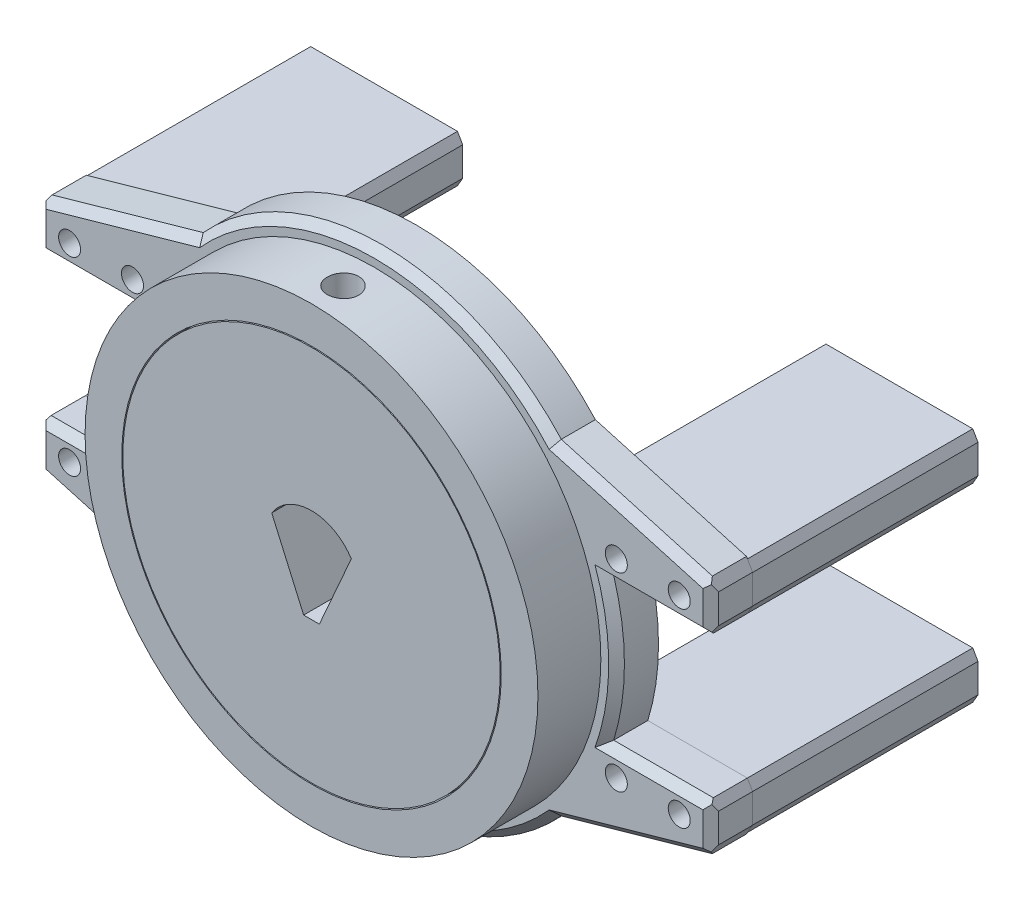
ISO-10303-21;
HEADER;
FILE_DESCRIPTION(('STEP AP214'),'2;1');
FILE_NAME('part.step','',(''),(''),'','','');
FILE_SCHEMA(('AUTOMOTIVE_DESIGN { 1 0 10303 214 1 1 1 1 }'));
ENDSEC;
DATA;
#1=APPLICATION_CONTEXT('core data for automotive mechanical design processes');
#2=APPLICATION_PROTOCOL_DEFINITION('international standard','automotive_design',2000,#1);
#3=PRODUCT_CONTEXT('',#1,'mechanical');
#4=PRODUCT('Part','Part','',(#3));
#5=PRODUCT_RELATED_PRODUCT_CATEGORY('part','',(#4));
#6=PRODUCT_DEFINITION_FORMATION('','',#4);
#7=PRODUCT_DEFINITION_CONTEXT('part definition',#1,'design');
#8=PRODUCT_DEFINITION('design','',#6,#7);
#9=PRODUCT_DEFINITION_SHAPE('','',#8);
#10=(LENGTH_UNIT() NAMED_UNIT(*) SI_UNIT(.MILLI.,.METRE.));
#11=(NAMED_UNIT(*) PLANE_ANGLE_UNIT() SI_UNIT($,.RADIAN.));
#12=(NAMED_UNIT(*) SI_UNIT($,.STERADIAN.) SOLID_ANGLE_UNIT());
#13=UNCERTAINTY_MEASURE_WITH_UNIT(LENGTH_MEASURE(1.E-05),#10,'distance_accuracy_value','');
#14=(GEOMETRIC_REPRESENTATION_CONTEXT(3) GLOBAL_UNCERTAINTY_ASSIGNED_CONTEXT((#13)) GLOBAL_UNIT_ASSIGNED_CONTEXT((#10,
#11,#12)) REPRESENTATION_CONTEXT('',''));
#15=CARTESIAN_POINT('',(0.,0.,0.));
#16=DIRECTION('',(0.,0.,1.));
#17=DIRECTION('',(1.,0.,0.));
#18=AXIS2_PLACEMENT_3D('',#15,#16,#17);
#19=CARTESIAN_POINT('',(-64.1529160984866,-20.8679491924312,-51.));
#20=DIRECTION('',(0.866025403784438,0.500000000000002,0.));
#21=DIRECTION('',(-0.500000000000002,0.866025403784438,0.));
#22=AXIS2_PLACEMENT_3D('',#19,#20,#21);
#23=PLANE('',#22);
#24=DIRECTION('',(-0.500000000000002,0.866025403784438,0.));
#25=VECTOR('',#24,1.);
#26=CARTESIAN_POINT('',(-64.1529160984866,-20.8679491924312,-8.));
#27=LINE('',#26,#25);
#28=CARTESIAN_POINT('',(-63.1529160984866,-22.6,-8.));
#29=VERTEX_POINT('',#28);
#30=CARTESIAN_POINT('',(-64.1529160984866,-20.8679491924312,-8.));
#31=VERTEX_POINT('',#30);
#32=EDGE_CURVE('E150',#29,#31,#27,.T.);
#33=ORIENTED_EDGE('',*,*,#32,.T.);
#34=DIRECTION('',(0.,0.,1.));
#35=VECTOR('',#34,1.);
#36=CARTESIAN_POINT('',(-64.1529160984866,-20.8679491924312,-51.));
#37=LINE('',#36,#35);
#38=CARTESIAN_POINT('',(-64.1529160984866,-20.8679491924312,-51.));
#39=VERTEX_POINT('',#38);
#40=EDGE_CURVE('E12',#39,#31,#37,.T.);
#41=ORIENTED_EDGE('',*,*,#40,.F.);
#42=DIRECTION('',(-0.500000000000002,0.866025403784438,0.));
#43=VECTOR('',#42,1.);
#44=CARTESIAN_POINT('',(-64.1529160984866,-20.8679491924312,-51.));
#45=LINE('',#44,#43);
#46=CARTESIAN_POINT('',(-63.1529160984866,-22.6,-51.));
#47=VERTEX_POINT('',#46);
#48=EDGE_CURVE('E165',#47,#39,#45,.T.);
#49=ORIENTED_EDGE('',*,*,#48,.F.);
#50=DIRECTION('',(0.,0.,1.));
#51=VECTOR('',#50,1.);
#52=CARTESIAN_POINT('',(-63.1529160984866,-22.6,-51.));
#53=LINE('',#52,#51);
#54=EDGE_CURVE('E146',#47,#29,#53,.T.);
#55=ORIENTED_EDGE('',*,*,#54,.T.);
#56=EDGE_LOOP('',(#33,#41,#49,#55));
#57=FACE_BOUND('',#56,.T.);
#58=ADVANCED_FACE('F54',(#57),#23,.F.);
#59=CARTESIAN_POINT('',(-64.1529160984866,-20.8679491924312,-51.));
#60=DIRECTION('',(1.,0.,0.));
#61=DIRECTION('',(0.,1.,0.));
#62=AXIS2_PLACEMENT_3D('',#59,#60,#61);
#63=PLANE('',#62);
#64=DIRECTION('',(0.,1.,0.));
#65=VECTOR('',#64,1.);
#66=CARTESIAN_POINT('',(-64.1529160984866,-20.8679491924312,-8.));
#67=LINE('',#66,#65);
#68=CARTESIAN_POINT('',(-64.1529160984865,-15.3320508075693,-8.));
#69=VERTEX_POINT('',#68);
#70=EDGE_CURVE('E153',#31,#69,#67,.T.);
#71=ORIENTED_EDGE('',*,*,#70,.T.);
#72=DIRECTION('',(0.,0.,1.));
#73=VECTOR('',#72,1.);
#74=CARTESIAN_POINT('',(-64.1529160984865,-15.3320508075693,-51.));
#75=LINE('',#74,#73);
#76=CARTESIAN_POINT('',(-64.1529160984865,-15.3320508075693,-51.));
#77=VERTEX_POINT('',#76);
#78=EDGE_CURVE('E62',#77,#69,#75,.T.);
#79=ORIENTED_EDGE('',*,*,#78,.F.);
#80=DIRECTION('',(0.,1.,0.));
#81=VECTOR('',#80,1.);
#82=CARTESIAN_POINT('',(-64.1529160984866,-20.8679491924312,-51.));
#83=LINE('',#82,#81);
#84=EDGE_CURVE('E113',#39,#77,#83,.T.);
#85=ORIENTED_EDGE('',*,*,#84,.F.);
#86=ORIENTED_EDGE('',*,*,#40,.T.);
#87=EDGE_LOOP('',(#71,#79,#85,#86));
#88=FACE_BOUND('',#87,.T.);
#89=ADVANCED_FACE('F230',(#88),#63,.F.);
#90=CARTESIAN_POINT('',(-64.1529160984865,-15.3320508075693,-51.));
#91=DIRECTION('',(0.866025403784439,-0.5,0.));
#92=DIRECTION('',(0.5,0.866025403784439,0.));
#93=AXIS2_PLACEMENT_3D('',#90,#91,#92);
#94=PLANE('',#93);
#95=DIRECTION('',(0.5,0.866025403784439,0.));
#96=VECTOR('',#95,1.);
#97=CARTESIAN_POINT('',(-64.1529160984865,-15.3320508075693,-8.));
#98=LINE('',#97,#96);
#99=CARTESIAN_POINT('',(-63.1529160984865,-13.6000000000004,-8.));
#100=VERTEX_POINT('',#99);
#101=EDGE_CURVE('E156',#69,#100,#98,.T.);
#102=ORIENTED_EDGE('',*,*,#101,.T.);
#103=DIRECTION('',(0.,0.,1.));
#104=VECTOR('',#103,1.);
#105=CARTESIAN_POINT('',(-63.1529160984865,-13.6000000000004,-51.));
#106=LINE('',#105,#104);
#107=CARTESIAN_POINT('',(-63.1529160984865,-13.6000000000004,-51.));
#108=VERTEX_POINT('',#107);
#109=EDGE_CURVE('E172',#108,#100,#106,.T.);
#110=ORIENTED_EDGE('',*,*,#109,.F.);
#111=DIRECTION('',(0.5,0.866025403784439,0.));
#112=VECTOR('',#111,1.);
#113=CARTESIAN_POINT('',(-64.1529160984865,-15.3320508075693,-51.));
#114=LINE('',#113,#112);
#115=EDGE_CURVE('E180',#77,#108,#114,.T.);
#116=ORIENTED_EDGE('',*,*,#115,.F.);
#117=ORIENTED_EDGE('',*,*,#78,.T.);
#118=EDGE_LOOP('',(#102,#110,#116,#117));
#119=FACE_BOUND('',#118,.T.);
#120=ADVANCED_FACE('F178',(#119),#94,.F.);
#121=CARTESIAN_POINT('',(-63.1529160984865,-13.6000000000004,-51.));
#122=DIRECTION('',(0.,-1.,0.));
#123=DIRECTION('',(1.,0.,0.));
#124=AXIS2_PLACEMENT_3D('',#121,#122,#123);
#125=PLANE('',#124);
#126=DIRECTION('',(1.,0.,0.));
#127=VECTOR('',#126,1.);
#128=CARTESIAN_POINT('',(-63.1529160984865,-13.6000000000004,-8.));
#129=LINE('',#128,#127);
#130=CARTESIAN_POINT('',(-35.1529160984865,-13.6000000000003,-8.));
#131=VERTEX_POINT('',#130);
#132=EDGE_CURVE('E158',#100,#131,#129,.T.);
#133=ORIENTED_EDGE('',*,*,#132,.T.);
#134=DIRECTION('',(0.,0.,1.));
#135=VECTOR('',#134,1.);
#136=CARTESIAN_POINT('',(-35.1529160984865,-13.6000000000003,-51.));
#137=LINE('',#136,#135);
#138=CARTESIAN_POINT('',(-35.1529160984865,-13.6000000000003,-51.));
#139=VERTEX_POINT('',#138);
#140=EDGE_CURVE('E169',#139,#131,#137,.T.);
#141=ORIENTED_EDGE('',*,*,#140,.F.);
#142=DIRECTION('',(1.,0.,0.));
#143=VECTOR('',#142,1.);
#144=CARTESIAN_POINT('',(-63.1529160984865,-13.6000000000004,-51.));
#145=LINE('',#144,#143);
#146=EDGE_CURVE('E192',#108,#139,#145,.T.);
#147=ORIENTED_EDGE('',*,*,#146,.F.);
#148=ORIENTED_EDGE('',*,*,#109,.T.);
#149=EDGE_LOOP('',(#133,#141,#147,#148));
#150=FACE_BOUND('',#149,.T.);
#151=ADVANCED_FACE('F188',(#150),#125,.F.);
#152=CARTESIAN_POINT('',(-35.1529160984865,-13.6000000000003,-51.));
#153=DIRECTION('',(-0.866025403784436,-0.500000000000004,0.));
#154=DIRECTION('',(0.500000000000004,-0.866025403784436,0.));
#155=AXIS2_PLACEMENT_3D('',#152,#153,#154);
#156=PLANE('',#155);
#157=DIRECTION('',(0.500000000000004,-0.866025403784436,0.));
#158=VECTOR('',#157,1.);
#159=CARTESIAN_POINT('',(-35.1529160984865,-13.6000000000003,-8.));
#160=LINE('',#159,#158);
#161=CARTESIAN_POINT('',(-34.1529160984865,-15.3320508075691,-8.));
#162=VERTEX_POINT('',#161);
#163=EDGE_CURVE('E160',#131,#162,#160,.T.);
#164=ORIENTED_EDGE('',*,*,#163,.T.);
#165=DIRECTION('',(0.,0.,1.));
#166=VECTOR('',#165,1.);
#167=CARTESIAN_POINT('',(-34.1529160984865,-15.3320508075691,-51.));
#168=LINE('',#167,#166);
#169=CARTESIAN_POINT('',(-34.1529160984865,-15.3320508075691,-51.));
#170=VERTEX_POINT('',#169);
#171=EDGE_CURVE('E141',#170,#162,#168,.T.);
#172=ORIENTED_EDGE('',*,*,#171,.F.);
#173=DIRECTION('',(0.500000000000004,-0.866025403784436,0.));
#174=VECTOR('',#173,1.);
#175=CARTESIAN_POINT('',(-35.1529160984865,-13.6000000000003,-51.));
#176=LINE('',#175,#174);
#177=EDGE_CURVE('E132',#139,#170,#176,.T.);
#178=ORIENTED_EDGE('',*,*,#177,.F.);
#179=ORIENTED_EDGE('',*,*,#140,.T.);
#180=EDGE_LOOP('',(#164,#172,#178,#179));
#181=FACE_BOUND('',#180,.T.);
#182=ADVANCED_FACE('F191',(#181),#156,.F.);
#183=CARTESIAN_POINT('',(-34.1529160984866,-20.8679491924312,-51.));
#184=DIRECTION('',(-1.,0.,0.));
#185=DIRECTION('',(0.,-1.,0.));
#186=AXIS2_PLACEMENT_3D('',#183,#184,#185);
#187=PLANE('',#186);
#188=DIRECTION('',(0.,-1.,0.));
#189=VECTOR('',#188,1.);
#190=CARTESIAN_POINT('',(-34.1529160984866,-20.8679491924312,-8.));
#191=LINE('',#190,#189);
#192=CARTESIAN_POINT('',(-34.1529160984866,-20.8679491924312,-8.));
#193=VERTEX_POINT('',#192);
#194=EDGE_CURVE('E140',#162,#193,#191,.T.);
#195=ORIENTED_EDGE('',*,*,#194,.T.);
#196=DIRECTION('',(0.,0.,1.));
#197=VECTOR('',#196,1.);
#198=CARTESIAN_POINT('',(-34.1529160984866,-20.8679491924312,-51.));
#199=LINE('',#198,#197);
#200=CARTESIAN_POINT('',(-34.1529160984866,-20.8679491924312,-51.));
#201=VERTEX_POINT('',#200);
#202=EDGE_CURVE('E137',#201,#193,#199,.T.);
#203=ORIENTED_EDGE('',*,*,#202,.F.);
#204=DIRECTION('',(0.,-1.,0.));
#205=VECTOR('',#204,1.);
#206=CARTESIAN_POINT('',(-34.1529160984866,-20.8679491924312,-51.));
#207=LINE('',#206,#205);
#208=EDGE_CURVE('E126',#170,#201,#207,.T.);
#209=ORIENTED_EDGE('',*,*,#208,.F.);
#210=ORIENTED_EDGE('',*,*,#171,.T.);
#211=EDGE_LOOP('',(#195,#203,#209,#210));
#212=FACE_BOUND('',#211,.T.);
#213=ADVANCED_FACE('F138',(#212),#187,.F.);
#214=CARTESIAN_POINT('',(-35.1529160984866,-22.6,-51.));
#215=DIRECTION('',(-0.866025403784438,0.500000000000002,0.));
#216=DIRECTION('',(-0.500000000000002,-0.866025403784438,0.));
#217=AXIS2_PLACEMENT_3D('',#214,#215,#216);
#218=PLANE('',#217);
#219=DIRECTION('',(-0.500000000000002,-0.866025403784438,0.));
#220=VECTOR('',#219,1.);
#221=CARTESIAN_POINT('',(-35.1529160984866,-22.6,-8.));
#222=LINE('',#221,#220);
#223=CARTESIAN_POINT('',(-35.1529160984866,-22.6,-8.));
#224=VERTEX_POINT('',#223);
#225=EDGE_CURVE('E99',#193,#224,#222,.T.);
#226=ORIENTED_EDGE('',*,*,#225,.T.);
#227=DIRECTION('',(0.,0.,1.));
#228=VECTOR('',#227,1.);
#229=CARTESIAN_POINT('',(-35.1529160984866,-22.6,-51.));
#230=LINE('',#229,#228);
#231=CARTESIAN_POINT('',(-35.1529160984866,-22.6,-51.));
#232=VERTEX_POINT('',#231);
#233=EDGE_CURVE('E142',#232,#224,#230,.T.);
#234=ORIENTED_EDGE('',*,*,#233,.F.);
#235=DIRECTION('',(-0.500000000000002,-0.866025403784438,0.));
#236=VECTOR('',#235,1.);
#237=CARTESIAN_POINT('',(-35.1529160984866,-22.6,-51.));
#238=LINE('',#237,#236);
#239=EDGE_CURVE('E130',#201,#232,#238,.T.);
#240=ORIENTED_EDGE('',*,*,#239,.F.);
#241=ORIENTED_EDGE('',*,*,#202,.T.);
#242=EDGE_LOOP('',(#226,#234,#240,#241));
#243=FACE_BOUND('',#242,.T.);
#244=ADVANCED_FACE('F144',(#243),#218,.F.);
#245=CARTESIAN_POINT('',(-63.1529160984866,-22.6,-51.));
#246=DIRECTION('',(0.,1.,0.));
#247=DIRECTION('',(-1.,0.,0.));
#248=AXIS2_PLACEMENT_3D('',#245,#246,#247);
#249=PLANE('',#248);
#250=DIRECTION('',(-1.,0.,0.));
#251=VECTOR('',#250,1.);
#252=CARTESIAN_POINT('',(-63.1529160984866,-22.6,-8.));
#253=LINE('',#252,#251);
#254=EDGE_CURVE('E105',#224,#29,#253,.T.);
#255=ORIENTED_EDGE('',*,*,#254,.T.);
#256=ORIENTED_EDGE('',*,*,#54,.F.);
#257=DIRECTION('',(-1.,0.,0.));
#258=VECTOR('',#257,1.);
#259=CARTESIAN_POINT('',(-63.1529160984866,-22.6,-51.));
#260=LINE('',#259,#258);
#261=EDGE_CURVE('E70',#232,#47,#260,.T.);
#262=ORIENTED_EDGE('',*,*,#261,.F.);
#263=ORIENTED_EDGE('',*,*,#233,.T.);
#264=EDGE_LOOP('',(#255,#256,#262,#263));
#265=FACE_BOUND('',#264,.T.);
#266=ADVANCED_FACE('F237',(#265),#249,.F.);
#267=CARTESIAN_POINT('',(0.,0.,-51.));
#268=DIRECTION('',(0.,0.,1.));
#269=DIRECTION('',(1.,0.,0.));
#270=AXIS2_PLACEMENT_3D('',#267,#268,#269);
#271=PLANE('',#270);
#272=ORIENTED_EDGE('',*,*,#48,.T.);
#273=ORIENTED_EDGE('',*,*,#84,.T.);
#274=ORIENTED_EDGE('',*,*,#115,.T.);
#275=ORIENTED_EDGE('',*,*,#146,.T.);
#276=ORIENTED_EDGE('',*,*,#177,.T.);
#277=ORIENTED_EDGE('',*,*,#208,.T.);
#278=ORIENTED_EDGE('',*,*,#239,.T.);
#279=ORIENTED_EDGE('',*,*,#261,.T.);
#280=EDGE_LOOP('',(#272,#273,#274,#275,#276,#277,#278,#279));
#281=FACE_BOUND('',#280,.T.);
#282=ADVANCED_FACE('F128',(#281),#271,.F.);
#283=CARTESIAN_POINT('',(0.,0.,-8.));
#284=DIRECTION('',(0.,0.,1.));
#285=DIRECTION('',(1.,0.,0.));
#286=AXIS2_PLACEMENT_3D('',#283,#284,#285);
#287=PLANE('',#286);
#288=CARTESIAN_POINT('',(-58.1529160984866,-18.1000000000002,-8.));
#289=DIRECTION('',(0.,0.,1.));
#290=DIRECTION('',(1.,0.,0.));
#291=AXIS2_PLACEMENT_3D('',#288,#289,#290);
#292=CIRCLE('',#291,1.65);
#293=CARTESIAN_POINT('',(-56.5029160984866,-18.1000000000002,-8.));
#294=VERTEX_POINT('',#293);
#295=EDGE_CURVE('E154',#294,#294,#292,.T.);
#296=ORIENTED_EDGE('',*,*,#295,.F.);
#297=EDGE_LOOP('',(#296));
#298=FACE_BOUND('',#297,.T.);
#299=CARTESIAN_POINT('',(-46.1529160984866,-18.1000000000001,-8.));
#300=DIRECTION('',(0.,0.,1.));
#301=DIRECTION('',(1.,0.,0.));
#302=AXIS2_PLACEMENT_3D('',#299,#300,#301);
#303=CIRCLE('',#302,1.65);
#304=CARTESIAN_POINT('',(-44.5029160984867,-18.1000000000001,-8.));
#305=VERTEX_POINT('',#304);
#306=EDGE_CURVE('E201',#305,#305,#303,.T.);
#307=ORIENTED_EDGE('',*,*,#306,.F.);
#308=EDGE_LOOP('',(#307));
#309=FACE_BOUND('',#308,.T.);
#310=ORIENTED_EDGE('',*,*,#32,.F.);
#311=ORIENTED_EDGE('',*,*,#254,.F.);
#312=ORIENTED_EDGE('',*,*,#225,.F.);
#313=ORIENTED_EDGE('',*,*,#194,.F.);
#314=ORIENTED_EDGE('',*,*,#163,.F.);
#315=ORIENTED_EDGE('',*,*,#132,.F.);
#316=ORIENTED_EDGE('',*,*,#101,.F.);
#317=ORIENTED_EDGE('',*,*,#70,.F.);
#318=EDGE_LOOP('',(#310,#311,#312,#313,#314,#315,#316,#317));
#319=FACE_BOUND('',#318,.T.);
#320=ADVANCED_FACE('F184',(#298,#309,#319),#287,.T.);
#321=CARTESIAN_POINT('',(-46.1529160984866,-18.1000000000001,-33.));
#322=DIRECTION('',(0.,0.,1.));
#323=DIRECTION('',(1.,0.,0.));
#324=AXIS2_PLACEMENT_3D('',#321,#322,#323);
#325=CYLINDRICAL_SURFACE('',#324,1.65);
#326=CARTESIAN_POINT('',(-46.1529160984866,-18.1000000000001,-33.));
#327=DIRECTION('',(0.,0.,1.));
#328=DIRECTION('',(1.,0.,0.));
#329=AXIS2_PLACEMENT_3D('',#326,#327,#328);
#330=CIRCLE('',#329,1.65);
#331=CARTESIAN_POINT('',(-44.5029160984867,-18.1000000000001,-33.));
#332=VERTEX_POINT('',#331);
#333=EDGE_CURVE('E198',#332,#332,#330,.T.);
#334=ORIENTED_EDGE('',*,*,#333,.F.);
#335=EDGE_LOOP('',(#334));
#336=FACE_BOUND('',#335,.T.);
#337=ORIENTED_EDGE('',*,*,#306,.T.);
#338=EDGE_LOOP('',(#337));
#339=FACE_BOUND('',#338,.T.);
#340=ADVANCED_FACE('F214',(#336,#339),#325,.F.);
#341=CARTESIAN_POINT('',(-46.1529160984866,-18.1000000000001,-33.));
#342=DIRECTION('',(0.,0.,1.));
#343=DIRECTION('',(1.,0.,0.));
#344=AXIS2_PLACEMENT_3D('',#341,#342,#343);
#345=PLANE('',#344);
#346=ORIENTED_EDGE('',*,*,#333,.T.);
#347=EDGE_LOOP('',(#346));
#348=FACE_BOUND('',#347,.T.);
#349=ADVANCED_FACE('F219',(#348),#345,.T.);
#350=CARTESIAN_POINT('',(-58.1529160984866,-18.1000000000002,-33.));
#351=DIRECTION('',(0.,0.,1.));
#352=DIRECTION('',(1.,0.,0.));
#353=AXIS2_PLACEMENT_3D('',#350,#351,#352);
#354=CYLINDRICAL_SURFACE('',#353,1.65);
#355=CARTESIAN_POINT('',(-58.1529160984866,-18.1000000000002,-33.));
#356=DIRECTION('',(0.,0.,1.));
#357=DIRECTION('',(1.,0.,0.));
#358=AXIS2_PLACEMENT_3D('',#355,#356,#357);
#359=CIRCLE('',#358,1.65);
#360=CARTESIAN_POINT('',(-56.5029160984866,-18.1000000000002,-33.));
#361=VERTEX_POINT('',#360);
#362=EDGE_CURVE('E204',#361,#361,#359,.T.);
#363=ORIENTED_EDGE('',*,*,#362,.F.);
#364=EDGE_LOOP('',(#363));
#365=FACE_BOUND('',#364,.T.);
#366=ORIENTED_EDGE('',*,*,#295,.T.);
#367=EDGE_LOOP('',(#366));
#368=FACE_BOUND('',#367,.T.);
#369=ADVANCED_FACE('F210',(#365,#368),#354,.F.);
#370=CARTESIAN_POINT('',(-58.1529160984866,-18.1000000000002,-33.));
#371=DIRECTION('',(0.,0.,1.));
#372=DIRECTION('',(1.,0.,0.));
#373=AXIS2_PLACEMENT_3D('',#370,#371,#372);
#374=PLANE('',#373);
#375=ORIENTED_EDGE('',*,*,#362,.T.);
#376=EDGE_LOOP('',(#375));
#377=FACE_BOUND('',#376,.T.);
#378=ADVANCED_FACE('F309',(#377),#374,.T.);
#379=CLOSED_SHELL('',(#58,#89,#120,#151,#182,#213,#244,#266,#282,#320,#340,#349,#369,#378));
#380=MANIFOLD_SOLID_BREP('B2',#379);
#381=CARTESIAN_POINT('',(64.1529160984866,-20.8679491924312,-51.));
#382=DIRECTION('',(-1.,0.,0.));
#383=DIRECTION('',(0.,-1.,0.));
#384=AXIS2_PLACEMENT_3D('',#381,#382,#383);
#385=PLANE('',#384);
#386=DIRECTION('',(0.,-1.,0.));
#387=VECTOR('',#386,1.);
#388=CARTESIAN_POINT('',(64.1529160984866,-20.8679491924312,-8.));
#389=LINE('',#388,#387);
#390=CARTESIAN_POINT('',(64.1529160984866,-15.3320508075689,-8.));
#391=VERTEX_POINT('',#390);
#392=CARTESIAN_POINT('',(64.1529160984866,-20.8679491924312,-8.));
#393=VERTEX_POINT('',#392);
#394=EDGE_CURVE('E448',#391,#393,#389,.T.);
#395=ORIENTED_EDGE('',*,*,#394,.T.);
#396=DIRECTION('',(0.,0.,1.));
#397=VECTOR('',#396,1.);
#398=CARTESIAN_POINT('',(64.1529160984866,-20.8679491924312,-51.));
#399=LINE('',#398,#397);
#400=CARTESIAN_POINT('',(64.1529160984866,-20.8679491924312,-51.));
#401=VERTEX_POINT('',#400);
#402=EDGE_CURVE('E52',#401,#393,#399,.T.);
#403=ORIENTED_EDGE('',*,*,#402,.F.);
#404=DIRECTION('',(0.,-1.,0.));
#405=VECTOR('',#404,1.);
#406=CARTESIAN_POINT('',(64.1529160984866,-20.8679491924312,-51.));
#407=LINE('',#406,#405);
#408=CARTESIAN_POINT('',(64.1529160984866,-15.3320508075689,-51.));
#409=VERTEX_POINT('',#408);
#410=EDGE_CURVE('E463',#409,#401,#407,.T.);
#411=ORIENTED_EDGE('',*,*,#410,.F.);
#412=DIRECTION('',(0.,0.,1.));
#413=VECTOR('',#412,1.);
#414=CARTESIAN_POINT('',(64.1529160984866,-15.3320508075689,-51.));
#415=LINE('',#414,#413);
#416=EDGE_CURVE('E444',#409,#391,#415,.T.);
#417=ORIENTED_EDGE('',*,*,#416,.T.);
#418=EDGE_LOOP('',(#395,#403,#411,#417));
#419=FACE_BOUND('',#418,.T.);
#420=ADVANCED_FACE('F352',(#419),#385,.F.);
#421=CARTESIAN_POINT('',(64.1529160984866,-20.8679491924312,-51.));
#422=DIRECTION('',(-0.866025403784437,0.500000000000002,0.));
#423=DIRECTION('',(-0.500000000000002,-0.866025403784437,0.));
#424=AXIS2_PLACEMENT_3D('',#421,#422,#423);
#425=PLANE('',#424);
#426=DIRECTION('',(-0.500000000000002,-0.866025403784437,0.));
#427=VECTOR('',#426,1.);
#428=CARTESIAN_POINT('',(64.1529160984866,-20.8679491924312,-8.));
#429=LINE('',#428,#427);
#430=CARTESIAN_POINT('',(63.1529160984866,-22.6000000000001,-8.));
#431=VERTEX_POINT('',#430);
#432=EDGE_CURVE('E451',#393,#431,#429,.T.);
#433=ORIENTED_EDGE('',*,*,#432,.T.);
#434=DIRECTION('',(0.,0.,1.));
#435=VECTOR('',#434,1.);
#436=CARTESIAN_POINT('',(63.1529160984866,-22.6000000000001,-51.));
#437=LINE('',#436,#435);
#438=CARTESIAN_POINT('',(63.1529160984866,-22.6000000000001,-51.));
#439=VERTEX_POINT('',#438);
#440=EDGE_CURVE('E360',#439,#431,#437,.T.);
#441=ORIENTED_EDGE('',*,*,#440,.F.);
#442=DIRECTION('',(-0.500000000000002,-0.866025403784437,0.));
#443=VECTOR('',#442,1.);
#444=CARTESIAN_POINT('',(64.1529160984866,-20.8679491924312,-51.));
#445=LINE('',#444,#443);
#446=EDGE_CURVE('E411',#401,#439,#445,.T.);
#447=ORIENTED_EDGE('',*,*,#446,.F.);
#448=ORIENTED_EDGE('',*,*,#402,.T.);
#449=EDGE_LOOP('',(#433,#441,#447,#448));
#450=FACE_BOUND('',#449,.T.);
#451=ADVANCED_FACE('F528',(#450),#425,.F.);
#452=CARTESIAN_POINT('',(63.1529160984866,-22.6000000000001,-51.));
#453=DIRECTION('',(0.,1.,0.));
#454=DIRECTION('',(-1.,0.,0.));
#455=AXIS2_PLACEMENT_3D('',#452,#453,#454);
#456=PLANE('',#455);
#457=DIRECTION('',(-1.,0.,0.));
#458=VECTOR('',#457,1.);
#459=CARTESIAN_POINT('',(63.1529160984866,-22.6000000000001,-8.));
#460=LINE('',#459,#458);
#461=CARTESIAN_POINT('',(35.1529160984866,-22.6,-8.));
#462=VERTEX_POINT('',#461);
#463=EDGE_CURVE('E454',#431,#462,#460,.T.);
#464=ORIENTED_EDGE('',*,*,#463,.T.);
#465=DIRECTION('',(0.,0.,1.));
#466=VECTOR('',#465,1.);
#467=CARTESIAN_POINT('',(35.1529160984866,-22.6,-51.));
#468=LINE('',#467,#466);
#469=CARTESIAN_POINT('',(35.1529160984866,-22.6,-51.));
#470=VERTEX_POINT('',#469);
#471=EDGE_CURVE('E470',#470,#462,#468,.T.);
#472=ORIENTED_EDGE('',*,*,#471,.F.);
#473=DIRECTION('',(-1.,0.,0.));
#474=VECTOR('',#473,1.);
#475=CARTESIAN_POINT('',(63.1529160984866,-22.6000000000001,-51.));
#476=LINE('',#475,#474);
#477=EDGE_CURVE('E478',#439,#470,#476,.T.);
#478=ORIENTED_EDGE('',*,*,#477,.F.);
#479=ORIENTED_EDGE('',*,*,#440,.T.);
#480=EDGE_LOOP('',(#464,#472,#478,#479));
#481=FACE_BOUND('',#480,.T.);
#482=ADVANCED_FACE('F476',(#481),#456,.F.);
#483=CARTESIAN_POINT('',(35.1529160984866,-22.6,-51.));
#484=DIRECTION('',(0.866025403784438,0.500000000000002,0.));
#485=DIRECTION('',(-0.500000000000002,0.866025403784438,0.));
#486=AXIS2_PLACEMENT_3D('',#483,#484,#485);
#487=PLANE('',#486);
#488=DIRECTION('',(-0.500000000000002,0.866025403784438,0.));
#489=VECTOR('',#488,1.);
#490=CARTESIAN_POINT('',(35.1529160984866,-22.6,-8.));
#491=LINE('',#490,#489);
#492=CARTESIAN_POINT('',(34.1529160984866,-20.8679491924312,-8.));
#493=VERTEX_POINT('',#492);
#494=EDGE_CURVE('E456',#462,#493,#491,.T.);
#495=ORIENTED_EDGE('',*,*,#494,.T.);
#496=DIRECTION('',(0.,0.,1.));
#497=VECTOR('',#496,1.);
#498=CARTESIAN_POINT('',(34.1529160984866,-20.8679491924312,-51.));
#499=LINE('',#498,#497);
#500=CARTESIAN_POINT('',(34.1529160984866,-20.8679491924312,-51.));
#501=VERTEX_POINT('',#500);
#502=EDGE_CURVE('E467',#501,#493,#499,.T.);
#503=ORIENTED_EDGE('',*,*,#502,.F.);
#504=DIRECTION('',(-0.500000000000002,0.866025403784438,0.));
#505=VECTOR('',#504,1.);
#506=CARTESIAN_POINT('',(35.1529160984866,-22.6,-51.));
#507=LINE('',#506,#505);
#508=EDGE_CURVE('E490',#470,#501,#507,.T.);
#509=ORIENTED_EDGE('',*,*,#508,.F.);
#510=ORIENTED_EDGE('',*,*,#471,.T.);
#511=EDGE_LOOP('',(#495,#503,#509,#510));
#512=FACE_BOUND('',#511,.T.);
#513=ADVANCED_FACE('F486',(#512),#487,.F.);
#514=CARTESIAN_POINT('',(34.1529160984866,-20.8679491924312,-51.));
#515=DIRECTION('',(1.,0.,0.));
#516=DIRECTION('',(0.,1.,0.));
#517=AXIS2_PLACEMENT_3D('',#514,#515,#516);
#518=PLANE('',#517);
#519=DIRECTION('',(0.,1.,0.));
#520=VECTOR('',#519,1.);
#521=CARTESIAN_POINT('',(34.1529160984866,-20.8679491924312,-8.));
#522=LINE('',#521,#520);
#523=CARTESIAN_POINT('',(34.1529160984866,-15.3320508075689,-8.));
#524=VERTEX_POINT('',#523);
#525=EDGE_CURVE('E458',#493,#524,#522,.T.);
#526=ORIENTED_EDGE('',*,*,#525,.T.);
#527=DIRECTION('',(0.,0.,1.));
#528=VECTOR('',#527,1.);
#529=CARTESIAN_POINT('',(34.1529160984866,-15.3320508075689,-51.));
#530=LINE('',#529,#528);
#531=CARTESIAN_POINT('',(34.1529160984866,-15.3320508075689,-51.));
#532=VERTEX_POINT('',#531);
#533=EDGE_CURVE('E439',#532,#524,#530,.T.);
#534=ORIENTED_EDGE('',*,*,#533,.F.);
#535=DIRECTION('',(0.,1.,0.));
#536=VECTOR('',#535,1.);
#537=CARTESIAN_POINT('',(34.1529160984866,-20.8679491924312,-51.));
#538=LINE('',#537,#536);
#539=EDGE_CURVE('E430',#501,#532,#538,.T.);
#540=ORIENTED_EDGE('',*,*,#539,.F.);
#541=ORIENTED_EDGE('',*,*,#502,.T.);
#542=EDGE_LOOP('',(#526,#534,#540,#541));
#543=FACE_BOUND('',#542,.T.);
#544=ADVANCED_FACE('F489',(#543),#518,.F.);
#545=CARTESIAN_POINT('',(35.1529160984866,-13.6,-51.));
#546=DIRECTION('',(0.866025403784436,-0.500000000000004,0.));
#547=DIRECTION('',(0.500000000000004,0.866025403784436,0.));
#548=AXIS2_PLACEMENT_3D('',#545,#546,#547);
#549=PLANE('',#548);
#550=DIRECTION('',(0.500000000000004,0.866025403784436,0.));
#551=VECTOR('',#550,1.);
#552=CARTESIAN_POINT('',(35.1529160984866,-13.6,-8.));
#553=LINE('',#552,#551);
#554=CARTESIAN_POINT('',(35.1529160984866,-13.6,-8.));
#555=VERTEX_POINT('',#554);
#556=EDGE_CURVE('E438',#524,#555,#553,.T.);
#557=ORIENTED_EDGE('',*,*,#556,.T.);
#558=DIRECTION('',(0.,0.,1.));
#559=VECTOR('',#558,1.);
#560=CARTESIAN_POINT('',(35.1529160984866,-13.6,-51.));
#561=LINE('',#560,#559);
#562=CARTESIAN_POINT('',(35.1529160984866,-13.6,-51.));
#563=VERTEX_POINT('',#562);
#564=EDGE_CURVE('E435',#563,#555,#561,.T.);
#565=ORIENTED_EDGE('',*,*,#564,.F.);
#566=DIRECTION('',(0.500000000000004,0.866025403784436,0.));
#567=VECTOR('',#566,1.);
#568=CARTESIAN_POINT('',(35.1529160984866,-13.6,-51.));
#569=LINE('',#568,#567);
#570=EDGE_CURVE('E424',#532,#563,#569,.T.);
#571=ORIENTED_EDGE('',*,*,#570,.F.);
#572=ORIENTED_EDGE('',*,*,#533,.T.);
#573=EDGE_LOOP('',(#557,#565,#571,#572));
#574=FACE_BOUND('',#573,.T.);
#575=ADVANCED_FACE('F436',(#574),#549,.F.);
#576=CARTESIAN_POINT('',(63.1529160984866,-13.6,-51.));
#577=DIRECTION('',(0.,-1.,0.));
#578=DIRECTION('',(1.,0.,0.));
#579=AXIS2_PLACEMENT_3D('',#576,#577,#578);
#580=PLANE('',#579);
#581=DIRECTION('',(1.,0.,0.));
#582=VECTOR('',#581,1.);
#583=CARTESIAN_POINT('',(63.1529160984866,-13.6,-8.));
#584=LINE('',#583,#582);
#585=CARTESIAN_POINT('',(63.1529160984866,-13.6,-8.));
#586=VERTEX_POINT('',#585);
#587=EDGE_CURVE('E397',#555,#586,#584,.T.);
#588=ORIENTED_EDGE('',*,*,#587,.T.);
#589=DIRECTION('',(0.,0.,1.));
#590=VECTOR('',#589,1.);
#591=CARTESIAN_POINT('',(63.1529160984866,-13.6,-51.));
#592=LINE('',#591,#590);
#593=CARTESIAN_POINT('',(63.1529160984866,-13.6,-51.));
#594=VERTEX_POINT('',#593);
#595=EDGE_CURVE('E440',#594,#586,#592,.T.);
#596=ORIENTED_EDGE('',*,*,#595,.F.);
#597=DIRECTION('',(1.,0.,0.));
#598=VECTOR('',#597,1.);
#599=CARTESIAN_POINT('',(63.1529160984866,-13.6,-51.));
#600=LINE('',#599,#598);
#601=EDGE_CURVE('E428',#563,#594,#600,.T.);
#602=ORIENTED_EDGE('',*,*,#601,.F.);
#603=ORIENTED_EDGE('',*,*,#564,.T.);
#604=EDGE_LOOP('',(#588,#596,#602,#603));
#605=FACE_BOUND('',#604,.T.);
#606=ADVANCED_FACE('F442',(#605),#580,.F.);
#607=CARTESIAN_POINT('',(64.1529160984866,-15.3320508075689,-51.));
#608=DIRECTION('',(-0.866025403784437,-0.500000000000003,0.));
#609=DIRECTION('',(0.500000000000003,-0.866025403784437,0.));
#610=AXIS2_PLACEMENT_3D('',#607,#608,#609);
#611=PLANE('',#610);
#612=DIRECTION('',(0.500000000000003,-0.866025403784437,0.));
#613=VECTOR('',#612,1.);
#614=CARTESIAN_POINT('',(64.1529160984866,-15.3320508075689,-8.));
#615=LINE('',#614,#613);
#616=EDGE_CURVE('E403',#586,#391,#615,.T.);
#617=ORIENTED_EDGE('',*,*,#616,.T.);
#618=ORIENTED_EDGE('',*,*,#416,.F.);
#619=DIRECTION('',(0.500000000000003,-0.866025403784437,0.));
#620=VECTOR('',#619,1.);
#621=CARTESIAN_POINT('',(64.1529160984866,-15.3320508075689,-51.));
#622=LINE('',#621,#620);
#623=EDGE_CURVE('E368',#594,#409,#622,.T.);
#624=ORIENTED_EDGE('',*,*,#623,.F.);
#625=ORIENTED_EDGE('',*,*,#595,.T.);
#626=EDGE_LOOP('',(#617,#618,#624,#625));
#627=FACE_BOUND('',#626,.T.);
#628=ADVANCED_FACE('F535',(#627),#611,.F.);
#629=CARTESIAN_POINT('',(0.,0.,-51.));
#630=DIRECTION('',(0.,0.,1.));
#631=DIRECTION('',(1.,0.,0.));
#632=AXIS2_PLACEMENT_3D('',#629,#630,#631);
#633=PLANE('',#632);
#634=ORIENTED_EDGE('',*,*,#410,.T.);
#635=ORIENTED_EDGE('',*,*,#446,.T.);
#636=ORIENTED_EDGE('',*,*,#477,.T.);
#637=ORIENTED_EDGE('',*,*,#508,.T.);
#638=ORIENTED_EDGE('',*,*,#539,.T.);
#639=ORIENTED_EDGE('',*,*,#570,.T.);
#640=ORIENTED_EDGE('',*,*,#601,.T.);
#641=ORIENTED_EDGE('',*,*,#623,.T.);
#642=EDGE_LOOP('',(#634,#635,#636,#637,#638,#639,#640,#641));
#643=FACE_BOUND('',#642,.T.);
#644=ADVANCED_FACE('F426',(#643),#633,.F.);
#645=CARTESIAN_POINT('',(0.,0.,-8.));
#646=DIRECTION('',(0.,0.,1.));
#647=DIRECTION('',(1.,0.,0.));
#648=AXIS2_PLACEMENT_3D('',#645,#646,#647);
#649=PLANE('',#648);
#650=CARTESIAN_POINT('',(58.1529160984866,-18.1000000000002,-8.));
#651=DIRECTION('',(0.,0.,1.));
#652=DIRECTION('',(1.,0.,0.));
#653=AXIS2_PLACEMENT_3D('',#650,#651,#652);
#654=CIRCLE('',#653,1.65);
#655=CARTESIAN_POINT('',(59.8029160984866,-18.1000000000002,-8.));
#656=VERTEX_POINT('',#655);
#657=EDGE_CURVE('E452',#656,#656,#654,.T.);
#658=ORIENTED_EDGE('',*,*,#657,.F.);
#659=EDGE_LOOP('',(#658));
#660=FACE_BOUND('',#659,.T.);
#661=CARTESIAN_POINT('',(46.1529160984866,-18.1000000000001,-8.));
#662=DIRECTION('',(0.,0.,1.));
#663=DIRECTION('',(1.,0.,0.));
#664=AXIS2_PLACEMENT_3D('',#661,#662,#663);
#665=CIRCLE('',#664,1.65);
#666=CARTESIAN_POINT('',(47.8029160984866,-18.1000000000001,-8.));
#667=VERTEX_POINT('',#666);
#668=EDGE_CURVE('E499',#667,#667,#665,.T.);
#669=ORIENTED_EDGE('',*,*,#668,.F.);
#670=EDGE_LOOP('',(#669));
#671=FACE_BOUND('',#670,.T.);
#672=ORIENTED_EDGE('',*,*,#394,.F.);
#673=ORIENTED_EDGE('',*,*,#616,.F.);
#674=ORIENTED_EDGE('',*,*,#587,.F.);
#675=ORIENTED_EDGE('',*,*,#556,.F.);
#676=ORIENTED_EDGE('',*,*,#525,.F.);
#677=ORIENTED_EDGE('',*,*,#494,.F.);
#678=ORIENTED_EDGE('',*,*,#463,.F.);
#679=ORIENTED_EDGE('',*,*,#432,.F.);
#680=EDGE_LOOP('',(#672,#673,#674,#675,#676,#677,#678,#679));
#681=FACE_BOUND('',#680,.T.);
#682=ADVANCED_FACE('F482',(#660,#671,#681),#649,.T.);
#683=CARTESIAN_POINT('',(46.1529160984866,-18.1000000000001,-33.));
#684=DIRECTION('',(0.,0.,1.));
#685=DIRECTION('',(1.,0.,0.));
#686=AXIS2_PLACEMENT_3D('',#683,#684,#685);
#687=CYLINDRICAL_SURFACE('',#686,1.65);
#688=CARTESIAN_POINT('',(46.1529160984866,-18.1000000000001,-33.));
#689=DIRECTION('',(0.,0.,1.));
#690=DIRECTION('',(1.,0.,0.));
#691=AXIS2_PLACEMENT_3D('',#688,#689,#690);
#692=CIRCLE('',#691,1.65);
#693=CARTESIAN_POINT('',(47.8029160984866,-18.1000000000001,-33.));
#694=VERTEX_POINT('',#693);
#695=EDGE_CURVE('E496',#694,#694,#692,.T.);
#696=ORIENTED_EDGE('',*,*,#695,.F.);
#697=EDGE_LOOP('',(#696));
#698=FACE_BOUND('',#697,.T.);
#699=ORIENTED_EDGE('',*,*,#668,.T.);
#700=EDGE_LOOP('',(#699));
#701=FACE_BOUND('',#700,.T.);
#702=ADVANCED_FACE('F512',(#698,#701),#687,.F.);
#703=CARTESIAN_POINT('',(46.1529160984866,-18.1000000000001,-33.));
#704=DIRECTION('',(0.,0.,1.));
#705=DIRECTION('',(1.,0.,0.));
#706=AXIS2_PLACEMENT_3D('',#703,#704,#705);
#707=PLANE('',#706);
#708=ORIENTED_EDGE('',*,*,#695,.T.);
#709=EDGE_LOOP('',(#708));
#710=FACE_BOUND('',#709,.T.);
#711=ADVANCED_FACE('F517',(#710),#707,.T.);
#712=CARTESIAN_POINT('',(58.1529160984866,-18.1000000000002,-33.));
#713=DIRECTION('',(0.,0.,1.));
#714=DIRECTION('',(1.,0.,0.));
#715=AXIS2_PLACEMENT_3D('',#712,#713,#714);
#716=CYLINDRICAL_SURFACE('',#715,1.65);
#717=CARTESIAN_POINT('',(58.1529160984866,-18.1000000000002,-33.));
#718=DIRECTION('',(0.,0.,1.));
#719=DIRECTION('',(1.,0.,0.));
#720=AXIS2_PLACEMENT_3D('',#717,#718,#719);
#721=CIRCLE('',#720,1.65);
#722=CARTESIAN_POINT('',(59.8029160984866,-18.1000000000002,-33.));
#723=VERTEX_POINT('',#722);
#724=EDGE_CURVE('E502',#723,#723,#721,.T.);
#725=ORIENTED_EDGE('',*,*,#724,.F.);
#726=EDGE_LOOP('',(#725));
#727=FACE_BOUND('',#726,.T.);
#728=ORIENTED_EDGE('',*,*,#657,.T.);
#729=EDGE_LOOP('',(#728));
#730=FACE_BOUND('',#729,.T.);
#731=ADVANCED_FACE('F508',(#727,#730),#716,.F.);
#732=CARTESIAN_POINT('',(58.1529160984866,-18.1000000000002,-33.));
#733=DIRECTION('',(0.,0.,1.));
#734=DIRECTION('',(1.,0.,0.));
#735=AXIS2_PLACEMENT_3D('',#732,#733,#734);
#736=PLANE('',#735);
#737=ORIENTED_EDGE('',*,*,#724,.T.);
#738=EDGE_LOOP('',(#737));
#739=FACE_BOUND('',#738,.T.);
#740=ADVANCED_FACE('F607',(#739),#736,.T.);
#741=CLOSED_SHELL('',(#420,#451,#482,#513,#544,#575,#606,#628,#644,#682,#702,#711,#731,#740));
#742=MANIFOLD_SOLID_BREP('B6',#741);
#743=CARTESIAN_POINT('',(-63.1529160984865,13.6000000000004,-51.));
#744=DIRECTION('',(0.,1.,0.));
#745=DIRECTION('',(-1.,0.,0.));
#746=AXIS2_PLACEMENT_3D('',#743,#744,#745);
#747=PLANE('',#746);
#748=DIRECTION('',(-1.,0.,0.));
#749=VECTOR('',#748,1.);
#750=CARTESIAN_POINT('',(-63.1529160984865,13.6000000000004,-8.));
#751=LINE('',#750,#749);
#752=CARTESIAN_POINT('',(-35.1529160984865,13.6000000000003,-8.));
#753=VERTEX_POINT('',#752);
#754=CARTESIAN_POINT('',(-63.1529160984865,13.6000000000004,-8.));
#755=VERTEX_POINT('',#754);
#756=EDGE_CURVE('E746',#753,#755,#751,.T.);
#757=ORIENTED_EDGE('',*,*,#756,.T.);
#758=DIRECTION('',(0.,0.,1.));
#759=VECTOR('',#758,1.);
#760=CARTESIAN_POINT('',(-63.1529160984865,13.6000000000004,-51.));
#761=LINE('',#760,#759);
#762=CARTESIAN_POINT('',(-63.1529160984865,13.6000000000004,-51.));
#763=VERTEX_POINT('',#762);
#764=EDGE_CURVE('E350',#763,#755,#761,.T.);
#765=ORIENTED_EDGE('',*,*,#764,.F.);
#766=DIRECTION('',(-1.,0.,0.));
#767=VECTOR('',#766,1.);
#768=CARTESIAN_POINT('',(-63.1529160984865,13.6000000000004,-51.));
#769=LINE('',#768,#767);
#770=CARTESIAN_POINT('',(-35.1529160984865,13.6000000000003,-51.));
#771=VERTEX_POINT('',#770);
#772=EDGE_CURVE('E761',#771,#763,#769,.T.);
#773=ORIENTED_EDGE('',*,*,#772,.F.);
#774=DIRECTION('',(0.,0.,1.));
#775=VECTOR('',#774,1.);
#776=CARTESIAN_POINT('',(-35.1529160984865,13.6000000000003,-51.));
#777=LINE('',#776,#775);
#778=EDGE_CURVE('E742',#771,#753,#777,.T.);
#779=ORIENTED_EDGE('',*,*,#778,.T.);
#780=EDGE_LOOP('',(#757,#765,#773,#779));
#781=FACE_BOUND('',#780,.T.);
#782=ADVANCED_FACE('F650',(#781),#747,.F.);
#783=CARTESIAN_POINT('',(-64.1529160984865,15.3320508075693,-51.));
#784=DIRECTION('',(0.866025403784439,0.5,0.));
#785=DIRECTION('',(-0.5,0.866025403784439,0.));
#786=AXIS2_PLACEMENT_3D('',#783,#784,#785);
#787=PLANE('',#786);
#788=DIRECTION('',(-0.5,0.866025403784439,0.));
#789=VECTOR('',#788,1.);
#790=CARTESIAN_POINT('',(-64.1529160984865,15.3320508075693,-8.));
#791=LINE('',#790,#789);
#792=CARTESIAN_POINT('',(-64.1529160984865,15.3320508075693,-8.));
#793=VERTEX_POINT('',#792);
#794=EDGE_CURVE('E749',#755,#793,#791,.T.);
#795=ORIENTED_EDGE('',*,*,#794,.T.);
#796=DIRECTION('',(0.,0.,1.));
#797=VECTOR('',#796,1.);
#798=CARTESIAN_POINT('',(-64.1529160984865,15.3320508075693,-51.));
#799=LINE('',#798,#797);
#800=CARTESIAN_POINT('',(-64.1529160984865,15.3320508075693,-51.));
#801=VERTEX_POINT('',#800);
#802=EDGE_CURVE('E658',#801,#793,#799,.T.);
#803=ORIENTED_EDGE('',*,*,#802,.F.);
#804=DIRECTION('',(-0.5,0.866025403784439,0.));
#805=VECTOR('',#804,1.);
#806=CARTESIAN_POINT('',(-64.1529160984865,15.3320508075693,-51.));
#807=LINE('',#806,#805);
#808=EDGE_CURVE('E709',#763,#801,#807,.T.);
#809=ORIENTED_EDGE('',*,*,#808,.F.);
#810=ORIENTED_EDGE('',*,*,#764,.T.);
#811=EDGE_LOOP('',(#795,#803,#809,#810));
#812=FACE_BOUND('',#811,.T.);
#813=ADVANCED_FACE('F831',(#812),#787,.F.);
#814=CARTESIAN_POINT('',(-64.1529160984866,20.8679491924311,-51.));
#815=DIRECTION('',(1.,0.,0.));
#816=DIRECTION('',(0.,1.,0.));
#817=AXIS2_PLACEMENT_3D('',#814,#815,#816);
#818=PLANE('',#817);
#819=DIRECTION('',(0.,1.,0.));
#820=VECTOR('',#819,1.);
#821=CARTESIAN_POINT('',(-64.1529160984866,20.8679491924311,-8.));
#822=LINE('',#821,#820);
#823=CARTESIAN_POINT('',(-64.1529160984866,20.8679491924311,-8.));
#824=VERTEX_POINT('',#823);
#825=EDGE_CURVE('E752',#793,#824,#822,.T.);
#826=ORIENTED_EDGE('',*,*,#825,.T.);
#827=DIRECTION('',(0.,0.,1.));
#828=VECTOR('',#827,1.);
#829=CARTESIAN_POINT('',(-64.1529160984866,20.8679491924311,-51.));
#830=LINE('',#829,#828);
#831=CARTESIAN_POINT('',(-64.1529160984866,20.8679491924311,-51.));
#832=VERTEX_POINT('',#831);
#833=EDGE_CURVE('E768',#832,#824,#830,.T.);
#834=ORIENTED_EDGE('',*,*,#833,.F.);
#835=DIRECTION('',(0.,1.,0.));
#836=VECTOR('',#835,1.);
#837=CARTESIAN_POINT('',(-64.1529160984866,20.8679491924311,-51.));
#838=LINE('',#837,#836);
#839=EDGE_CURVE('E776',#801,#832,#838,.T.);
#840=ORIENTED_EDGE('',*,*,#839,.F.);
#841=ORIENTED_EDGE('',*,*,#802,.T.);
#842=EDGE_LOOP('',(#826,#834,#840,#841));
#843=FACE_BOUND('',#842,.T.);
#844=ADVANCED_FACE('F774',(#843),#818,.F.);
#845=CARTESIAN_POINT('',(-64.1529160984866,20.8679491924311,-51.));
#846=DIRECTION('',(0.866025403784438,-0.500000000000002,0.));
#847=DIRECTION('',(0.500000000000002,0.866025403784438,0.));
#848=AXIS2_PLACEMENT_3D('',#845,#846,#847);
#849=PLANE('',#848);
#850=DIRECTION('',(0.500000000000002,0.866025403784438,0.));
#851=VECTOR('',#850,1.);
#852=CARTESIAN_POINT('',(-64.1529160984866,20.8679491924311,-8.));
#853=LINE('',#852,#851);
#854=CARTESIAN_POINT('',(-63.1529160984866,22.6,-8.));
#855=VERTEX_POINT('',#854);
#856=EDGE_CURVE('E754',#824,#855,#853,.T.);
#857=ORIENTED_EDGE('',*,*,#856,.T.);
#858=DIRECTION('',(0.,0.,1.));
#859=VECTOR('',#858,1.);
#860=CARTESIAN_POINT('',(-63.1529160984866,22.6,-51.));
#861=LINE('',#860,#859);
#862=CARTESIAN_POINT('',(-63.1529160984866,22.6,-51.));
#863=VERTEX_POINT('',#862);
#864=EDGE_CURVE('E765',#863,#855,#861,.T.);
#865=ORIENTED_EDGE('',*,*,#864,.F.);
#866=DIRECTION('',(0.500000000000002,0.866025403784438,0.));
#867=VECTOR('',#866,1.);
#868=CARTESIAN_POINT('',(-64.1529160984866,20.8679491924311,-51.));
#869=LINE('',#868,#867);
#870=EDGE_CURVE('E788',#832,#863,#869,.T.);
#871=ORIENTED_EDGE('',*,*,#870,.F.);
#872=ORIENTED_EDGE('',*,*,#833,.T.);
#873=EDGE_LOOP('',(#857,#865,#871,#872));
#874=FACE_BOUND('',#873,.T.);
#875=ADVANCED_FACE('F784',(#874),#849,.F.);
#876=CARTESIAN_POINT('',(-63.1529160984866,22.6,-51.));
#877=DIRECTION('',(0.,-1.,0.));
#878=DIRECTION('',(1.,0.,0.));
#879=AXIS2_PLACEMENT_3D('',#876,#877,#878);
#880=PLANE('',#879);
#881=DIRECTION('',(1.,0.,0.));
#882=VECTOR('',#881,1.);
#883=CARTESIAN_POINT('',(-63.1529160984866,22.6,-8.));
#884=LINE('',#883,#882);
#885=CARTESIAN_POINT('',(-35.1529160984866,22.6,-8.));
#886=VERTEX_POINT('',#885);
#887=EDGE_CURVE('E756',#855,#886,#884,.T.);
#888=ORIENTED_EDGE('',*,*,#887,.T.);
#889=DIRECTION('',(0.,0.,1.));
#890=VECTOR('',#889,1.);
#891=CARTESIAN_POINT('',(-35.1529160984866,22.6,-51.));
#892=LINE('',#891,#890);
#893=CARTESIAN_POINT('',(-35.1529160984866,22.6,-51.));
#894=VERTEX_POINT('',#893);
#895=EDGE_CURVE('E737',#894,#886,#892,.T.);
#896=ORIENTED_EDGE('',*,*,#895,.F.);
#897=DIRECTION('',(1.,0.,0.));
#898=VECTOR('',#897,1.);
#899=CARTESIAN_POINT('',(-63.1529160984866,22.6,-51.));
#900=LINE('',#899,#898);
#901=EDGE_CURVE('E728',#863,#894,#900,.T.);
#902=ORIENTED_EDGE('',*,*,#901,.F.);
#903=ORIENTED_EDGE('',*,*,#864,.T.);
#904=EDGE_LOOP('',(#888,#896,#902,#903));
#905=FACE_BOUND('',#904,.T.);
#906=ADVANCED_FACE('F787',(#905),#880,.F.);
#907=CARTESIAN_POINT('',(-35.1529160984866,22.6,-51.));
#908=DIRECTION('',(-0.866025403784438,-0.500000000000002,0.));
#909=DIRECTION('',(0.500000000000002,-0.866025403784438,0.));
#910=AXIS2_PLACEMENT_3D('',#907,#908,#909);
#911=PLANE('',#910);
#912=DIRECTION('',(0.500000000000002,-0.866025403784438,0.));
#913=VECTOR('',#912,1.);
#914=CARTESIAN_POINT('',(-35.1529160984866,22.6,-8.));
#915=LINE('',#914,#913);
#916=CARTESIAN_POINT('',(-34.1529160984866,20.8679491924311,-8.));
#917=VERTEX_POINT('',#916);
#918=EDGE_CURVE('E736',#886,#917,#915,.T.);
#919=ORIENTED_EDGE('',*,*,#918,.T.);
#920=DIRECTION('',(0.,0.,1.));
#921=VECTOR('',#920,1.);
#922=CARTESIAN_POINT('',(-34.1529160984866,20.8679491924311,-51.));
#923=LINE('',#922,#921);
#924=CARTESIAN_POINT('',(-34.1529160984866,20.8679491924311,-51.));
#925=VERTEX_POINT('',#924);
#926=EDGE_CURVE('E733',#925,#917,#923,.T.);
#927=ORIENTED_EDGE('',*,*,#926,.F.);
#928=DIRECTION('',(0.500000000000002,-0.866025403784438,0.));
#929=VECTOR('',#928,1.);
#930=CARTESIAN_POINT('',(-35.1529160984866,22.6,-51.));
#931=LINE('',#930,#929);
#932=EDGE_CURVE('E722',#894,#925,#931,.T.);
#933=ORIENTED_EDGE('',*,*,#932,.F.);
#934=ORIENTED_EDGE('',*,*,#895,.T.);
#935=EDGE_LOOP('',(#919,#927,#933,#934));
#936=FACE_BOUND('',#935,.T.);
#937=ADVANCED_FACE('F734',(#936),#911,.F.);
#938=CARTESIAN_POINT('',(-34.1529160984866,20.8679491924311,-51.));
#939=DIRECTION('',(-1.,0.,0.));
#940=DIRECTION('',(0.,-1.,0.));
#941=AXIS2_PLACEMENT_3D('',#938,#939,#940);
#942=PLANE('',#941);
#943=DIRECTION('',(0.,-1.,0.));
#944=VECTOR('',#943,1.);
#945=CARTESIAN_POINT('',(-34.1529160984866,20.8679491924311,-8.));
#946=LINE('',#945,#944);
#947=CARTESIAN_POINT('',(-34.1529160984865,15.3320508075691,-8.));
#948=VERTEX_POINT('',#947);
#949=EDGE_CURVE('E695',#917,#948,#946,.T.);
#950=ORIENTED_EDGE('',*,*,#949,.T.);
#951=DIRECTION('',(0.,0.,1.));
#952=VECTOR('',#951,1.);
#953=CARTESIAN_POINT('',(-34.1529160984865,15.3320508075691,-51.));
#954=LINE('',#953,#952);
#955=CARTESIAN_POINT('',(-34.1529160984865,15.3320508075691,-51.));
#956=VERTEX_POINT('',#955);
#957=EDGE_CURVE('E738',#956,#948,#954,.T.);
#958=ORIENTED_EDGE('',*,*,#957,.F.);
#959=DIRECTION('',(0.,-1.,0.));
#960=VECTOR('',#959,1.);
#961=CARTESIAN_POINT('',(-34.1529160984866,20.8679491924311,-51.));
#962=LINE('',#961,#960);
#963=EDGE_CURVE('E726',#925,#956,#962,.T.);
#964=ORIENTED_EDGE('',*,*,#963,.F.);
#965=ORIENTED_EDGE('',*,*,#926,.T.);
#966=EDGE_LOOP('',(#950,#958,#964,#965));
#967=FACE_BOUND('',#966,.T.);
#968=ADVANCED_FACE('F740',(#967),#942,.F.);
#969=CARTESIAN_POINT('',(-35.1529160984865,13.6000000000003,-51.));
#970=DIRECTION('',(-0.866025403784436,0.500000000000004,0.));
#971=DIRECTION('',(-0.500000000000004,-0.866025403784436,0.));
#972=AXIS2_PLACEMENT_3D('',#969,#970,#971);
#973=PLANE('',#972);
#974=DIRECTION('',(-0.500000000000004,-0.866025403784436,0.));
#975=VECTOR('',#974,1.);
#976=CARTESIAN_POINT('',(-35.1529160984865,13.6000000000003,-8.));
#977=LINE('',#976,#975);
#978=EDGE_CURVE('E701',#948,#753,#977,.T.);
#979=ORIENTED_EDGE('',*,*,#978,.T.);
#980=ORIENTED_EDGE('',*,*,#778,.F.);
#981=DIRECTION('',(-0.500000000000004,-0.866025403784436,0.));
#982=VECTOR('',#981,1.);
#983=CARTESIAN_POINT('',(-35.1529160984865,13.6000000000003,-51.));
#984=LINE('',#983,#982);
#985=EDGE_CURVE('E666',#956,#771,#984,.T.);
#986=ORIENTED_EDGE('',*,*,#985,.F.);
#987=ORIENTED_EDGE('',*,*,#957,.T.);
#988=EDGE_LOOP('',(#979,#980,#986,#987));
#989=FACE_BOUND('',#988,.T.);
#990=ADVANCED_FACE('F838',(#989),#973,.F.);
#991=CARTESIAN_POINT('',(0.,0.,-51.));
#992=DIRECTION('',(0.,0.,-1.));
#993=DIRECTION('',(-1.,0.,0.));
#994=AXIS2_PLACEMENT_3D('',#991,#992,#993);
#995=PLANE('',#994);
#996=ORIENTED_EDGE('',*,*,#772,.T.);
#997=ORIENTED_EDGE('',*,*,#808,.T.);
#998=ORIENTED_EDGE('',*,*,#839,.T.);
#999=ORIENTED_EDGE('',*,*,#870,.T.);
#1000=ORIENTED_EDGE('',*,*,#901,.T.);
#1001=ORIENTED_EDGE('',*,*,#932,.T.);
#1002=ORIENTED_EDGE('',*,*,#963,.T.);
#1003=ORIENTED_EDGE('',*,*,#985,.T.);
#1004=EDGE_LOOP('',(#996,#997,#998,#999,#1000,#1001,#1002,#1003));
#1005=FACE_BOUND('',#1004,.T.);
#1006=ADVANCED_FACE('F724',(#1005),#995,.T.);
#1007=CARTESIAN_POINT('',(0.,0.,-8.));
#1008=DIRECTION('',(0.,0.,-1.));
#1009=DIRECTION('',(-1.,0.,0.));
#1010=AXIS2_PLACEMENT_3D('',#1007,#1008,#1009);
#1011=PLANE('',#1010);
#1012=CARTESIAN_POINT('',(-58.1529160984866,18.1000000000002,-8.));
#1013=DIRECTION('',(0.,0.,1.));
#1014=DIRECTION('',(1.,0.,0.));
#1015=AXIS2_PLACEMENT_3D('',#1012,#1013,#1014);
#1016=CIRCLE('',#1015,1.65);
#1017=CARTESIAN_POINT('',(-56.5029160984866,18.1000000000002,-8.));
#1018=VERTEX_POINT('',#1017);
#1019=EDGE_CURVE('E800',#1018,#1018,#1016,.T.);
#1020=ORIENTED_EDGE('',*,*,#1019,.F.);
#1021=EDGE_LOOP('',(#1020));
#1022=FACE_BOUND('',#1021,.T.);
#1023=CARTESIAN_POINT('',(-46.1529160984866,18.1000000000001,-8.));
#1024=DIRECTION('',(0.,0.,1.));
#1025=DIRECTION('',(1.,0.,0.));
#1026=AXIS2_PLACEMENT_3D('',#1023,#1024,#1025);
#1027=CIRCLE('',#1026,1.65);
#1028=CARTESIAN_POINT('',(-44.5029160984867,18.1000000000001,-8.));
#1029=VERTEX_POINT('',#1028);
#1030=EDGE_CURVE('E797',#1029,#1029,#1027,.T.);
#1031=ORIENTED_EDGE('',*,*,#1030,.F.);
#1032=EDGE_LOOP('',(#1031));
#1033=FACE_BOUND('',#1032,.T.);
#1034=ORIENTED_EDGE('',*,*,#756,.F.);
#1035=ORIENTED_EDGE('',*,*,#978,.F.);
#1036=ORIENTED_EDGE('',*,*,#949,.F.);
#1037=ORIENTED_EDGE('',*,*,#918,.F.);
#1038=ORIENTED_EDGE('',*,*,#887,.F.);
#1039=ORIENTED_EDGE('',*,*,#856,.F.);
#1040=ORIENTED_EDGE('',*,*,#825,.F.);
#1041=ORIENTED_EDGE('',*,*,#794,.F.);
#1042=EDGE_LOOP('',(#1034,#1035,#1036,#1037,#1038,#1039,#1040,#1041));
#1043=FACE_BOUND('',#1042,.T.);
#1044=ADVANCED_FACE('F780',(#1022,#1033,#1043),#1011,.F.);
#1045=CARTESIAN_POINT('',(-46.1529160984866,18.1000000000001,-33.));
#1046=DIRECTION('',(0.,0.,1.));
#1047=DIRECTION('',(1.,0.,0.));
#1048=AXIS2_PLACEMENT_3D('',#1045,#1046,#1047);
#1049=CYLINDRICAL_SURFACE('',#1048,1.65);
#1050=CARTESIAN_POINT('',(-46.1529160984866,18.1000000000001,-33.));
#1051=DIRECTION('',(0.,0.,1.));
#1052=DIRECTION('',(1.,0.,0.));
#1053=AXIS2_PLACEMENT_3D('',#1050,#1051,#1052);
#1054=CIRCLE('',#1053,1.65);
#1055=CARTESIAN_POINT('',(-44.5029160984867,18.1000000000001,-33.));
#1056=VERTEX_POINT('',#1055);
#1057=EDGE_CURVE('E794',#1056,#1056,#1054,.T.);
#1058=ORIENTED_EDGE('',*,*,#1057,.F.);
#1059=EDGE_LOOP('',(#1058));
#1060=FACE_BOUND('',#1059,.T.);
#1061=ORIENTED_EDGE('',*,*,#1030,.T.);
#1062=EDGE_LOOP('',(#1061));
#1063=FACE_BOUND('',#1062,.T.);
#1064=ADVANCED_FACE('F817',(#1060,#1063),#1049,.F.);
#1065=CARTESIAN_POINT('',(-46.1529160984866,18.1000000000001,-33.));
#1066=DIRECTION('',(0.,0.,1.));
#1067=DIRECTION('',(1.,0.,0.));
#1068=AXIS2_PLACEMENT_3D('',#1065,#1066,#1067);
#1069=PLANE('',#1068);
#1070=ORIENTED_EDGE('',*,*,#1057,.T.);
#1071=EDGE_LOOP('',(#1070));
#1072=FACE_BOUND('',#1071,.T.);
#1073=ADVANCED_FACE('F811',(#1072),#1069,.T.);
#1074=CARTESIAN_POINT('',(-58.1529160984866,18.1000000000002,-33.));
#1075=DIRECTION('',(0.,0.,1.));
#1076=DIRECTION('',(1.,0.,0.));
#1077=AXIS2_PLACEMENT_3D('',#1074,#1075,#1076);
#1078=CYLINDRICAL_SURFACE('',#1077,1.65);
#1079=CARTESIAN_POINT('',(-58.1529160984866,18.1000000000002,-33.));
#1080=DIRECTION('',(0.,0.,1.));
#1081=DIRECTION('',(1.,0.,0.));
#1082=AXIS2_PLACEMENT_3D('',#1079,#1080,#1081);
#1083=CIRCLE('',#1082,1.65);
#1084=CARTESIAN_POINT('',(-56.5029160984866,18.1000000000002,-33.));
#1085=VERTEX_POINT('',#1084);
#1086=EDGE_CURVE('E750',#1085,#1085,#1083,.T.);
#1087=ORIENTED_EDGE('',*,*,#1086,.F.);
#1088=EDGE_LOOP('',(#1087));
#1089=FACE_BOUND('',#1088,.T.);
#1090=ORIENTED_EDGE('',*,*,#1019,.T.);
#1091=EDGE_LOOP('',(#1090));
#1092=FACE_BOUND('',#1091,.T.);
#1093=ADVANCED_FACE('F808',(#1089,#1092),#1078,.F.);
#1094=CARTESIAN_POINT('',(-58.1529160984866,18.1000000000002,-33.));
#1095=DIRECTION('',(0.,0.,1.));
#1096=DIRECTION('',(1.,0.,0.));
#1097=AXIS2_PLACEMENT_3D('',#1094,#1095,#1096);
#1098=PLANE('',#1097);
#1099=ORIENTED_EDGE('',*,*,#1086,.T.);
#1100=EDGE_LOOP('',(#1099));
#1101=FACE_BOUND('',#1100,.T.);
#1102=ADVANCED_FACE('F806',(#1101),#1098,.T.);
#1103=CLOSED_SHELL('',(#782,#813,#844,#875,#906,#937,#968,#990,#1006,#1044,#1064,#1073,#1093,#1102));
#1104=MANIFOLD_SOLID_BREP('B46',#1103);
#1105=CARTESIAN_POINT('',(64.1529160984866,20.8679491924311,-51.));
#1106=DIRECTION('',(-0.866025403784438,-0.500000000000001,0.));
#1107=DIRECTION('',(0.500000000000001,-0.866025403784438,0.));
#1108=AXIS2_PLACEMENT_3D('',#1105,#1106,#1107);
#1109=PLANE('',#1108);
#1110=DIRECTION('',(0.500000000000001,-0.866025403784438,0.));
#1111=VECTOR('',#1110,1.);
#1112=CARTESIAN_POINT('',(64.1529160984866,20.8679491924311,-8.));
#1113=LINE('',#1112,#1111);
#1114=CARTESIAN_POINT('',(63.1529160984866,22.6,-8.));
#1115=VERTEX_POINT('',#1114);
#1116=CARTESIAN_POINT('',(64.1529160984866,20.8679491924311,-8.));
#1117=VERTEX_POINT('',#1116);
#1118=EDGE_CURVE('E1044',#1115,#1117,#1113,.T.);
#1119=ORIENTED_EDGE('',*,*,#1118,.T.);
#1120=DIRECTION('',(0.,0.,1.));
#1121=VECTOR('',#1120,1.);
#1122=CARTESIAN_POINT('',(64.1529160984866,20.8679491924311,-51.));
#1123=LINE('',#1122,#1121);
#1124=CARTESIAN_POINT('',(64.1529160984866,20.8679491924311,-51.));
#1125=VERTEX_POINT('',#1124);
#1126=EDGE_CURVE('E648',#1125,#1117,#1123,.T.);
#1127=ORIENTED_EDGE('',*,*,#1126,.F.);
#1128=DIRECTION('',(0.500000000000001,-0.866025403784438,0.));
#1129=VECTOR('',#1128,1.);
#1130=CARTESIAN_POINT('',(64.1529160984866,20.8679491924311,-51.));
#1131=LINE('',#1130,#1129);
#1132=CARTESIAN_POINT('',(63.1529160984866,22.6,-51.));
#1133=VERTEX_POINT('',#1132);
#1134=EDGE_CURVE('E1059',#1133,#1125,#1131,.T.);
#1135=ORIENTED_EDGE('',*,*,#1134,.F.);
#1136=DIRECTION('',(0.,0.,1.));
#1137=VECTOR('',#1136,1.);
#1138=CARTESIAN_POINT('',(63.1529160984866,22.6,-51.));
#1139=LINE('',#1138,#1137);
#1140=EDGE_CURVE('E1040',#1133,#1115,#1139,.T.);
#1141=ORIENTED_EDGE('',*,*,#1140,.T.);
#1142=EDGE_LOOP('',(#1119,#1127,#1135,#1141));
#1143=FACE_BOUND('',#1142,.T.);
#1144=ADVANCED_FACE('F948',(#1143),#1109,.F.);
#1145=CARTESIAN_POINT('',(64.1529160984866,20.8679491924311,-51.));
#1146=DIRECTION('',(-1.,0.,0.));
#1147=DIRECTION('',(0.,0.,1.));
#1148=AXIS2_PLACEMENT_3D('',#1145,#1146,#1147);
#1149=PLANE('',#1148);
#1150=DIRECTION('',(0.,-1.,0.));
#1151=VECTOR('',#1150,1.);
#1152=CARTESIAN_POINT('',(64.1529160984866,20.8679491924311,-8.));
#1153=LINE('',#1152,#1151);
#1154=CARTESIAN_POINT('',(64.1529160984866,15.3320508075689,-8.));
#1155=VERTEX_POINT('',#1154);
#1156=EDGE_CURVE('E1047',#1117,#1155,#1153,.T.);
#1157=ORIENTED_EDGE('',*,*,#1156,.T.);
#1158=DIRECTION('',(0.,0.,1.));
#1159=VECTOR('',#1158,1.);
#1160=CARTESIAN_POINT('',(64.1529160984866,15.3320508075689,-51.));
#1161=LINE('',#1160,#1159);
#1162=CARTESIAN_POINT('',(64.1529160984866,15.3320508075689,-51.));
#1163=VERTEX_POINT('',#1162);
#1164=EDGE_CURVE('E956',#1163,#1155,#1161,.T.);
#1165=ORIENTED_EDGE('',*,*,#1164,.F.);
#1166=DIRECTION('',(0.,-1.,0.));
#1167=VECTOR('',#1166,1.);
#1168=CARTESIAN_POINT('',(64.1529160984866,20.8679491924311,-51.));
#1169=LINE('',#1168,#1167);
#1170=EDGE_CURVE('E1007',#1125,#1163,#1169,.T.);
#1171=ORIENTED_EDGE('',*,*,#1170,.F.);
#1172=ORIENTED_EDGE('',*,*,#1126,.T.);
#1173=EDGE_LOOP('',(#1157,#1165,#1171,#1172));
#1174=FACE_BOUND('',#1173,.T.);
#1175=ADVANCED_FACE('F1124',(#1174),#1149,.F.);
#1176=CARTESIAN_POINT('',(64.1529160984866,15.3320508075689,-51.));
#1177=DIRECTION('',(-0.866025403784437,0.500000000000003,0.));
#1178=DIRECTION('',(-0.500000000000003,-0.866025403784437,0.));
#1179=AXIS2_PLACEMENT_3D('',#1176,#1177,#1178);
#1180=PLANE('',#1179);
#1181=DIRECTION('',(-0.500000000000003,-0.866025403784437,0.));
#1182=VECTOR('',#1181,1.);
#1183=CARTESIAN_POINT('',(64.1529160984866,15.3320508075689,-8.));
#1184=LINE('',#1183,#1182);
#1185=CARTESIAN_POINT('',(63.1529160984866,13.6,-8.));
#1186=VERTEX_POINT('',#1185);
#1187=EDGE_CURVE('E1050',#1155,#1186,#1184,.T.);
#1188=ORIENTED_EDGE('',*,*,#1187,.T.);
#1189=DIRECTION('',(0.,0.,1.));
#1190=VECTOR('',#1189,1.);
#1191=CARTESIAN_POINT('',(63.1529160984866,13.6,-51.));
#1192=LINE('',#1191,#1190);
#1193=CARTESIAN_POINT('',(63.1529160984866,13.6,-51.));
#1194=VERTEX_POINT('',#1193);
#1195=EDGE_CURVE('E1066',#1194,#1186,#1192,.T.);
#1196=ORIENTED_EDGE('',*,*,#1195,.F.);
#1197=DIRECTION('',(-0.500000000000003,-0.866025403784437,0.));
#1198=VECTOR('',#1197,1.);
#1199=CARTESIAN_POINT('',(64.1529160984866,15.3320508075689,-51.));
#1200=LINE('',#1199,#1198);
#1201=EDGE_CURVE('E1074',#1163,#1194,#1200,.T.);
#1202=ORIENTED_EDGE('',*,*,#1201,.F.);
#1203=ORIENTED_EDGE('',*,*,#1164,.T.);
#1204=EDGE_LOOP('',(#1188,#1196,#1202,#1203));
#1205=FACE_BOUND('',#1204,.T.);
#1206=ADVANCED_FACE('F1072',(#1205),#1180,.F.);
#1207=CARTESIAN_POINT('',(63.1529160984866,13.6,-51.));
#1208=DIRECTION('',(0.,1.,0.));
#1209=DIRECTION('',(-1.,0.,0.));
#1210=AXIS2_PLACEMENT_3D('',#1207,#1208,#1209);
#1211=PLANE('',#1210);
#1212=DIRECTION('',(-1.,0.,0.));
#1213=VECTOR('',#1212,1.);
#1214=CARTESIAN_POINT('',(63.1529160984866,13.6,-8.));
#1215=LINE('',#1214,#1213);
#1216=CARTESIAN_POINT('',(35.1529160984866,13.6,-8.));
#1217=VERTEX_POINT('',#1216);
#1218=EDGE_CURVE('E1052',#1186,#1217,#1215,.T.);
#1219=ORIENTED_EDGE('',*,*,#1218,.T.);
#1220=DIRECTION('',(0.,0.,1.));
#1221=VECTOR('',#1220,1.);
#1222=CARTESIAN_POINT('',(35.1529160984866,13.6,-51.));
#1223=LINE('',#1222,#1221);
#1224=CARTESIAN_POINT('',(35.1529160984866,13.6,-51.));
#1225=VERTEX_POINT('',#1224);
#1226=EDGE_CURVE('E1063',#1225,#1217,#1223,.T.);
#1227=ORIENTED_EDGE('',*,*,#1226,.F.);
#1228=DIRECTION('',(-1.,0.,0.));
#1229=VECTOR('',#1228,1.);
#1230=CARTESIAN_POINT('',(63.1529160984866,13.6,-51.));
#1231=LINE('',#1230,#1229);
#1232=EDGE_CURVE('E1086',#1194,#1225,#1231,.T.);
#1233=ORIENTED_EDGE('',*,*,#1232,.F.);
#1234=ORIENTED_EDGE('',*,*,#1195,.T.);
#1235=EDGE_LOOP('',(#1219,#1227,#1233,#1234));
#1236=FACE_BOUND('',#1235,.T.);
#1237=ADVANCED_FACE('F1082',(#1236),#1211,.F.);
#1238=CARTESIAN_POINT('',(35.1529160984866,13.6,-51.));
#1239=DIRECTION('',(0.866025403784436,0.500000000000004,0.));
#1240=DIRECTION('',(-0.500000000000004,0.866025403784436,0.));
#1241=AXIS2_PLACEMENT_3D('',#1238,#1239,#1240);
#1242=PLANE('',#1241);
#1243=DIRECTION('',(-0.500000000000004,0.866025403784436,0.));
#1244=VECTOR('',#1243,1.);
#1245=CARTESIAN_POINT('',(35.1529160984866,13.6,-8.));
#1246=LINE('',#1245,#1244);
#1247=CARTESIAN_POINT('',(34.1529160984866,15.3320508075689,-8.));
#1248=VERTEX_POINT('',#1247);
#1249=EDGE_CURVE('E1054',#1217,#1248,#1246,.T.);
#1250=ORIENTED_EDGE('',*,*,#1249,.T.);
#1251=DIRECTION('',(0.,0.,1.));
#1252=VECTOR('',#1251,1.);
#1253=CARTESIAN_POINT('',(34.1529160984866,15.3320508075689,-51.));
#1254=LINE('',#1253,#1252);
#1255=CARTESIAN_POINT('',(34.1529160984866,15.3320508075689,-51.));
#1256=VERTEX_POINT('',#1255);
#1257=EDGE_CURVE('E1035',#1256,#1248,#1254,.T.);
#1258=ORIENTED_EDGE('',*,*,#1257,.F.);
#1259=DIRECTION('',(-0.500000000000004,0.866025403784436,0.));
#1260=VECTOR('',#1259,1.);
#1261=CARTESIAN_POINT('',(35.1529160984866,13.6,-51.));
#1262=LINE('',#1261,#1260);
#1263=EDGE_CURVE('E1026',#1225,#1256,#1262,.T.);
#1264=ORIENTED_EDGE('',*,*,#1263,.F.);
#1265=ORIENTED_EDGE('',*,*,#1226,.T.);
#1266=EDGE_LOOP('',(#1250,#1258,#1264,#1265));
#1267=FACE_BOUND('',#1266,.T.);
#1268=ADVANCED_FACE('F1085',(#1267),#1242,.F.);
#1269=CARTESIAN_POINT('',(34.1529160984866,20.8679491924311,-51.));
#1270=DIRECTION('',(1.,0.,0.));
#1271=DIRECTION('',(0.,1.,0.));
#1272=AXIS2_PLACEMENT_3D('',#1269,#1270,#1271);
#1273=PLANE('',#1272);
#1274=DIRECTION('',(0.,1.,0.));
#1275=VECTOR('',#1274,1.);
#1276=CARTESIAN_POINT('',(34.1529160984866,20.8679491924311,-8.));
#1277=LINE('',#1276,#1275);
#1278=CARTESIAN_POINT('',(34.1529160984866,20.8679491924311,-8.));
#1279=VERTEX_POINT('',#1278);
#1280=EDGE_CURVE('E1034',#1248,#1279,#1277,.T.);
#1281=ORIENTED_EDGE('',*,*,#1280,.T.);
#1282=DIRECTION('',(0.,0.,1.));
#1283=VECTOR('',#1282,1.);
#1284=CARTESIAN_POINT('',(34.1529160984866,20.8679491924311,-51.));
#1285=LINE('',#1284,#1283);
#1286=CARTESIAN_POINT('',(34.1529160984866,20.8679491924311,-51.));
#1287=VERTEX_POINT('',#1286);
#1288=EDGE_CURVE('E1031',#1287,#1279,#1285,.T.);
#1289=ORIENTED_EDGE('',*,*,#1288,.F.);
#1290=DIRECTION('',(0.,1.,0.));
#1291=VECTOR('',#1290,1.);
#1292=CARTESIAN_POINT('',(34.1529160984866,20.8679491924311,-51.));
#1293=LINE('',#1292,#1291);
#1294=EDGE_CURVE('E1020',#1256,#1287,#1293,.T.);
#1295=ORIENTED_EDGE('',*,*,#1294,.F.);
#1296=ORIENTED_EDGE('',*,*,#1257,.T.);
#1297=EDGE_LOOP('',(#1281,#1289,#1295,#1296));
#1298=FACE_BOUND('',#1297,.T.);
#1299=ADVANCED_FACE('F1032',(#1298),#1273,.F.);
#1300=CARTESIAN_POINT('',(35.1529160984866,22.6,-51.));
#1301=DIRECTION('',(0.866025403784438,-0.500000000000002,0.));
#1302=DIRECTION('',(0.500000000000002,0.866025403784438,0.));
#1303=AXIS2_PLACEMENT_3D('',#1300,#1301,#1302);
#1304=PLANE('',#1303);
#1305=DIRECTION('',(0.500000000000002,0.866025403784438,0.));
#1306=VECTOR('',#1305,1.);
#1307=CARTESIAN_POINT('',(35.1529160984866,22.6,-8.));
#1308=LINE('',#1307,#1306);
#1309=CARTESIAN_POINT('',(35.1529160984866,22.6,-8.));
#1310=VERTEX_POINT('',#1309);
#1311=EDGE_CURVE('E993',#1279,#1310,#1308,.T.);
#1312=ORIENTED_EDGE('',*,*,#1311,.T.);
#1313=DIRECTION('',(0.,0.,1.));
#1314=VECTOR('',#1313,1.);
#1315=CARTESIAN_POINT('',(35.1529160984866,22.6,-51.));
#1316=LINE('',#1315,#1314);
#1317=CARTESIAN_POINT('',(35.1529160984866,22.6,-51.));
#1318=VERTEX_POINT('',#1317);
#1319=EDGE_CURVE('E1036',#1318,#1310,#1316,.T.);
#1320=ORIENTED_EDGE('',*,*,#1319,.F.);
#1321=DIRECTION('',(0.500000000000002,0.866025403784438,0.));
#1322=VECTOR('',#1321,1.);
#1323=CARTESIAN_POINT('',(35.1529160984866,22.6,-51.));
#1324=LINE('',#1323,#1322);
#1325=EDGE_CURVE('E1024',#1287,#1318,#1324,.T.);
#1326=ORIENTED_EDGE('',*,*,#1325,.F.);
#1327=ORIENTED_EDGE('',*,*,#1288,.T.);
#1328=EDGE_LOOP('',(#1312,#1320,#1326,#1327));
#1329=FACE_BOUND('',#1328,.T.);
#1330=ADVANCED_FACE('F1038',(#1329),#1304,.F.);
#1331=CARTESIAN_POINT('',(63.1529160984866,22.6,-51.));
#1332=DIRECTION('',(0.,-1.,0.));
#1333=DIRECTION('',(1.,0.,0.));
#1334=AXIS2_PLACEMENT_3D('',#1331,#1332,#1333);
#1335=PLANE('',#1334);
#1336=DIRECTION('',(1.,0.,0.));
#1337=VECTOR('',#1336,1.);
#1338=CARTESIAN_POINT('',(63.1529160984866,22.6,-8.));
#1339=LINE('',#1338,#1337);
#1340=EDGE_CURVE('E999',#1310,#1115,#1339,.T.);
#1341=ORIENTED_EDGE('',*,*,#1340,.T.);
#1342=ORIENTED_EDGE('',*,*,#1140,.F.);
#1343=DIRECTION('',(1.,0.,0.));
#1344=VECTOR('',#1343,1.);
#1345=CARTESIAN_POINT('',(63.1529160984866,22.6,-51.));
#1346=LINE('',#1345,#1344);
#1347=EDGE_CURVE('E964',#1318,#1133,#1346,.T.);
#1348=ORIENTED_EDGE('',*,*,#1347,.F.);
#1349=ORIENTED_EDGE('',*,*,#1319,.T.);
#1350=EDGE_LOOP('',(#1341,#1342,#1348,#1349));
#1351=FACE_BOUND('',#1350,.T.);
#1352=ADVANCED_FACE('F1131',(#1351),#1335,.F.);
#1353=CARTESIAN_POINT('',(0.,0.,-51.));
#1354=DIRECTION('',(0.,0.,1.));
#1355=DIRECTION('',(1.,0.,0.));
#1356=AXIS2_PLACEMENT_3D('',#1353,#1354,#1355);
#1357=PLANE('',#1356);
#1358=ORIENTED_EDGE('',*,*,#1134,.T.);
#1359=ORIENTED_EDGE('',*,*,#1170,.T.);
#1360=ORIENTED_EDGE('',*,*,#1201,.T.);
#1361=ORIENTED_EDGE('',*,*,#1232,.T.);
#1362=ORIENTED_EDGE('',*,*,#1263,.T.);
#1363=ORIENTED_EDGE('',*,*,#1294,.T.);
#1364=ORIENTED_EDGE('',*,*,#1325,.T.);
#1365=ORIENTED_EDGE('',*,*,#1347,.T.);
#1366=EDGE_LOOP('',(#1358,#1359,#1360,#1361,#1362,#1363,#1364,#1365));
#1367=FACE_BOUND('',#1366,.T.);
#1368=ADVANCED_FACE('F1022',(#1367),#1357,.F.);
#1369=CARTESIAN_POINT('',(0.,0.,-8.));
#1370=DIRECTION('',(0.,0.,1.));
#1371=DIRECTION('',(1.,0.,0.));
#1372=AXIS2_PLACEMENT_3D('',#1369,#1370,#1371);
#1373=PLANE('',#1372);
#1374=CARTESIAN_POINT('',(46.1529160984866,18.1,-8.));
#1375=DIRECTION('',(0.,0.,1.));
#1376=DIRECTION('',(1.,0.,0.));
#1377=AXIS2_PLACEMENT_3D('',#1374,#1375,#1376);
#1378=CIRCLE('',#1377,1.65);
#1379=CARTESIAN_POINT('',(47.8029160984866,18.1,-8.));
#1380=VERTEX_POINT('',#1379);
#1381=EDGE_CURVE('E1048',#1380,#1380,#1378,.T.);
#1382=ORIENTED_EDGE('',*,*,#1381,.F.);
#1383=EDGE_LOOP('',(#1382));
#1384=FACE_BOUND('',#1383,.T.);
#1385=CARTESIAN_POINT('',(58.1529160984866,18.1000000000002,-8.));
#1386=DIRECTION('',(0.,0.,1.));
#1387=DIRECTION('',(1.,0.,0.));
#1388=AXIS2_PLACEMENT_3D('',#1385,#1386,#1387);
#1389=CIRCLE('',#1388,1.65);
#1390=CARTESIAN_POINT('',(59.8029160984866,18.1000000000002,-8.));
#1391=VERTEX_POINT('',#1390);
#1392=EDGE_CURVE('E1095',#1391,#1391,#1389,.T.);
#1393=ORIENTED_EDGE('',*,*,#1392,.F.);
#1394=EDGE_LOOP('',(#1393));
#1395=FACE_BOUND('',#1394,.T.);
#1396=ORIENTED_EDGE('',*,*,#1118,.F.);
#1397=ORIENTED_EDGE('',*,*,#1340,.F.);
#1398=ORIENTED_EDGE('',*,*,#1311,.F.);
#1399=ORIENTED_EDGE('',*,*,#1280,.F.);
#1400=ORIENTED_EDGE('',*,*,#1249,.F.);
#1401=ORIENTED_EDGE('',*,*,#1218,.F.);
#1402=ORIENTED_EDGE('',*,*,#1187,.F.);
#1403=ORIENTED_EDGE('',*,*,#1156,.F.);
#1404=EDGE_LOOP('',(#1396,#1397,#1398,#1399,#1400,#1401,#1402,#1403));
#1405=FACE_BOUND('',#1404,.T.);
#1406=ADVANCED_FACE('F1078',(#1384,#1395,#1405),#1373,.T.);
#1407=CARTESIAN_POINT('',(58.1529160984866,18.1000000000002,-33.));
#1408=DIRECTION('',(0.,0.,1.));
#1409=DIRECTION('',(1.,0.,0.));
#1410=AXIS2_PLACEMENT_3D('',#1407,#1408,#1409);
#1411=CYLINDRICAL_SURFACE('',#1410,1.65);
#1412=CARTESIAN_POINT('',(58.1529160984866,18.1000000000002,-33.));
#1413=DIRECTION('',(0.,0.,1.));
#1414=DIRECTION('',(1.,0.,0.));
#1415=AXIS2_PLACEMENT_3D('',#1412,#1413,#1414);
#1416=CIRCLE('',#1415,1.65);
#1417=CARTESIAN_POINT('',(59.8029160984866,18.1000000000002,-33.));
#1418=VERTEX_POINT('',#1417);
#1419=EDGE_CURVE('E1092',#1418,#1418,#1416,.T.);
#1420=ORIENTED_EDGE('',*,*,#1419,.F.);
#1421=EDGE_LOOP('',(#1420));
#1422=FACE_BOUND('',#1421,.T.);
#1423=ORIENTED_EDGE('',*,*,#1392,.T.);
#1424=EDGE_LOOP('',(#1423));
#1425=FACE_BOUND('',#1424,.T.);
#1426=ADVANCED_FACE('F1108',(#1422,#1425),#1411,.F.);
#1427=CARTESIAN_POINT('',(58.1529160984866,18.1000000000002,-33.));
#1428=DIRECTION('',(0.,0.,1.));
#1429=DIRECTION('',(1.,0.,0.));
#1430=AXIS2_PLACEMENT_3D('',#1427,#1428,#1429);
#1431=PLANE('',#1430);
#1432=ORIENTED_EDGE('',*,*,#1419,.T.);
#1433=EDGE_LOOP('',(#1432));
#1434=FACE_BOUND('',#1433,.T.);
#1435=ADVANCED_FACE('F1113',(#1434),#1431,.T.);
#1436=CARTESIAN_POINT('',(46.1529160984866,18.1,-33.));
#1437=DIRECTION('',(0.,0.,1.));
#1438=DIRECTION('',(1.,0.,0.));
#1439=AXIS2_PLACEMENT_3D('',#1436,#1437,#1438);
#1440=CYLINDRICAL_SURFACE('',#1439,1.65);
#1441=CARTESIAN_POINT('',(46.1529160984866,18.1,-33.));
#1442=DIRECTION('',(0.,0.,1.));
#1443=DIRECTION('',(1.,0.,0.));
#1444=AXIS2_PLACEMENT_3D('',#1441,#1442,#1443);
#1445=CIRCLE('',#1444,1.65);
#1446=CARTESIAN_POINT('',(47.8029160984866,18.1,-33.));
#1447=VERTEX_POINT('',#1446);
#1448=EDGE_CURVE('E1098',#1447,#1447,#1445,.T.);
#1449=ORIENTED_EDGE('',*,*,#1448,.F.);
#1450=EDGE_LOOP('',(#1449));
#1451=FACE_BOUND('',#1450,.T.);
#1452=ORIENTED_EDGE('',*,*,#1381,.T.);
#1453=EDGE_LOOP('',(#1452));
#1454=FACE_BOUND('',#1453,.T.);
#1455=ADVANCED_FACE('F1104',(#1451,#1454),#1440,.F.);
#1456=CARTESIAN_POINT('',(46.1529160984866,18.1,-33.));
#1457=DIRECTION('',(0.,0.,1.));
#1458=DIRECTION('',(1.,0.,0.));
#1459=AXIS2_PLACEMENT_3D('',#1456,#1457,#1458);
#1460=PLANE('',#1459);
#1461=ORIENTED_EDGE('',*,*,#1448,.T.);
#1462=EDGE_LOOP('',(#1461));
#1463=FACE_BOUND('',#1462,.T.);
#1464=ADVANCED_FACE('F1203',(#1463),#1460,.T.);
#1465=CLOSED_SHELL('',(#1144,#1175,#1206,#1237,#1268,#1299,#1330,#1352,#1368,#1406,#1426,#1435,
#1455,#1464));
#1466=MANIFOLD_SOLID_BREP('B344',#1465);
#1467=CARTESIAN_POINT('',(0.,0.,134.188051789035));
#1468=DIRECTION('',(0.,0.,-1.));
#1469=DIRECTION('',(-1.,0.,0.));
#1470=AXIS2_PLACEMENT_3D('',#1467,#1468,#1469);
#1471=CYLINDRICAL_SURFACE('',#1470,36.2);
#1472=CARTESIAN_POINT('',(0.,0.,0.));
#1473=DIRECTION('',(0.,0.,-1.));
#1474=DIRECTION('',(-1.,0.,0.));
#1475=AXIS2_PLACEMENT_3D('',#1472,#1473,#1474);
#1476=CIRCLE('',#1475,36.2);
#1477=CARTESIAN_POINT('',(-36.2,0.,0.));
#1478=VERTEX_POINT('',#1477);
#1479=EDGE_CURVE('E1501',#1478,#1478,#1476,.T.);
#1480=ORIENTED_EDGE('',*,*,#1479,.T.);
#1481=EDGE_LOOP('',(#1480));
#1482=FACE_BOUND('',#1481,.T.);
#1483=CARTESIAN_POINT('',(0.,0.,12.));
#1484=DIRECTION('',(0.,0.,1.));
#1485=DIRECTION('',(1.,0.,0.));
#1486=AXIS2_PLACEMENT_3D('',#1483,#1484,#1485);
#1487=CIRCLE('',#1486,36.2);
#1488=CARTESIAN_POINT('',(36.2,0.,12.));
#1489=VERTEX_POINT('',#1488);
#1490=EDGE_CURVE('E1940',#1489,#1489,#1487,.F.);
#1491=ORIENTED_EDGE('',*,*,#1490,.F.);
#1492=EDGE_LOOP('',(#1491));
#1493=FACE_BOUND('',#1492,.T.);
#1494=CARTESIAN_POINT('',(0.,36.2,3.));
#1495=CARTESIAN_POINT('',(0.168201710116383,36.1999983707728,3.00000734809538));
#1496=CARTESIAN_POINT('',(0.336518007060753,36.1988151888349,3.01419348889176));
#1497=CARTESIAN_POINT('',(0.668493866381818,36.1942090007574,3.07057606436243));
#1498=CARTESIAN_POINT('',(0.832147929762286,36.1907834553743,3.11280425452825));
#1499=CARTESIAN_POINT('',(1.14994321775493,36.1820796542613,3.22404161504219));
#1500=CARTESIAN_POINT('',(1.30408975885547,36.1768024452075,3.2930356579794));
#1501=CARTESIAN_POINT('',(1.5985771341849,36.1649871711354,3.4558192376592));
#1502=CARTESIAN_POINT('',(1.738920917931,36.1584493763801,3.54960346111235));
#1503=CARTESIAN_POINT('',(2.00220988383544,36.1448281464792,3.75956074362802));
#1504=CARTESIAN_POINT('',(2.12511545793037,36.1377435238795,3.87578339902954));
#1505=CARTESIAN_POINT('',(2.34969935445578,36.123837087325,4.12721367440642));
#1506=CARTESIAN_POINT('',(2.45137674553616,36.1170152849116,4.26242212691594));
#1507=CARTESIAN_POINT('',(2.63075184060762,36.1043940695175,4.54822541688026));
#1508=CARTESIAN_POINT('',(2.70841477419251,36.0985961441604,4.69884214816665));
#1509=CARTESIAN_POINT('',(2.83733426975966,36.088692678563,5.01103393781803));
#1510=CARTESIAN_POINT('',(2.88859129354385,36.0845871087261,5.17260880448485));
#1511=CARTESIAN_POINT('',(2.96312919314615,36.0785431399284,5.50173381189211));
#1512=CARTESIAN_POINT('',(2.98647454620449,36.0765997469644,5.6692692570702));
#1513=CARTESIAN_POINT('',(3.00472560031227,36.0750843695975,6.00589108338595));
#1514=CARTESIAN_POINT('',(2.99963182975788,36.0755123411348,6.17497743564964));
#1515=CARTESIAN_POINT('',(2.96120252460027,36.0786868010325,6.50945953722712));
#1516=CARTESIAN_POINT('',(2.92793705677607,36.0814275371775,6.6748633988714));
#1517=CARTESIAN_POINT('',(2.8342174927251,36.0889096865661,6.99773187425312));
#1518=CARTESIAN_POINT('',(2.77376313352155,36.0936511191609,7.15519641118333));
#1519=CARTESIAN_POINT('',(2.62730338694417,36.1046070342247,7.45793972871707));
#1520=CARTESIAN_POINT('',(2.54126655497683,36.1108233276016,7.60320322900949));
#1521=CARTESIAN_POINT('',(2.34610680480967,36.1240268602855,7.87725387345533));
#1522=CARTESIAN_POINT('',(2.23698342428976,36.1310141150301,8.00604068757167));
#1523=CARTESIAN_POINT('',(1.99835516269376,36.1449978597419,8.24388958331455));
#1524=CARTESIAN_POINT('',(1.86878970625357,36.151994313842,8.3528909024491));
#1525=CARTESIAN_POINT('',(1.59316653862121,36.1651880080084,8.54760488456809));
#1526=CARTESIAN_POINT('',(1.44710881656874,36.1713852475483,8.6333175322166));
#1527=CARTESIAN_POINT('',(1.14260773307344,36.1822834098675,8.77901728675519));
#1528=CARTESIAN_POINT('',(0.984163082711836,36.1869841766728,8.83900171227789));
#1529=CARTESIAN_POINT('',(0.659403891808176,36.1943579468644,8.93149979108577));
#1530=CARTESIAN_POINT('',(0.493089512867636,36.1970309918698,8.96401400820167));
#1531=CARTESIAN_POINT('',(0.157838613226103,36.2000427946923,9.00057255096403));
#1532=CARTESIAN_POINT('',(-0.011088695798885,36.2003884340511,9.00470080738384));
#1533=CARTESIAN_POINT('',(-0.347233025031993,36.1987248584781,8.98459009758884));
#1534=CARTESIAN_POINT('',(-0.514450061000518,36.1967156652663,8.96035139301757));
#1535=CARTESIAN_POINT('',(-0.842187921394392,36.1905728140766,8.88426437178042));
#1536=CARTESIAN_POINT('',(-1.0027178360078,36.1864421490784,8.83245494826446));
#1537=CARTESIAN_POINT('',(-1.31280615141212,36.1765203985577,8.70273688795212));
#1538=CARTESIAN_POINT('',(-1.46236438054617,36.1707292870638,8.62482784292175));
#1539=CARTESIAN_POINT('',(-1.74664592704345,36.1581187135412,8.44491110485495));
#1540=CARTESIAN_POINT('',(-1.88133394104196,36.1512968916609,8.34284779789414));
#1541=CARTESIAN_POINT('',(-2.13169541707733,36.1373992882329,8.11760009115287));
#1542=CARTESIAN_POINT('',(-2.2473685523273,36.1303235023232,7.99441532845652));
#1543=CARTESIAN_POINT('',(-2.45670453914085,36.1166950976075,7.73005732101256));
#1544=CARTESIAN_POINT('',(-2.55031262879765,36.1101438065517,7.5888406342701));
#1545=CARTESIAN_POINT('',(-2.7124858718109,36.0983248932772,7.2926436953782));
#1546=CARTESIAN_POINT('',(-2.78105127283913,36.0930572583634,7.13766357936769));
#1547=CARTESIAN_POINT('',(-2.89109949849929,36.0844094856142,6.81853315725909));
#1548=CARTESIAN_POINT('',(-2.93261586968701,36.0810270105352,6.65439448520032));
#1549=CARTESIAN_POINT('',(-2.9874967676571,36.0765246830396,6.32144687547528));
#1550=CARTESIAN_POINT('',(-3.00086182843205,36.0754047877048,6.15263802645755));
#1551=CARTESIAN_POINT('',(-2.99905457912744,36.0755550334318,5.81568615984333));
#1552=CARTESIAN_POINT('',(-2.98396831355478,36.0768179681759,5.64754267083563));
#1553=CARTESIAN_POINT('',(-2.92586604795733,36.0815762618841,5.31618621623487));
#1554=CARTESIAN_POINT('',(-2.88285000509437,36.0850716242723,5.15297325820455));
#1555=CARTESIAN_POINT('',(-2.77013099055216,36.0938990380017,4.83610509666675));
#1556=CARTESIAN_POINT('',(-2.7004295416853,36.0992309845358,4.68244934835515));
#1557=CARTESIAN_POINT('',(-2.536327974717,36.1111309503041,4.38900652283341));
#1558=CARTESIAN_POINT('',(-2.44192825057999,36.1176989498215,4.24921922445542));
#1559=CARTESIAN_POINT('',(-2.23078656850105,36.1313545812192,3.98704108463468));
#1560=CARTESIAN_POINT('',(-2.11398092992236,36.1384436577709,3.86470160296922));
#1561=CARTESIAN_POINT('',(-1.86145811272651,36.1523295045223,3.64131526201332));
#1562=CARTESIAN_POINT('',(-1.72573636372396,36.1591262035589,3.54027356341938));
#1563=CARTESIAN_POINT('',(-1.43897517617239,36.1716736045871,3.36221714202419));
#1564=CARTESIAN_POINT('',(-1.28790793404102,36.1774223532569,3.28524710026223));
#1565=CARTESIAN_POINT('',(-0.975049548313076,36.1872031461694,3.15786316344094));
#1566=CARTESIAN_POINT('',(-0.813270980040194,36.191237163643,3.10741872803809));
#1567=CARTESIAN_POINT('',(-0.542114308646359,36.1960978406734,3.04737169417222));
#1568=CARTESIAN_POINT('',(-0.434480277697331,36.1975544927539,3.02963090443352));
#1569=CARTESIAN_POINT('',(-0.217913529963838,36.1995060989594,3.0059426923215));
#1570=CARTESIAN_POINT('',(-0.108980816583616,36.2000010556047,2.99999523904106));
#1571=CARTESIAN_POINT('',(0.,36.2,3.));
#1572=B_SPLINE_CURVE_WITH_KNOTS('',3,(#1494,#1495,#1496,#1497,#1498,#1499,#1500,#1501,#1502,
#1503,#1504,#1505,#1506,#1507,#1508,#1509,#1510,#1511,#1512,#1513,#1514,#1515,#1516,#1517,#1518,
#1519,#1520,#1521,#1522,#1523,#1524,#1525,#1526,#1527,#1528,#1529,#1530,#1531,#1532,#1533,#1534,
#1535,#1536,#1537,#1538,#1539,#1540,#1541,#1542,#1543,#1544,#1545,#1546,#1547,#1548,#1549,#1550,
#1551,#1552,#1553,#1554,#1555,#1556,#1557,#1558,#1559,#1560,#1561,#1562,#1563,#1564,#1565,#1566,
#1567,#1568,#1569,#1570,#1571),.UNSPECIFIED.,.T.,.F.,(4,2,2,2,2,2,2,2,2,2,2,2,2,2,2,2,2,2,2,2,2,
2,2,2,2,2,2,2,2,2,2,2,2,2,2,2,2,2,4),(0.,0.504207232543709,1.00898641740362,1.51348072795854,
2.01786699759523,2.52338116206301,3.02891750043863,3.53518241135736,4.04143846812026,
4.54652277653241,5.05159770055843,5.55542011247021,6.05924739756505,6.56369653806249,
7.06815578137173,7.57413896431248,8.0801224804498,8.5861587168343,9.09218456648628,
9.59671356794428,10.1012379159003,10.6050524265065,11.108874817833,11.6138687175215,
12.1188712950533,12.6251143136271,13.1313523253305,13.636961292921,14.1425606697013,
14.6466334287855,15.150706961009,15.6547517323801,16.1587884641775,16.6642795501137,
17.1698929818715,17.6764394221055,18.1824013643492,18.5090868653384,18.8357715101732),.UNSPECIFIED.);
#1573=CARTESIAN_POINT('',(0.,36.2,3.));
#1574=VERTEX_POINT('',#1573);
#1575=EDGE_CURVE('E1566',#1574,#1574,#1572,.T.);
#1576=ORIENTED_EDGE('',*,*,#1575,.F.);
#1577=EDGE_LOOP('',(#1576));
#1578=FACE_BOUND('',#1577,.T.);
#1579=ADVANCED_FACE('F1245',(#1482,#1493,#1578),#1471,.F.);
#1580=CARTESIAN_POINT('',(0.,0.,134.188051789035));
#1581=DIRECTION('',(0.,0.,-1.));
#1582=DIRECTION('',(-1.,0.,0.));
#1583=AXIS2_PLACEMENT_3D('',#1580,#1581,#1582);
#1584=CYLINDRICAL_SURFACE('',#1583,43.2);
#1585=CARTESIAN_POINT('',(0.,0.,12.));
#1586=DIRECTION('',(0.,0.,1.));
#1587=DIRECTION('',(1.,0.,0.));
#1588=AXIS2_PLACEMENT_3D('',#1585,#1586,#1587);
#1589=CIRCLE('',#1588,43.2);
#1590=CARTESIAN_POINT('',(43.2,0.,12.));
#1591=VERTEX_POINT('',#1590);
#1592=EDGE_CURVE('E1948',#1591,#1591,#1589,.F.);
#1593=ORIENTED_EDGE('',*,*,#1592,.T.);
#1594=EDGE_LOOP('',(#1593));
#1595=FACE_BOUND('',#1594,.T.);
#1596=CARTESIAN_POINT('',(0.,0.,0.));
#1597=DIRECTION('',(0.,0.,-1.));
#1598=DIRECTION('',(-1.,0.,0.));
#1599=AXIS2_PLACEMENT_3D('',#1596,#1597,#1598);
#1600=CIRCLE('',#1599,43.2);
#1601=CARTESIAN_POINT('',(-43.2,0.,0.));
#1602=VERTEX_POINT('',#1601);
#1603=EDGE_CURVE('E1946',#1602,#1602,#1600,.T.);
#1604=ORIENTED_EDGE('',*,*,#1603,.F.);
#1605=EDGE_LOOP('',(#1604));
#1606=FACE_BOUND('',#1605,.T.);
#1607=CARTESIAN_POINT('',(0.,43.2,3.));
#1608=CARTESIAN_POINT('',(-0.168293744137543,43.1999986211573,3.00000738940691));
#1609=CARTESIAN_POINT('',(-0.336704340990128,43.1990060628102,3.01420899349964));
#1610=CARTESIAN_POINT('',(-0.668872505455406,43.1951419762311,3.07065657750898));
#1611=CARTESIAN_POINT('',(-0.832624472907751,43.1922682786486,3.11293493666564));
#1612=CARTESIAN_POINT('',(-1.15061601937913,43.1849669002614,3.22431333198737));
#1613=CARTESIAN_POINT('',(-1.30486067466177,43.1805400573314,3.29339890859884));
#1614=CARTESIAN_POINT('',(-1.59952502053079,43.1706298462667,3.45640645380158));
#1615=CARTESIAN_POINT('',(-1.73994780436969,43.1651467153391,3.55032284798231));
#1616=CARTESIAN_POINT('',(-2.00327651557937,43.1537288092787,3.76051179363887));
#1617=CARTESIAN_POINT('',(-2.12615398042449,43.147793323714,3.87681996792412));
#1618=CARTESIAN_POINT('',(-2.35066029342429,43.1361457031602,4.12841671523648));
#1619=CARTESIAN_POINT('',(-2.45228824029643,43.130433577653,4.26370609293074));
#1620=CARTESIAN_POINT('',(-2.6315018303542,43.1198712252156,4.54959050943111));
#1621=CARTESIAN_POINT('',(-2.70906328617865,43.1150218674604,4.70020074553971));
#1622=CARTESIAN_POINT('',(-2.83778755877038,43.1067413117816,5.0123452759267));
#1623=CARTESIAN_POINT('',(-2.8889507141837,43.1033100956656,5.17387943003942));
#1624=CARTESIAN_POINT('',(-2.96334562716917,43.0982596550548,5.50300772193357));
#1625=CARTESIAN_POINT('',(-2.98662270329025,43.0966374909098,5.67059157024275));
#1626=CARTESIAN_POINT('',(-3.00472463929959,43.0953792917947,6.00729506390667));
#1627=CARTESIAN_POINT('',(-2.99954988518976,43.0957432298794,6.17641468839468));
#1628=CARTESIAN_POINT('',(-2.96093260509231,43.0984134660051,6.51107972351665));
#1629=CARTESIAN_POINT('',(-2.9275391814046,43.1007163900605,6.67663083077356));
#1630=CARTESIAN_POINT('',(-2.83350867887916,43.1069997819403,6.99977232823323));
#1631=CARTESIAN_POINT('',(-2.77287140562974,43.1109802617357,7.15736266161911));
#1632=CARTESIAN_POINT('',(-2.62601896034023,43.1201741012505,7.46026657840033));
#1633=CARTESIAN_POINT('',(-2.53978158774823,43.1253885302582,7.6055693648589));
#1634=CARTESIAN_POINT('',(-2.34419296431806,43.1364616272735,7.8796555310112));
#1635=CARTESIAN_POINT('',(-2.23484139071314,43.1423203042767,8.00843867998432));
#1636=CARTESIAN_POINT('',(-1.99585225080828,43.1540366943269,8.24611551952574));
#1637=CARTESIAN_POINT('',(-1.86617220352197,43.1598943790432,8.35496650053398));
#1638=CARTESIAN_POINT('',(-1.59035596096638,43.1709368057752,8.54935945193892));
#1639=CARTESIAN_POINT('',(-1.44421975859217,43.1761215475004,8.63490141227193));
#1640=CARTESIAN_POINT('',(-1.13961300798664,43.185234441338,8.78024477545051));
#1641=CARTESIAN_POINT('',(-0.981141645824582,43.1891625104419,8.84004447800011));
#1642=CARTESIAN_POINT('',(-0.656374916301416,43.1953183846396,8.9321768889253));
#1643=CARTESIAN_POINT('',(-0.490079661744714,43.1975462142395,8.96450999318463));
#1644=CARTESIAN_POINT('',(-0.154756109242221,43.2000474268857,9.0007382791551));
#1645=CARTESIAN_POINT('',(0.0142657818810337,43.2003248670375,9.00469249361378));
#1646=CARTESIAN_POINT('',(0.350570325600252,43.1989048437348,8.98420511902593));
#1647=CARTESIAN_POINT('',(0.517852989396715,43.1972073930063,8.95976371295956));
#1648=CARTESIAN_POINT('',(0.845763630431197,43.1920312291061,8.88322779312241));
#1649=CARTESIAN_POINT('',(1.00639797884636,43.188554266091,8.83116044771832));
#1650=CARTESIAN_POINT('',(1.31664903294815,43.1802100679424,8.70087828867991));
#1651=CARTESIAN_POINT('',(1.4662656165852,43.1753428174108,8.62266318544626));
#1652=CARTESIAN_POINT('',(1.75050390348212,43.1647544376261,8.44215605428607));
#1653=CARTESIAN_POINT('',(1.88510057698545,43.159031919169,8.33982469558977));
#1654=CARTESIAN_POINT('',(2.1352261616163,43.1473813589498,8.11404698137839));
#1655=CARTESIAN_POINT('',(2.25075484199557,43.1414533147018,7.99060037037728));
#1656=CARTESIAN_POINT('',(2.4596657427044,43.1300479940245,7.72584120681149));
#1657=CARTESIAN_POINT('',(2.55300959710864,43.1245715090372,7.58449834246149));
#1658=CARTESIAN_POINT('',(2.71463853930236,43.1146996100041,7.28811076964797));
#1659=CARTESIAN_POINT('',(2.78292381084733,43.1103041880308,7.13306616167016));
#1660=CARTESIAN_POINT('',(2.89243110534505,43.1030958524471,6.81381508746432));
#1661=CARTESIAN_POINT('',(2.93367707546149,43.1002815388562,6.64961686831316));
#1662=CARTESIAN_POINT('',(2.98801308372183,43.0965489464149,6.31660549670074));
#1663=CARTESIAN_POINT('',(3.00110347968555,43.0956306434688,6.14779240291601));
#1664=CARTESIAN_POINT('',(2.99875312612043,43.0957942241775,5.81072465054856));
#1665=CARTESIAN_POINT('',(2.98337267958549,43.0968718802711,5.64246956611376));
#1666=CARTESIAN_POINT('',(2.92464248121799,43.1008969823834,5.31093745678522));
#1667=CARTESIAN_POINT('',(2.88129268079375,43.1038444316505,5.14766044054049));
#1668=CARTESIAN_POINT('',(2.7678684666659,43.1112759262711,4.83071191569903));
#1669=CARTESIAN_POINT('',(2.6977945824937,43.1157599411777,4.67704021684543));
#1670=CARTESIAN_POINT('',(2.53291898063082,43.1257592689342,4.38363407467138));
#1671=CARTESIAN_POINT('',(2.43811782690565,43.1312745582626,4.24389931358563));
#1672=CARTESIAN_POINT('',(2.2262539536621,43.1427286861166,3.9820264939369));
#1673=CARTESIAN_POINT('',(2.10914716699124,43.1486683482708,3.85992412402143));
#1674=CARTESIAN_POINT('',(1.85606451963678,43.1602946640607,3.63706618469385));
#1675=CARTESIAN_POINT('',(1.72008406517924,43.1659812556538,3.53631582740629));
#1676=CARTESIAN_POINT('',(1.43292737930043,43.1764678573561,3.35892963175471));
#1677=CARTESIAN_POINT('',(1.28172980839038,43.1812665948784,3.28232829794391));
#1678=CARTESIAN_POINT('',(0.968693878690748,43.1894205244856,3.15569423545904));
#1679=CARTESIAN_POINT('',(0.806868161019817,43.1927773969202,3.10563056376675));
#1680=CARTESIAN_POINT('',(0.536719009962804,43.1967950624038,3.04642624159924));
#1681=CARTESIAN_POINT('',(0.430139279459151,43.1979915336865,3.02903910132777));
#1682=CARTESIAN_POINT('',(0.215722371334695,43.1995944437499,3.0058236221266));
#1683=CARTESIAN_POINT('',(0.107885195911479,43.2000008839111,2.99999526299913));
#1684=CARTESIAN_POINT('',(0.,43.2,3.));
#1685=B_SPLINE_CURVE_WITH_KNOTS('',3,(#1607,#1608,#1609,#1610,#1611,#1612,#1613,#1614,#1615,
#1616,#1617,#1618,#1619,#1620,#1621,#1622,#1623,#1624,#1625,#1626,#1627,#1628,#1629,#1630,#1631,
#1632,#1633,#1634,#1635,#1636,#1637,#1638,#1639,#1640,#1641,#1642,#1643,#1644,#1645,#1646,#1647,
#1648,#1649,#1650,#1651,#1652,#1653,#1654,#1655,#1656,#1657,#1658,#1659,#1660,#1661,#1662,#1663,
#1664,#1665,#1666,#1667,#1668,#1669,#1670,#1671,#1672,#1673,#1674,#1675,#1676,#1677,#1678,#1679,
#1680,#1681,#1682,#1683,#1684),.UNSPECIFIED.,.T.,.F.,(4,2,2,2,2,2,2,2,2,2,2,2,2,2,2,2,2,2,2,2,2,
2,2,2,2,2,2,2,2,2,2,2,2,2,2,2,2,2,4),(0.,0.504487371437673,1.00955755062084,1.51435567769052,
2.01904057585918,2.52453510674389,3.03005107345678,3.53607346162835,4.04208935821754,
4.54728179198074,5.05246737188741,5.55677570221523,6.0610876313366,6.56583818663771,
7.07059579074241,7.57642261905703,8.08224966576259,8.58811011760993,9.09396327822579,
9.59876387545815,10.1035612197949,10.6078630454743,11.1121704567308,11.6173060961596,
12.1224478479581,12.6284569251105,13.1344622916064,13.6400189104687,14.145569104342,
14.6500497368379,15.1545312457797,15.6590027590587,16.1634627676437,16.6689299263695,
17.1745203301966,17.6808298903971,18.1865477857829,18.5099514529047,18.8333545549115),.UNSPECIFIED.);
#1686=CARTESIAN_POINT('',(0.,43.2,3.));
#1687=VERTEX_POINT('',#1686);
#1688=EDGE_CURVE('E1558',#1687,#1687,#1685,.T.);
#1689=ORIENTED_EDGE('',*,*,#1688,.F.);
#1690=EDGE_LOOP('',(#1689));
#1691=FACE_BOUND('',#1690,.T.);
#1692=ADVANCED_FACE('F1580',(#1595,#1606,#1691),#1584,.T.);
#1693=CARTESIAN_POINT('',(0.,0.,12.));
#1694=DIRECTION('',(0.,0.,1.));
#1695=DIRECTION('',(1.,0.,0.));
#1696=AXIS2_PLACEMENT_3D('',#1693,#1694,#1695);
#1697=PLANE('',#1696);
#1698=ORIENTED_EDGE('',*,*,#1592,.F.);
#1699=EDGE_LOOP('',(#1698));
#1700=FACE_BOUND('',#1699,.T.);
#1701=ORIENTED_EDGE('',*,*,#1490,.T.);
#1702=EDGE_LOOP('',(#1701));
#1703=FACE_BOUND('',#1702,.T.);
#1704=ADVANCED_FACE('F1577',(#1700,#1703),#1697,.T.);
#1705=CARTESIAN_POINT('',(0.,43.201,6.));
#1706=DIRECTION('',(0.,-1.,0.));
#1707=DIRECTION('',(0.,0.,-1.));
#1708=AXIS2_PLACEMENT_3D('',#1705,#1706,#1707);
#1709=CYLINDRICAL_SURFACE('',#1708,3.);
#1710=ORIENTED_EDGE('',*,*,#1688,.T.);
#1711=EDGE_LOOP('',(#1710));
#1712=FACE_BOUND('',#1711,.T.);
#1713=ORIENTED_EDGE('',*,*,#1575,.T.);
#1714=EDGE_LOOP('',(#1713));
#1715=FACE_BOUND('',#1714,.T.);
#1716=ADVANCED_FACE('F1572',(#1712,#1715),#1709,.F.);
#1717=CARTESIAN_POINT('',(0.,0.,0.));
#1718=DIRECTION('',(0.,0.,-1.));
#1719=DIRECTION('',(-1.,0.,0.));
#1720=AXIS2_PLACEMENT_3D('',#1717,#1718,#1719);
#1721=PLANE('',#1720);
#1722=CARTESIAN_POINT('',(0.,0.,0.));
#1723=DIRECTION('',(0.,0.,-1.));
#1724=DIRECTION('',(-1.,0.,0.));
#1725=AXIS2_PLACEMENT_3D('',#1722,#1723,#1724);
#1726=CIRCLE('',#1725,32.);
#1727=CARTESIAN_POINT('',(-32.,0.,0.));
#1728=VERTEX_POINT('',#1727);
#1729=EDGE_CURVE('E1766',#1728,#1728,#1726,.T.);
#1730=ORIENTED_EDGE('',*,*,#1729,.T.);
#1731=EDGE_LOOP('',(#1730));
#1732=FACE_BOUND('',#1731,.T.);
#1733=ORIENTED_EDGE('',*,*,#1479,.F.);
#1734=EDGE_LOOP('',(#1733));
#1735=FACE_BOUND('',#1734,.T.);
#1736=ADVANCED_FACE('F2103',(#1732,#1735),#1721,.F.);
#1737=CARTESIAN_POINT('',(0.,0.,-8.));
#1738=DIRECTION('',(0.,0.,-1.));
#1739=DIRECTION('',(-1.,0.,0.));
#1740=AXIS2_PLACEMENT_3D('',#1737,#1738,#1739);
#1741=PLANE('',#1740);
#1742=CARTESIAN_POINT('',(58.1529160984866,18.1000000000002,-8.));
#1743=DIRECTION('',(0.,0.,-1.));
#1744=DIRECTION('',(-1.,0.,0.));
#1745=AXIS2_PLACEMENT_3D('',#1742,#1743,#1744);
#1746=CIRCLE('',#1745,2.1);
#1747=CARTESIAN_POINT('',(56.0529160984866,18.1000000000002,-8.));
#1748=VERTEX_POINT('',#1747);
#1749=EDGE_CURVE('E2166',#1748,#1748,#1746,.T.);
#1750=ORIENTED_EDGE('',*,*,#1749,.F.);
#1751=EDGE_LOOP('',(#1750));
#1752=FACE_BOUND('',#1751,.T.);
#1753=CARTESIAN_POINT('',(46.1529160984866,18.1,-8.));
#1754=DIRECTION('',(0.,0.,-1.));
#1755=DIRECTION('',(-1.,0.,0.));
#1756=AXIS2_PLACEMENT_3D('',#1753,#1754,#1755);
#1757=CIRCLE('',#1756,2.1);
#1758=CARTESIAN_POINT('',(44.0529160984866,18.1,-8.));
#1759=VERTEX_POINT('',#1758);
#1760=EDGE_CURVE('E2165',#1759,#1759,#1757,.T.);
#1761=ORIENTED_EDGE('',*,*,#1760,.F.);
#1762=EDGE_LOOP('',(#1761));
#1763=FACE_BOUND('',#1762,.T.);
#1764=CARTESIAN_POINT('',(46.1529160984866,-18.1000000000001,-8.));
#1765=DIRECTION('',(0.,0.,-1.));
#1766=DIRECTION('',(-1.,0.,0.));
#1767=AXIS2_PLACEMENT_3D('',#1764,#1765,#1766);
#1768=CIRCLE('',#1767,2.1);
#1769=CARTESIAN_POINT('',(44.0529160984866,-18.1000000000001,-8.));
#1770=VERTEX_POINT('',#1769);
#1771=EDGE_CURVE('E2154',#1770,#1770,#1768,.T.);
#1772=ORIENTED_EDGE('',*,*,#1771,.F.);
#1773=EDGE_LOOP('',(#1772));
#1774=FACE_BOUND('',#1773,.T.);
#1775=CARTESIAN_POINT('',(-46.1529160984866,18.1000000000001,-8.));
#1776=DIRECTION('',(0.,0.,-1.));
#1777=DIRECTION('',(-1.,0.,0.));
#1778=AXIS2_PLACEMENT_3D('',#1775,#1776,#1777);
#1779=CIRCLE('',#1778,2.1);
#1780=CARTESIAN_POINT('',(-48.2529160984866,18.1000000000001,-8.));
#1781=VERTEX_POINT('',#1780);
#1782=EDGE_CURVE('E2153',#1781,#1781,#1779,.T.);
#1783=ORIENTED_EDGE('',*,*,#1782,.F.);
#1784=EDGE_LOOP('',(#1783));
#1785=FACE_BOUND('',#1784,.T.);
#1786=CARTESIAN_POINT('',(58.1529160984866,-18.1000000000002,-8.));
#1787=DIRECTION('',(0.,0.,-1.));
#1788=DIRECTION('',(-1.,0.,0.));
#1789=AXIS2_PLACEMENT_3D('',#1786,#1787,#1788);
#1790=CIRCLE('',#1789,2.1);
#1791=CARTESIAN_POINT('',(56.0529160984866,-18.1000000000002,-8.));
#1792=VERTEX_POINT('',#1791);
#1793=EDGE_CURVE('E2184',#1792,#1792,#1790,.T.);
#1794=ORIENTED_EDGE('',*,*,#1793,.F.);
#1795=EDGE_LOOP('',(#1794));
#1796=FACE_BOUND('',#1795,.T.);
#1797=CARTESIAN_POINT('',(-58.1529160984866,-18.1000000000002,-8.));
#1798=DIRECTION('',(0.,0.,-1.));
#1799=DIRECTION('',(-1.,0.,0.));
#1800=AXIS2_PLACEMENT_3D('',#1797,#1798,#1799);
#1801=CIRCLE('',#1800,2.1);
#1802=CARTESIAN_POINT('',(-60.2529160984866,-18.1000000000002,-8.));
#1803=VERTEX_POINT('',#1802);
#1804=EDGE_CURVE('E2177',#1803,#1803,#1801,.T.);
#1805=ORIENTED_EDGE('',*,*,#1804,.F.);
#1806=EDGE_LOOP('',(#1805));
#1807=FACE_BOUND('',#1806,.T.);
#1808=CARTESIAN_POINT('',(-58.1529160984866,18.1000000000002,-8.));
#1809=DIRECTION('',(0.,0.,-1.));
#1810=DIRECTION('',(-1.,0.,0.));
#1811=AXIS2_PLACEMENT_3D('',#1808,#1809,#1810);
#1812=CIRCLE('',#1811,2.1);
#1813=CARTESIAN_POINT('',(-60.2529160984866,18.1000000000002,-8.));
#1814=VERTEX_POINT('',#1813);
#1815=EDGE_CURVE('E2178',#1814,#1814,#1812,.T.);
#1816=ORIENTED_EDGE('',*,*,#1815,.F.);
#1817=EDGE_LOOP('',(#1816));
#1818=FACE_BOUND('',#1817,.T.);
#1819=CARTESIAN_POINT('',(-46.1529160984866,-18.1000000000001,-8.));
#1820=DIRECTION('',(0.,0.,-1.));
#1821=DIRECTION('',(-1.,0.,0.));
#1822=AXIS2_PLACEMENT_3D('',#1819,#1820,#1821);
#1823=CIRCLE('',#1822,2.1);
#1824=CARTESIAN_POINT('',(-48.2529160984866,-18.1000000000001,-8.));
#1825=VERTEX_POINT('',#1824);
#1826=EDGE_CURVE('E2146',#1825,#1825,#1823,.T.);
#1827=ORIENTED_EDGE('',*,*,#1826,.F.);
#1828=EDGE_LOOP('',(#1827));
#1829=FACE_BOUND('',#1828,.T.);
#1830=DIRECTION('',(0.962017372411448,-0.272988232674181,0.));
#1831=VECTOR('',#1830,1.);
#1832=CARTESIAN_POINT('',(64.1529160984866,22.6,-8.));
#1833=LINE('',#1832,#1831);
#1834=CARTESIAN_POINT('',(34.1529160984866,31.1129928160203,-8.));
#1835=VERTEX_POINT('',#1834);
#1836=CARTESIAN_POINT('',(62.9791134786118,22.9330857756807,-8.));
#1837=VERTEX_POINT('',#1836);
#1838=EDGE_CURVE('E1506',#1835,#1837,#1833,.T.);
#1839=ORIENTED_EDGE('',*,*,#1838,.T.);
#1840=DIRECTION('',(-0.500000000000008,0.866025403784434,0.));
#1841=VECTOR('',#1840,1.);
#1842=CARTESIAN_POINT('',(57.164652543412,33.004027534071,-8.));
#1843=LINE('',#1842,#1841);
#1844=CARTESIAN_POINT('',(64.1529160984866,20.9,-8.));
#1845=VERTEX_POINT('',#1844);
#1846=EDGE_CURVE('E946',#1837,#1845,#1843,.F.);
#1847=ORIENTED_EDGE('',*,*,#1846,.T.);
#1848=DIRECTION('',(0.,-1.,0.));
#1849=VECTOR('',#1848,1.);
#1850=CARTESIAN_POINT('',(64.1529160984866,13.6,-8.));
#1851=LINE('',#1850,#1849);
#1852=CARTESIAN_POINT('',(64.1529160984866,15.3,-8.));
#1853=VERTEX_POINT('',#1852);
#1854=EDGE_CURVE('E1508',#1845,#1853,#1851,.T.);
#1855=ORIENTED_EDGE('',*,*,#1854,.T.);
#1856=DIRECTION('',(0.500000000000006,0.866025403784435,0.));
#1857=VECTOR('',#1856,1.);
#1858=CARTESIAN_POINT('',(41.4895927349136,-23.9540275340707,-8.));
#1859=LINE('',#1858,#1857);
#1860=CARTESIAN_POINT('',(63.1714206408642,13.6,-8.));
#1861=VERTEX_POINT('',#1860);
#1862=EDGE_CURVE('E1799',#1853,#1861,#1859,.F.);
#1863=ORIENTED_EDGE('',*,*,#1862,.T.);
#1864=DIRECTION('',(-1.,0.,0.));
#1865=VECTOR('',#1864,1.);
#1866=CARTESIAN_POINT('',(44.1529160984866,13.6,-8.));
#1867=LINE('',#1866,#1865);
#1868=CARTESIAN_POINT('',(44.1529160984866,13.6,-8.));
#1869=VERTEX_POINT('',#1868);
#1870=EDGE_CURVE('E1513',#1861,#1869,#1867,.T.);
#1871=ORIENTED_EDGE('',*,*,#1870,.T.);
#1872=CARTESIAN_POINT('',(0.,0.,-8.));
#1873=DIRECTION('',(0.,0.,-1.));
#1874=DIRECTION('',(-1.,0.,0.));
#1875=AXIS2_PLACEMENT_3D('',#1872,#1873,#1874);
#1876=CIRCLE('',#1875,46.2);
#1877=CARTESIAN_POINT('',(44.1529160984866,-13.6,-8.));
#1878=VERTEX_POINT('',#1877);
#1879=EDGE_CURVE('E1515',#1869,#1878,#1876,.T.);
#1880=ORIENTED_EDGE('',*,*,#1879,.T.);
#1881=DIRECTION('',(1.,0.,0.));
#1882=VECTOR('',#1881,1.);
#1883=CARTESIAN_POINT('',(44.1529160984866,-13.6,-8.));
#1884=LINE('',#1883,#1882);
#1885=CARTESIAN_POINT('',(63.1529160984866,-13.6,-8.));
#1886=VERTEX_POINT('',#1885);
#1887=EDGE_CURVE('E1517',#1878,#1886,#1884,.T.);
#1888=ORIENTED_EDGE('',*,*,#1887,.T.);
#1889=DIRECTION('',(-0.500000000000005,0.866025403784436,0.));
#1890=VECTOR('',#1889,1.);
#1891=CARTESIAN_POINT('',(41.4757143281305,23.9460148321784,-8.));
#1892=LINE('',#1891,#1890);
#1893=CARTESIAN_POINT('',(64.1529160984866,-15.3320508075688,-8.));
#1894=VERTEX_POINT('',#1893);
#1895=EDGE_CURVE('E1776',#1886,#1894,#1892,.F.);
#1896=ORIENTED_EDGE('',*,*,#1895,.T.);
#1897=DIRECTION('',(0.,-1.,0.));
#1898=VECTOR('',#1897,1.);
#1899=CARTESIAN_POINT('',(64.1529160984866,-13.6,-8.));
#1900=LINE('',#1899,#1898);
#1901=CARTESIAN_POINT('',(64.1529160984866,-20.9000000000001,-8.));
#1902=VERTEX_POINT('',#1901);
#1903=EDGE_CURVE('E1520',#1894,#1902,#1900,.T.);
#1904=ORIENTED_EDGE('',*,*,#1903,.T.);
#1905=DIRECTION('',(0.500000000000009,0.866025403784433,0.));
#1906=VECTOR('',#1905,1.);
#1907=CARTESIAN_POINT('',(57.1646525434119,-33.0040275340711,-8.));
#1908=LINE('',#1907,#1906);
#1909=CARTESIAN_POINT('',(62.9791134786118,-22.9330857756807,-8.));
#1910=VERTEX_POINT('',#1909);
#1911=EDGE_CURVE('E1797',#1902,#1910,#1908,.F.);
#1912=ORIENTED_EDGE('',*,*,#1911,.T.);
#1913=DIRECTION('',(-0.962017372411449,-0.27298823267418,0.));
#1914=VECTOR('',#1913,1.);
#1915=CARTESIAN_POINT('',(64.1529160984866,-22.6,-8.));
#1916=LINE('',#1915,#1914);
#1917=CARTESIAN_POINT('',(34.1529160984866,-31.1129928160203,-8.));
#1918=VERTEX_POINT('',#1917);
#1919=EDGE_CURVE('E1523',#1910,#1918,#1916,.T.);
#1920=ORIENTED_EDGE('',*,*,#1919,.T.);
#1921=CARTESIAN_POINT('',(0.,0.,-8.));
#1922=DIRECTION('',(0.,0.,-1.));
#1923=DIRECTION('',(-1.,0.,0.));
#1924=AXIS2_PLACEMENT_3D('',#1921,#1922,#1923);
#1925=CIRCLE('',#1924,46.2);
#1926=CARTESIAN_POINT('',(-34.1529160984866,-31.1129928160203,-8.));
#1927=VERTEX_POINT('',#1926);
#1928=EDGE_CURVE('E1525',#1918,#1927,#1925,.T.);
#1929=ORIENTED_EDGE('',*,*,#1928,.T.);
#1930=DIRECTION('',(-0.962017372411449,0.27298823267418,0.));
#1931=VECTOR('',#1930,1.);
#1932=CARTESIAN_POINT('',(-64.1529160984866,-22.6,-8.));
#1933=LINE('',#1932,#1931);
#1934=CARTESIAN_POINT('',(-62.9791134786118,-22.9330857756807,-8.));
#1935=VERTEX_POINT('',#1934);
#1936=EDGE_CURVE('E1527',#1927,#1935,#1933,.T.);
#1937=ORIENTED_EDGE('',*,*,#1936,.T.);
#1938=DIRECTION('',(0.500000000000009,-0.866025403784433,0.));
#1939=VECTOR('',#1938,1.);
#1940=CARTESIAN_POINT('',(-57.1646525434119,-33.0040275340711,-8.));
#1941=LINE('',#1940,#1939);
#1942=CARTESIAN_POINT('',(-64.1529160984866,-20.9000000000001,-8.));
#1943=VERTEX_POINT('',#1942);
#1944=EDGE_CURVE('E1844',#1935,#1943,#1941,.F.);
#1945=ORIENTED_EDGE('',*,*,#1944,.T.);
#1946=DIRECTION('',(0.,1.,0.));
#1947=VECTOR('',#1946,1.);
#1948=CARTESIAN_POINT('',(-64.1529160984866,-13.6,-8.));
#1949=LINE('',#1948,#1947);
#1950=CARTESIAN_POINT('',(-64.1529160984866,-15.3,-8.));
#1951=VERTEX_POINT('',#1950);
#1952=EDGE_CURVE('E1530',#1943,#1951,#1949,.T.);
#1953=ORIENTED_EDGE('',*,*,#1952,.T.);
#1954=DIRECTION('',(-0.500000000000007,-0.866025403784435,0.));
#1955=VECTOR('',#1954,1.);
#1956=CARTESIAN_POINT('',(-41.4895927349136,23.9540275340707,-8.));
#1957=LINE('',#1956,#1955);
#1958=CARTESIAN_POINT('',(-63.1714206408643,-13.6,-8.));
#1959=VERTEX_POINT('',#1958);
#1960=EDGE_CURVE('E1801',#1951,#1959,#1957,.F.);
#1961=ORIENTED_EDGE('',*,*,#1960,.T.);
#1962=DIRECTION('',(1.,0.,0.));
#1963=VECTOR('',#1962,1.);
#1964=CARTESIAN_POINT('',(-44.1529160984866,-13.6,-8.));
#1965=LINE('',#1964,#1963);
#1966=CARTESIAN_POINT('',(-44.1529160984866,-13.6,-8.));
#1967=VERTEX_POINT('',#1966);
#1968=EDGE_CURVE('E1532',#1959,#1967,#1965,.T.);
#1969=ORIENTED_EDGE('',*,*,#1968,.T.);
#1970=CARTESIAN_POINT('',(0.,0.,-8.));
#1971=DIRECTION('',(0.,0.,-1.));
#1972=DIRECTION('',(-1.,0.,0.));
#1973=AXIS2_PLACEMENT_3D('',#1970,#1971,#1972);
#1974=CIRCLE('',#1973,46.2);
#1975=CARTESIAN_POINT('',(-44.1529160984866,13.6,-8.));
#1976=VERTEX_POINT('',#1975);
#1977=EDGE_CURVE('E1534',#1967,#1976,#1974,.T.);
#1978=ORIENTED_EDGE('',*,*,#1977,.T.);
#1979=DIRECTION('',(-1.,0.,0.));
#1980=VECTOR('',#1979,1.);
#1981=CARTESIAN_POINT('',(-44.1529160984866,13.6,-8.));
#1982=LINE('',#1981,#1980);
#1983=CARTESIAN_POINT('',(-63.1529160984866,13.6,-8.));
#1984=VERTEX_POINT('',#1983);
#1985=EDGE_CURVE('E1536',#1976,#1984,#1982,.T.);
#1986=ORIENTED_EDGE('',*,*,#1985,.T.);
#1987=DIRECTION('',(0.500000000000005,-0.866025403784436,0.));
#1988=VECTOR('',#1987,1.);
#1989=CARTESIAN_POINT('',(-41.4757143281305,-23.9460148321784,-8.));
#1990=LINE('',#1989,#1988);
#1991=CARTESIAN_POINT('',(-64.1529160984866,15.3320508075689,-8.));
#1992=VERTEX_POINT('',#1991);
#1993=EDGE_CURVE('E1778',#1984,#1992,#1990,.F.);
#1994=ORIENTED_EDGE('',*,*,#1993,.T.);
#1995=DIRECTION('',(0.,1.,0.));
#1996=VECTOR('',#1995,1.);
#1997=CARTESIAN_POINT('',(-64.1529160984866,13.6,-8.));
#1998=LINE('',#1997,#1996);
#1999=CARTESIAN_POINT('',(-64.1529160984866,20.9,-8.));
#2000=VERTEX_POINT('',#1999);
#2001=EDGE_CURVE('E1492',#1992,#2000,#1998,.T.);
#2002=ORIENTED_EDGE('',*,*,#2001,.T.);
#2003=DIRECTION('',(-0.500000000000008,-0.866025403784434,0.));
#2004=VECTOR('',#2003,1.);
#2005=CARTESIAN_POINT('',(-57.164652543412,33.004027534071,-8.));
#2006=LINE('',#2005,#2004);
#2007=CARTESIAN_POINT('',(-62.9791134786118,22.9330857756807,-8.));
#2008=VERTEX_POINT('',#2007);
#2009=EDGE_CURVE('E1488',#2000,#2008,#2006,.F.);
#2010=ORIENTED_EDGE('',*,*,#2009,.T.);
#2011=DIRECTION('',(0.962017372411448,0.272988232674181,0.));
#2012=VECTOR('',#2011,1.);
#2013=CARTESIAN_POINT('',(-64.1529160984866,22.6,-8.));
#2014=LINE('',#2013,#2012);
#2015=CARTESIAN_POINT('',(-34.1529160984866,31.1129928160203,-8.));
#2016=VERTEX_POINT('',#2015);
#2017=EDGE_CURVE('E1479',#2008,#2016,#2014,.T.);
#2018=ORIENTED_EDGE('',*,*,#2017,.T.);
#2019=CARTESIAN_POINT('',(0.,0.,-8.));
#2020=DIRECTION('',(0.,0.,-1.));
#2021=DIRECTION('',(-1.,0.,0.));
#2022=AXIS2_PLACEMENT_3D('',#2019,#2020,#2021);
#2023=CIRCLE('',#2022,46.2);
#2024=EDGE_CURVE('E1484',#2016,#1835,#2023,.T.);
#2025=ORIENTED_EDGE('',*,*,#2024,.T.);
#2026=EDGE_LOOP('',(#1839,#1847,#1855,#1863,#1871,#1880,#1888,#1896,#1904,#1912,#1920,#1929,
#1937,#1945,#1953,#1961,#1969,#1978,#1986,#1994,#2002,#2010,#2018,#2025));
#2027=FACE_BOUND('',#2026,.T.);
#2028=CARTESIAN_POINT('',(0.,0.,-8.));
#2029=DIRECTION('',(0.,0.,-1.));
#2030=DIRECTION('',(-1.,0.,0.));
#2031=AXIS2_PLACEMENT_3D('',#2028,#2029,#2030);
#2032=CIRCLE('',#2031,32.);
#2033=CARTESIAN_POINT('',(-32.,0.,-8.));
#2034=VERTEX_POINT('',#2033);
#2035=EDGE_CURVE('E2139',#2034,#2034,#2032,.T.);
#2036=ORIENTED_EDGE('',*,*,#2035,.F.);
#2037=EDGE_LOOP('',(#2036));
#2038=FACE_BOUND('',#2037,.T.);
#2039=ADVANCED_FACE('F1481',(#1752,#1763,#1774,#1785,#1796,#1807,#1818,#1829,#2027,#2038),#1741,.T.);
#2040=CARTESIAN_POINT('',(58.1529160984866,18.1000000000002,0.));
#2041=DIRECTION('',(0.,0.,-1.));
#2042=DIRECTION('',(-1.,0.,0.));
#2043=AXIS2_PLACEMENT_3D('',#2040,#2041,#2042);
#2044=CIRCLE('',#2043,2.1);
#2045=CARTESIAN_POINT('',(56.0529160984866,18.1000000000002,0.));
#2046=VERTEX_POINT('',#2045);
#2047=EDGE_CURVE('E2162',#2046,#2046,#2044,.F.);
#2048=ORIENTED_EDGE('',*,*,#2047,.F.);
#2049=EDGE_LOOP('',(#2048));
#2050=FACE_BOUND('',#2049,.T.);
#2051=CARTESIAN_POINT('',(46.1529160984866,18.1,0.));
#2052=DIRECTION('',(0.,0.,-1.));
#2053=DIRECTION('',(-1.,0.,0.));
#2054=AXIS2_PLACEMENT_3D('',#2051,#2052,#2053);
#2055=CIRCLE('',#2054,2.1);
#2056=CARTESIAN_POINT('',(44.0529160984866,18.1,0.));
#2057=VERTEX_POINT('',#2056);
#2058=EDGE_CURVE('E2157',#2057,#2057,#2055,.F.);
#2059=ORIENTED_EDGE('',*,*,#2058,.F.);
#2060=EDGE_LOOP('',(#2059));
#2061=FACE_BOUND('',#2060,.T.);
#2062=CARTESIAN_POINT('',(46.1529160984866,-18.1000000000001,0.));
#2063=DIRECTION('',(0.,0.,-1.));
#2064=DIRECTION('',(-1.,0.,0.));
#2065=AXIS2_PLACEMENT_3D('',#2062,#2063,#2064);
#2066=CIRCLE('',#2065,2.1);
#2067=CARTESIAN_POINT('',(44.0529160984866,-18.1000000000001,0.));
#2068=VERTEX_POINT('',#2067);
#2069=EDGE_CURVE('E2150',#2068,#2068,#2066,.F.);
#2070=ORIENTED_EDGE('',*,*,#2069,.F.);
#2071=EDGE_LOOP('',(#2070));
#2072=FACE_BOUND('',#2071,.T.);
#2073=CARTESIAN_POINT('',(-46.1529160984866,18.1000000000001,0.));
#2074=DIRECTION('',(0.,0.,-1.));
#2075=DIRECTION('',(-1.,0.,0.));
#2076=AXIS2_PLACEMENT_3D('',#2073,#2074,#2075);
#2077=CIRCLE('',#2076,2.1);
#2078=CARTESIAN_POINT('',(-48.2529160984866,18.1000000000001,0.));
#2079=VERTEX_POINT('',#2078);
#2080=EDGE_CURVE('E2149',#2079,#2079,#2077,.F.);
#2081=ORIENTED_EDGE('',*,*,#2080,.F.);
#2082=EDGE_LOOP('',(#2081));
#2083=FACE_BOUND('',#2082,.T.);
#2084=CARTESIAN_POINT('',(58.1529160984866,-18.1000000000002,0.));
#2085=DIRECTION('',(0.,0.,-1.));
#2086=DIRECTION('',(-1.,0.,0.));
#2087=AXIS2_PLACEMENT_3D('',#2084,#2085,#2086);
#2088=CIRCLE('',#2087,2.1);
#2089=CARTESIAN_POINT('',(56.0529160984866,-18.1000000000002,0.));
#2090=VERTEX_POINT('',#2089);
#2091=EDGE_CURVE('E2169',#2090,#2090,#2088,.F.);
#2092=ORIENTED_EDGE('',*,*,#2091,.F.);
#2093=EDGE_LOOP('',(#2092));
#2094=FACE_BOUND('',#2093,.T.);
#2095=CARTESIAN_POINT('',(-58.1529160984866,-18.1000000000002,0.));
#2096=DIRECTION('',(0.,0.,-1.));
#2097=DIRECTION('',(-1.,0.,0.));
#2098=AXIS2_PLACEMENT_3D('',#2095,#2096,#2097);
#2099=CIRCLE('',#2098,2.1);
#2100=CARTESIAN_POINT('',(-60.2529160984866,-18.1000000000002,0.));
#2101=VERTEX_POINT('',#2100);
#2102=EDGE_CURVE('E2181',#2101,#2101,#2099,.F.);
#2103=ORIENTED_EDGE('',*,*,#2102,.F.);
#2104=EDGE_LOOP('',(#2103));
#2105=FACE_BOUND('',#2104,.T.);
#2106=CARTESIAN_POINT('',(-58.1529160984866,18.1000000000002,0.));
#2107=DIRECTION('',(0.,0.,-1.));
#2108=DIRECTION('',(-1.,0.,0.));
#2109=AXIS2_PLACEMENT_3D('',#2106,#2107,#2108);
#2110=CIRCLE('',#2109,2.1);
#2111=CARTESIAN_POINT('',(-60.2529160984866,18.1000000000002,0.));
#2112=VERTEX_POINT('',#2111);
#2113=EDGE_CURVE('E2174',#2112,#2112,#2110,.F.);
#2114=ORIENTED_EDGE('',*,*,#2113,.F.);
#2115=EDGE_LOOP('',(#2114));
#2116=FACE_BOUND('',#2115,.T.);
#2117=CARTESIAN_POINT('',(-46.1529160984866,-18.1000000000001,0.));
#2118=DIRECTION('',(0.,0.,-1.));
#2119=DIRECTION('',(-1.,0.,0.));
#2120=AXIS2_PLACEMENT_3D('',#2117,#2118,#2119);
#2121=CIRCLE('',#2120,2.1);
#2122=CARTESIAN_POINT('',(-48.2529160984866,-18.1000000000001,0.));
#2123=VERTEX_POINT('',#2122);
#2124=EDGE_CURVE('E1611',#2123,#2123,#2121,.F.);
#2125=ORIENTED_EDGE('',*,*,#2124,.F.);
#2126=EDGE_LOOP('',(#2125));
#2127=FACE_BOUND('',#2126,.T.);
#2128=CARTESIAN_POINT('',(0.,0.,0.));
#2129=DIRECTION('',(0.,0.,-1.));
#2130=DIRECTION('',(-1.,0.,0.));
#2131=AXIS2_PLACEMENT_3D('',#2128,#2129,#2130);
#2132=CIRCLE('',#2131,44.7);
#2133=CARTESIAN_POINT('',(33.3283665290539,29.7877488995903,0.));
#2134=VERTEX_POINT('',#2133);
#2135=CARTESIAN_POINT('',(-33.3283665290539,29.7877488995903,0.));
#2136=VERTEX_POINT('',#2135);
#2137=EDGE_CURVE('E1977',#2134,#2136,#2132,.F.);
#2138=ORIENTED_EDGE('',*,*,#2137,.T.);
#2139=DIRECTION('',(-0.962017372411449,-0.272988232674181,0.));
#2140=VECTOR('',#2139,1.);
#2141=CARTESIAN_POINT('',(-10.3065571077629,36.3205655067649,0.));
#2142=LINE('',#2141,#2140);
#2143=CARTESIAN_POINT('',(-62.6529160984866,21.4664262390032,0.));
#2144=VERTEX_POINT('',#2143);
#2145=EDGE_CURVE('E1979',#2136,#2144,#2142,.T.);
#2146=ORIENTED_EDGE('',*,*,#2145,.T.);
#2147=DIRECTION('',(0.,-1.,0.));
#2148=VECTOR('',#2147,1.);
#2149=CARTESIAN_POINT('',(-62.6529160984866,0.,0.));
#2150=LINE('',#2149,#2148);
#2151=CARTESIAN_POINT('',(-62.6529160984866,15.1,0.));
#2152=VERTEX_POINT('',#2151);
#2153=EDGE_CURVE('E1939',#2144,#2152,#2150,.T.);
#2154=ORIENTED_EDGE('',*,*,#2153,.T.);
#2155=DIRECTION('',(1.,0.,0.));
#2156=VECTOR('',#2155,1.);
#2157=CARTESIAN_POINT('',(0.,15.1,0.));
#2158=LINE('',#2157,#2156);
#2159=CARTESIAN_POINT('',(-42.0723186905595,15.1,0.));
#2160=VERTEX_POINT('',#2159);
#2161=EDGE_CURVE('E1943',#2152,#2160,#2158,.T.);
#2162=ORIENTED_EDGE('',*,*,#2161,.T.);
#2163=CARTESIAN_POINT('',(0.,0.,0.));
#2164=DIRECTION('',(0.,0.,-1.));
#2165=DIRECTION('',(-1.,0.,0.));
#2166=AXIS2_PLACEMENT_3D('',#2163,#2164,#2165);
#2167=CIRCLE('',#2166,44.7);
#2168=CARTESIAN_POINT('',(-42.0723186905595,-15.1,0.));
#2169=VERTEX_POINT('',#2168);
#2170=EDGE_CURVE('E1952',#2160,#2169,#2167,.F.);
#2171=ORIENTED_EDGE('',*,*,#2170,.T.);
#2172=DIRECTION('',(-1.,0.,0.));
#2173=VECTOR('',#2172,1.);
#2174=CARTESIAN_POINT('',(0.,-15.1,0.));
#2175=LINE('',#2174,#2173);
#2176=CARTESIAN_POINT('',(-62.6529160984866,-15.1,0.));
#2177=VERTEX_POINT('',#2176);
#2178=EDGE_CURVE('E1954',#2169,#2177,#2175,.T.);
#2179=ORIENTED_EDGE('',*,*,#2178,.T.);
#2180=DIRECTION('',(0.,-1.,0.));
#2181=VECTOR('',#2180,1.);
#2182=CARTESIAN_POINT('',(-62.6529160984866,0.,0.));
#2183=LINE('',#2182,#2181);
#2184=CARTESIAN_POINT('',(-62.6529160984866,-21.4664262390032,0.));
#2185=VERTEX_POINT('',#2184);
#2186=EDGE_CURVE('E1957',#2177,#2185,#2183,.T.);
#2187=ORIENTED_EDGE('',*,*,#2186,.T.);
#2188=DIRECTION('',(0.962017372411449,-0.27298823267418,0.));
#2189=VECTOR('',#2188,1.);
#2190=CARTESIAN_POINT('',(-10.3065571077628,-36.3205655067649,0.));
#2191=LINE('',#2190,#2189);
#2192=CARTESIAN_POINT('',(-33.3283665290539,-29.7877488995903,0.));
#2193=VERTEX_POINT('',#2192);
#2194=EDGE_CURVE('E1960',#2185,#2193,#2191,.T.);
#2195=ORIENTED_EDGE('',*,*,#2194,.T.);
#2196=CARTESIAN_POINT('',(0.,0.,0.));
#2197=DIRECTION('',(0.,0.,-1.));
#2198=DIRECTION('',(-1.,0.,0.));
#2199=AXIS2_PLACEMENT_3D('',#2196,#2197,#2198);
#2200=CIRCLE('',#2199,44.7);
#2201=CARTESIAN_POINT('',(33.3283665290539,-29.7877488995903,0.));
#2202=VERTEX_POINT('',#2201);
#2203=EDGE_CURVE('E1962',#2193,#2202,#2200,.F.);
#2204=ORIENTED_EDGE('',*,*,#2203,.T.);
#2205=DIRECTION('',(0.962017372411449,0.27298823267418,0.));
#2206=VECTOR('',#2205,1.);
#2207=CARTESIAN_POINT('',(10.3065571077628,-36.3205655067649,0.));
#2208=LINE('',#2207,#2206);
#2209=CARTESIAN_POINT('',(62.6529160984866,-21.4664262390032,0.));
#2210=VERTEX_POINT('',#2209);
#2211=EDGE_CURVE('E1964',#2202,#2210,#2208,.T.);
#2212=ORIENTED_EDGE('',*,*,#2211,.T.);
#2213=DIRECTION('',(0.,1.,0.));
#2214=VECTOR('',#2213,1.);
#2215=CARTESIAN_POINT('',(62.6529160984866,0.,0.));
#2216=LINE('',#2215,#2214);
#2217=CARTESIAN_POINT('',(62.6529160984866,-15.1,0.));
#2218=VERTEX_POINT('',#2217);
#2219=EDGE_CURVE('E1966',#2210,#2218,#2216,.T.);
#2220=ORIENTED_EDGE('',*,*,#2219,.T.);
#2221=DIRECTION('',(-1.,0.,0.));
#2222=VECTOR('',#2221,1.);
#2223=CARTESIAN_POINT('',(0.,-15.1,0.));
#2224=LINE('',#2223,#2222);
#2225=CARTESIAN_POINT('',(42.0723186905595,-15.1,0.));
#2226=VERTEX_POINT('',#2225);
#2227=EDGE_CURVE('E1968',#2218,#2226,#2224,.T.);
#2228=ORIENTED_EDGE('',*,*,#2227,.T.);
#2229=CARTESIAN_POINT('',(0.,0.,0.));
#2230=DIRECTION('',(0.,0.,-1.));
#2231=DIRECTION('',(-1.,0.,0.));
#2232=AXIS2_PLACEMENT_3D('',#2229,#2230,#2231);
#2233=CIRCLE('',#2232,44.7);
#2234=CARTESIAN_POINT('',(42.0723186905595,15.1,0.));
#2235=VERTEX_POINT('',#2234);
#2236=EDGE_CURVE('E1970',#2226,#2235,#2233,.F.);
#2237=ORIENTED_EDGE('',*,*,#2236,.T.);
#2238=DIRECTION('',(1.,0.,0.));
#2239=VECTOR('',#2238,1.);
#2240=CARTESIAN_POINT('',(0.,15.1,0.));
#2241=LINE('',#2240,#2239);
#2242=CARTESIAN_POINT('',(62.6529160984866,15.1,0.));
#2243=VERTEX_POINT('',#2242);
#2244=EDGE_CURVE('E1972',#2235,#2243,#2241,.T.);
#2245=ORIENTED_EDGE('',*,*,#2244,.T.);
#2246=DIRECTION('',(0.,1.,0.));
#2247=VECTOR('',#2246,1.);
#2248=CARTESIAN_POINT('',(62.6529160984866,0.,0.));
#2249=LINE('',#2248,#2247);
#2250=CARTESIAN_POINT('',(62.6529160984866,21.4664262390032,0.));
#2251=VERTEX_POINT('',#2250);
#2252=EDGE_CURVE('E1974',#2243,#2251,#2249,.T.);
#2253=ORIENTED_EDGE('',*,*,#2252,.T.);
#2254=DIRECTION('',(-0.962017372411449,0.272988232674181,0.));
#2255=VECTOR('',#2254,1.);
#2256=CARTESIAN_POINT('',(10.3065571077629,36.3205655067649,0.));
#2257=LINE('',#2256,#2255);
#2258=EDGE_CURVE('E1861',#2251,#2134,#2257,.T.);
#2259=ORIENTED_EDGE('',*,*,#2258,.T.);
#2260=EDGE_LOOP('',(#2138,#2146,#2154,#2162,#2171,#2179,#2187,#2195,#2204,#2212,#2220,#2228,
#2237,#2245,#2253,#2259));
#2261=FACE_BOUND('',#2260,.T.);
#2262=ORIENTED_EDGE('',*,*,#1603,.T.);
#2263=EDGE_LOOP('',(#2262));
#2264=FACE_BOUND('',#2263,.T.);
#2265=ADVANCED_FACE('F1997',(#2050,#2061,#2072,#2083,#2094,#2105,#2116,#2127,#2261,#2264),#1721,.F.);
#2266=CARTESIAN_POINT('',(-64.1529160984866,13.6,-8.));
#2267=DIRECTION('',(1.,0.,0.));
#2268=DIRECTION('',(0.,0.,-1.));
#2269=AXIS2_PLACEMENT_3D('',#2266,#2267,#2268);
#2270=PLANE('',#2269);
#2271=DIRECTION('',(0.,1.,0.));
#2272=VECTOR('',#2271,1.);
#2273=CARTESIAN_POINT('',(-64.1529160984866,13.6,-1.49999999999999));
#2274=LINE('',#2273,#2272);
#2275=CARTESIAN_POINT('',(-64.1529160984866,15.3320508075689,-1.49999999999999));
#2276=VERTEX_POINT('',#2275);
#2277=CARTESIAN_POINT('',(-64.1529160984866,20.9,-1.49999999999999));
#2278=VERTEX_POINT('',#2277);
#2279=EDGE_CURVE('E1612',#2276,#2278,#2274,.T.);
#2280=ORIENTED_EDGE('',*,*,#2279,.T.);
#2281=DIRECTION('',(0.,0.,-1.));
#2282=VECTOR('',#2281,1.);
#2283=CARTESIAN_POINT('',(-64.1529160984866,20.9,-8.));
#2284=LINE('',#2283,#2282);
#2285=EDGE_CURVE('E1795',#2278,#2000,#2284,.T.);
#2286=ORIENTED_EDGE('',*,*,#2285,.T.);
#2287=ORIENTED_EDGE('',*,*,#2001,.F.);
#2288=DIRECTION('',(0.,0.,1.));
#2289=VECTOR('',#2288,1.);
#2290=CARTESIAN_POINT('',(-64.1529160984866,15.3320508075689,-8.));
#2291=LINE('',#2290,#2289);
#2292=EDGE_CURVE('E1767',#1992,#2276,#2291,.T.);
#2293=ORIENTED_EDGE('',*,*,#2292,.T.);
#2294=EDGE_LOOP('',(#2280,#2286,#2287,#2293));
#2295=FACE_BOUND('',#2294,.T.);
#2296=ADVANCED_FACE('F1929',(#2295),#2270,.F.);
#2297=CARTESIAN_POINT('',(-64.1529160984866,22.6,-8.));
#2298=DIRECTION('',(0.272988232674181,-0.962017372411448,0.));
#2299=DIRECTION('',(0.962017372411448,0.272988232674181,0.));
#2300=AXIS2_PLACEMENT_3D('',#2297,#2298,#2299);
#2301=PLANE('',#2300);
#2302=ORIENTED_EDGE('',*,*,#2017,.F.);
#2303=DIRECTION('',(0.,0.,1.));
#2304=VECTOR('',#2303,1.);
#2305=CARTESIAN_POINT('',(-62.9791134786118,22.9330857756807,-8.));
#2306=LINE('',#2305,#2304);
#2307=CARTESIAN_POINT('',(-62.9791134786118,22.9330857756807,-1.49999999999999));
#2308=VERTEX_POINT('',#2307);
#2309=EDGE_CURVE('E1789',#2008,#2308,#2306,.T.);
#2310=ORIENTED_EDGE('',*,*,#2309,.T.);
#2311=DIRECTION('',(0.962017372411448,0.272988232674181,0.));
#2312=VECTOR('',#2311,1.);
#2313=CARTESIAN_POINT('',(-64.1529160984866,22.6,-1.49999999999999));
#2314=LINE('',#2313,#2312);
#2315=CARTESIAN_POINT('',(-34.1529160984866,31.1129928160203,-1.49999999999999));
#2316=VERTEX_POINT('',#2315);
#2317=EDGE_CURVE('E1498',#2308,#2316,#2314,.T.);
#2318=ORIENTED_EDGE('',*,*,#2317,.T.);
#2319=DIRECTION('',(0.,0.,1.));
#2320=VECTOR('',#2319,1.);
#2321=CARTESIAN_POINT('',(-34.1529160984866,31.1129928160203,-8.));
#2322=LINE('',#2321,#2320);
#2323=EDGE_CURVE('E1495',#2016,#2316,#2322,.T.);
#2324=ORIENTED_EDGE('',*,*,#2323,.F.);
#2325=EDGE_LOOP('',(#2302,#2310,#2318,#2324));
#2326=FACE_BOUND('',#2325,.T.);
#2327=ADVANCED_FACE('F1496',(#2326),#2301,.F.);
#2328=CARTESIAN_POINT('',(0.,0.,-8.));
#2329=DIRECTION('',(0.,0.,1.));
#2330=DIRECTION('',(1.,0.,0.));
#2331=AXIS2_PLACEMENT_3D('',#2328,#2329,#2330);
#2332=CYLINDRICAL_SURFACE('',#2331,46.2);
#2333=ORIENTED_EDGE('',*,*,#2323,.T.);
#2334=CARTESIAN_POINT('',(0.,0.,-1.49999999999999));
#2335=DIRECTION('',(0.,0.,-1.));
#2336=DIRECTION('',(-1.,0.,0.));
#2337=AXIS2_PLACEMENT_3D('',#2334,#2335,#2336);
#2338=CIRCLE('',#2337,46.2);
#2339=CARTESIAN_POINT('',(34.1529160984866,31.1129928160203,-1.49999999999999));
#2340=VERTEX_POINT('',#2339);
#2341=EDGE_CURVE('E1982',#2316,#2340,#2338,.T.);
#2342=ORIENTED_EDGE('',*,*,#2341,.T.);
#2343=DIRECTION('',(0.,0.,1.));
#2344=VECTOR('',#2343,1.);
#2345=CARTESIAN_POINT('',(34.1529160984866,31.1129928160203,-8.));
#2346=LINE('',#2345,#2344);
#2347=EDGE_CURVE('E1502',#1835,#2340,#2346,.T.);
#2348=ORIENTED_EDGE('',*,*,#2347,.F.);
#2349=ORIENTED_EDGE('',*,*,#2024,.F.);
#2350=EDGE_LOOP('',(#2333,#2342,#2348,#2349));
#2351=FACE_BOUND('',#2350,.T.);
#2352=ADVANCED_FACE('F1504',(#2351),#2332,.T.);
#2353=CARTESIAN_POINT('',(64.1529160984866,22.6,-8.));
#2354=DIRECTION('',(-0.272988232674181,-0.962017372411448,0.));
#2355=DIRECTION('',(0.962017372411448,-0.272988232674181,0.));
#2356=AXIS2_PLACEMENT_3D('',#2353,#2354,#2355);
#2357=PLANE('',#2356);
#2358=DIRECTION('',(0.962017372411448,-0.272988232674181,0.));
#2359=VECTOR('',#2358,1.);
#2360=CARTESIAN_POINT('',(64.1529160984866,22.6,-1.49999999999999));
#2361=LINE('',#2360,#2359);
#2362=CARTESIAN_POINT('',(62.9791134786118,22.9330857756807,-1.49999999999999));
#2363=VERTEX_POINT('',#2362);
#2364=EDGE_CURVE('E1984',#2340,#2363,#2361,.T.);
#2365=ORIENTED_EDGE('',*,*,#2364,.T.);
#2366=DIRECTION('',(0.,0.,-1.));
#2367=VECTOR('',#2366,1.);
#2368=CARTESIAN_POINT('',(62.9791134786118,22.9330857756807,-8.));
#2369=LINE('',#2368,#2367);
#2370=EDGE_CURVE('E1254',#2363,#1837,#2369,.T.);
#2371=ORIENTED_EDGE('',*,*,#2370,.T.);
#2372=ORIENTED_EDGE('',*,*,#1838,.F.);
#2373=ORIENTED_EDGE('',*,*,#2347,.T.);
#2374=EDGE_LOOP('',(#2365,#2371,#2372,#2373));
#2375=FACE_BOUND('',#2374,.T.);
#2376=ADVANCED_FACE('F2091',(#2375),#2357,.F.);
#2377=CARTESIAN_POINT('',(64.1529160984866,13.6,-8.));
#2378=DIRECTION('',(-1.,0.,0.));
#2379=DIRECTION('',(0.,0.,1.));
#2380=AXIS2_PLACEMENT_3D('',#2377,#2378,#2379);
#2381=PLANE('',#2380);
#2382=ORIENTED_EDGE('',*,*,#1854,.F.);
#2383=DIRECTION('',(0.,0.,1.));
#2384=VECTOR('',#2383,1.);
#2385=CARTESIAN_POINT('',(64.1529160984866,20.9,-8.));
#2386=LINE('',#2385,#2384);
#2387=CARTESIAN_POINT('',(64.1529160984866,20.9,-1.49999999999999));
#2388=VERTEX_POINT('',#2387);
#2389=EDGE_CURVE('E1846',#1845,#2388,#2386,.T.);
#2390=ORIENTED_EDGE('',*,*,#2389,.T.);
#2391=DIRECTION('',(0.,-1.,0.));
#2392=VECTOR('',#2391,1.);
#2393=CARTESIAN_POINT('',(64.1529160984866,13.6,-1.49999999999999));
#2394=LINE('',#2393,#2392);
#2395=CARTESIAN_POINT('',(64.1529160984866,15.3,-1.49999999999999));
#2396=VERTEX_POINT('',#2395);
#2397=EDGE_CURVE('E1857',#2388,#2396,#2394,.T.);
#2398=ORIENTED_EDGE('',*,*,#2397,.T.);
#2399=DIRECTION('',(0.,0.,-1.));
#2400=VECTOR('',#2399,1.);
#2401=CARTESIAN_POINT('',(64.1529160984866,15.3,-8.));
#2402=LINE('',#2401,#2400);
#2403=EDGE_CURVE('E1823',#2396,#1853,#2402,.T.);
#2404=ORIENTED_EDGE('',*,*,#2403,.T.);
#2405=EDGE_LOOP('',(#2382,#2390,#2398,#2404));
#2406=FACE_BOUND('',#2405,.T.);
#2407=ADVANCED_FACE('F1865',(#2406),#2381,.F.);
#2408=CARTESIAN_POINT('',(44.1529160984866,13.6,-8.));
#2409=DIRECTION('',(0.,1.,0.));
#2410=DIRECTION('',(0.,0.,1.));
#2411=AXIS2_PLACEMENT_3D('',#2408,#2409,#2410);
#2412=PLANE('',#2411);
#2413=ORIENTED_EDGE('',*,*,#1870,.F.);
#2414=DIRECTION('',(0.,0.,1.));
#2415=VECTOR('',#2414,1.);
#2416=CARTESIAN_POINT('',(63.1714206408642,13.6,-8.));
#2417=LINE('',#2416,#2415);
#2418=CARTESIAN_POINT('',(63.1714206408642,13.6,-1.49999999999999));
#2419=VERTEX_POINT('',#2418);
#2420=EDGE_CURVE('E1815',#1861,#2419,#2417,.T.);
#2421=ORIENTED_EDGE('',*,*,#2420,.T.);
#2422=DIRECTION('',(-1.,0.,0.));
#2423=VECTOR('',#2422,1.);
#2424=CARTESIAN_POINT('',(44.1529160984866,13.6,-1.49999999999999));
#2425=LINE('',#2424,#2423);
#2426=CARTESIAN_POINT('',(44.1529160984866,13.6,-1.49999999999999));
#2427=VERTEX_POINT('',#2426);
#2428=EDGE_CURVE('E1878',#2419,#2427,#2425,.T.);
#2429=ORIENTED_EDGE('',*,*,#2428,.T.);
#2430=DIRECTION('',(0.,0.,1.));
#2431=VECTOR('',#2430,1.);
#2432=CARTESIAN_POINT('',(44.1529160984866,13.6,-8.));
#2433=LINE('',#2432,#2431);
#2434=EDGE_CURVE('E1554',#1869,#2427,#2433,.T.);
#2435=ORIENTED_EDGE('',*,*,#2434,.F.);
#2436=EDGE_LOOP('',(#2413,#2421,#2429,#2435));
#2437=FACE_BOUND('',#2436,.T.);
#2438=ADVANCED_FACE('F1875',(#2437),#2412,.F.);
#2439=CARTESIAN_POINT('',(0.,0.,-8.));
#2440=DIRECTION('',(0.,0.,1.));
#2441=DIRECTION('',(1.,0.,0.));
#2442=AXIS2_PLACEMENT_3D('',#2439,#2440,#2441);
#2443=CYLINDRICAL_SURFACE('',#2442,46.2);
#2444=ORIENTED_EDGE('',*,*,#2434,.T.);
#2445=CARTESIAN_POINT('',(0.,0.,-1.49999999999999));
#2446=DIRECTION('',(0.,0.,-1.));
#2447=DIRECTION('',(-1.,0.,0.));
#2448=AXIS2_PLACEMENT_3D('',#2445,#2446,#2447);
#2449=CIRCLE('',#2448,46.2);
#2450=CARTESIAN_POINT('',(44.1529160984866,-13.6,-1.49999999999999));
#2451=VERTEX_POINT('',#2450);
#2452=EDGE_CURVE('E1907',#2427,#2451,#2449,.T.);
#2453=ORIENTED_EDGE('',*,*,#2452,.T.);
#2454=DIRECTION('',(0.,0.,1.));
#2455=VECTOR('',#2454,1.);
#2456=CARTESIAN_POINT('',(44.1529160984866,-13.6,-8.));
#2457=LINE('',#2456,#2455);
#2458=EDGE_CURVE('E1551',#1878,#2451,#2457,.T.);
#2459=ORIENTED_EDGE('',*,*,#2458,.F.);
#2460=ORIENTED_EDGE('',*,*,#1879,.F.);
#2461=EDGE_LOOP('',(#2444,#2453,#2459,#2460));
#2462=FACE_BOUND('',#2461,.T.);
#2463=ADVANCED_FACE('F1882',(#2462),#2443,.T.);
#2464=CARTESIAN_POINT('',(44.1529160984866,-13.6,-8.));
#2465=DIRECTION('',(0.,-1.,0.));
#2466=DIRECTION('',(0.,0.,-1.));
#2467=AXIS2_PLACEMENT_3D('',#2464,#2465,#2466);
#2468=PLANE('',#2467);
#2469=DIRECTION('',(1.,0.,0.));
#2470=VECTOR('',#2469,1.);
#2471=CARTESIAN_POINT('',(44.1529160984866,-13.6,-1.49999999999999));
#2472=LINE('',#2471,#2470);
#2473=CARTESIAN_POINT('',(63.1529160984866,-13.6,-1.49999999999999));
#2474=VERTEX_POINT('',#2473);
#2475=EDGE_CURVE('E1902',#2451,#2474,#2472,.T.);
#2476=ORIENTED_EDGE('',*,*,#2475,.T.);
#2477=DIRECTION('',(0.,0.,-1.));
#2478=VECTOR('',#2477,1.);
#2479=CARTESIAN_POINT('',(63.1529160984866,-13.6,-8.));
#2480=LINE('',#2479,#2478);
#2481=EDGE_CURVE('E1787',#2474,#1886,#2480,.T.);
#2482=ORIENTED_EDGE('',*,*,#2481,.T.);
#2483=ORIENTED_EDGE('',*,*,#1887,.F.);
#2484=ORIENTED_EDGE('',*,*,#2458,.T.);
#2485=EDGE_LOOP('',(#2476,#2482,#2483,#2484));
#2486=FACE_BOUND('',#2485,.T.);
#2487=ADVANCED_FACE('F1990',(#2486),#2468,.F.);
#2488=CARTESIAN_POINT('',(64.1529160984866,-13.6,-8.));
#2489=DIRECTION('',(-1.,0.,0.));
#2490=DIRECTION('',(0.,0.,1.));
#2491=AXIS2_PLACEMENT_3D('',#2488,#2489,#2490);
#2492=PLANE('',#2491);
#2493=DIRECTION('',(0.,-1.,0.));
#2494=VECTOR('',#2493,1.);
#2495=CARTESIAN_POINT('',(64.1529160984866,-13.6,-1.49999999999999));
#2496=LINE('',#2495,#2494);
#2497=CARTESIAN_POINT('',(64.1529160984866,-15.3320508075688,-1.49999999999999));
#2498=VERTEX_POINT('',#2497);
#2499=CARTESIAN_POINT('',(64.1529160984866,-20.9000000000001,-1.49999999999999));
#2500=VERTEX_POINT('',#2499);
#2501=EDGE_CURVE('E1896',#2498,#2500,#2496,.T.);
#2502=ORIENTED_EDGE('',*,*,#2501,.T.);
#2503=DIRECTION('',(0.,0.,-1.));
#2504=VECTOR('',#2503,1.);
#2505=CARTESIAN_POINT('',(64.1529160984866,-20.9000000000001,-8.));
#2506=LINE('',#2505,#2504);
#2507=EDGE_CURVE('E1833',#2500,#1902,#2506,.T.);
#2508=ORIENTED_EDGE('',*,*,#2507,.T.);
#2509=ORIENTED_EDGE('',*,*,#1903,.F.);
#2510=DIRECTION('',(0.,0.,1.));
#2511=VECTOR('',#2510,1.);
#2512=CARTESIAN_POINT('',(64.1529160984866,-15.3320508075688,-8.));
#2513=LINE('',#2512,#2511);
#2514=EDGE_CURVE('E1780',#1894,#2498,#2513,.T.);
#2515=ORIENTED_EDGE('',*,*,#2514,.T.);
#2516=EDGE_LOOP('',(#2502,#2508,#2509,#2515));
#2517=FACE_BOUND('',#2516,.T.);
#2518=ADVANCED_FACE('F1895',(#2517),#2492,.F.);
#2519=CARTESIAN_POINT('',(64.1529160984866,-22.6,-8.));
#2520=DIRECTION('',(-0.27298823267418,0.962017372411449,0.));
#2521=DIRECTION('',(-0.962017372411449,-0.27298823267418,0.));
#2522=AXIS2_PLACEMENT_3D('',#2519,#2520,#2521);
#2523=PLANE('',#2522);
#2524=ORIENTED_EDGE('',*,*,#1919,.F.);
#2525=DIRECTION('',(0.,0.,1.));
#2526=VECTOR('',#2525,1.);
#2527=CARTESIAN_POINT('',(62.9791134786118,-22.9330857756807,-8.));
#2528=LINE('',#2527,#2526);
#2529=CARTESIAN_POINT('',(62.9791134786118,-22.9330857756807,-1.49999999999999));
#2530=VERTEX_POINT('',#2529);
#2531=EDGE_CURVE('E1826',#1910,#2530,#2528,.T.);
#2532=ORIENTED_EDGE('',*,*,#2531,.T.);
#2533=DIRECTION('',(-0.962017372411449,-0.27298823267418,0.));
#2534=VECTOR('',#2533,1.);
#2535=CARTESIAN_POINT('',(64.1529160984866,-22.6,-1.49999999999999));
#2536=LINE('',#2535,#2534);
#2537=CARTESIAN_POINT('',(34.1529160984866,-31.1129928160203,-1.49999999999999));
#2538=VERTEX_POINT('',#2537);
#2539=EDGE_CURVE('E1901',#2530,#2538,#2536,.T.);
#2540=ORIENTED_EDGE('',*,*,#2539,.T.);
#2541=DIRECTION('',(0.,0.,1.));
#2542=VECTOR('',#2541,1.);
#2543=CARTESIAN_POINT('',(34.1529160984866,-31.1129928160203,-8.));
#2544=LINE('',#2543,#2542);
#2545=EDGE_CURVE('E1548',#1918,#2538,#2544,.T.);
#2546=ORIENTED_EDGE('',*,*,#2545,.F.);
#2547=EDGE_LOOP('',(#2524,#2532,#2540,#2546));
#2548=FACE_BOUND('',#2547,.T.);
#2549=ADVANCED_FACE('F2010',(#2548),#2523,.F.);
#2550=CARTESIAN_POINT('',(0.,0.,-8.));
#2551=DIRECTION('',(0.,0.,1.));
#2552=DIRECTION('',(1.,0.,0.));
#2553=AXIS2_PLACEMENT_3D('',#2550,#2551,#2552);
#2554=CYLINDRICAL_SURFACE('',#2553,46.2);
#2555=ORIENTED_EDGE('',*,*,#2545,.T.);
#2556=CARTESIAN_POINT('',(0.,0.,-1.49999999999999));
#2557=DIRECTION('',(0.,0.,-1.));
#2558=DIRECTION('',(-1.,0.,0.));
#2559=AXIS2_PLACEMENT_3D('',#2556,#2557,#2558);
#2560=CIRCLE('',#2559,46.2);
#2561=CARTESIAN_POINT('',(-34.1529160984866,-31.1129928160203,-1.49999999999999));
#2562=VERTEX_POINT('',#2561);
#2563=EDGE_CURVE('E1904',#2538,#2562,#2560,.T.);
#2564=ORIENTED_EDGE('',*,*,#2563,.T.);
#2565=DIRECTION('',(0.,0.,1.));
#2566=VECTOR('',#2565,1.);
#2567=CARTESIAN_POINT('',(-34.1529160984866,-31.1129928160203,-8.));
#2568=LINE('',#2567,#2566);
#2569=EDGE_CURVE('E1545',#1927,#2562,#2568,.T.);
#2570=ORIENTED_EDGE('',*,*,#2569,.F.);
#2571=ORIENTED_EDGE('',*,*,#1928,.F.);
#2572=EDGE_LOOP('',(#2555,#2564,#2570,#2571));
#2573=FACE_BOUND('',#2572,.T.);
#2574=ADVANCED_FACE('F2016',(#2573),#2554,.T.);
#2575=CARTESIAN_POINT('',(-64.1529160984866,-22.6,-8.));
#2576=DIRECTION('',(0.27298823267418,0.962017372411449,0.));
#2577=DIRECTION('',(-0.962017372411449,0.27298823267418,0.));
#2578=AXIS2_PLACEMENT_3D('',#2575,#2576,#2577);
#2579=PLANE('',#2578);
#2580=DIRECTION('',(-0.962017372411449,0.27298823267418,0.));
#2581=VECTOR('',#2580,1.);
#2582=CARTESIAN_POINT('',(-64.1529160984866,-22.6,-1.49999999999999));
#2583=LINE('',#2582,#2581);
#2584=CARTESIAN_POINT('',(-62.9791134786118,-22.9330857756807,-1.49999999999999));
#2585=VERTEX_POINT('',#2584);
#2586=EDGE_CURVE('E1912',#2562,#2585,#2583,.T.);
#2587=ORIENTED_EDGE('',*,*,#2586,.T.);
#2588=DIRECTION('',(0.,0.,-1.));
#2589=VECTOR('',#2588,1.);
#2590=CARTESIAN_POINT('',(-62.9791134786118,-22.9330857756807,-8.));
#2591=LINE('',#2590,#2589);
#2592=EDGE_CURVE('E1842',#2585,#1935,#2591,.T.);
#2593=ORIENTED_EDGE('',*,*,#2592,.T.);
#2594=ORIENTED_EDGE('',*,*,#1936,.F.);
#2595=ORIENTED_EDGE('',*,*,#2569,.T.);
#2596=EDGE_LOOP('',(#2587,#2593,#2594,#2595));
#2597=FACE_BOUND('',#2596,.T.);
#2598=ADVANCED_FACE('F2068',(#2597),#2579,.F.);
#2599=CARTESIAN_POINT('',(-64.1529160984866,-13.6,-8.));
#2600=DIRECTION('',(1.,0.,0.));
#2601=DIRECTION('',(0.,0.,-1.));
#2602=AXIS2_PLACEMENT_3D('',#2599,#2600,#2601);
#2603=PLANE('',#2602);
#2604=ORIENTED_EDGE('',*,*,#1952,.F.);
#2605=DIRECTION('',(0.,0.,1.));
#2606=VECTOR('',#2605,1.);
#2607=CARTESIAN_POINT('',(-64.1529160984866,-20.9000000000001,-8.));
#2608=LINE('',#2607,#2606);
#2609=CARTESIAN_POINT('',(-64.1529160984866,-20.9000000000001,-1.49999999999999));
#2610=VERTEX_POINT('',#2609);
#2611=EDGE_CURVE('E1835',#1943,#2610,#2608,.T.);
#2612=ORIENTED_EDGE('',*,*,#2611,.T.);
#2613=DIRECTION('',(0.,1.,0.));
#2614=VECTOR('',#2613,1.);
#2615=CARTESIAN_POINT('',(-64.1529160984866,-13.6,-1.49999999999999));
#2616=LINE('',#2615,#2614);
#2617=CARTESIAN_POINT('',(-64.1529160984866,-15.3,-1.49999999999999));
#2618=VERTEX_POINT('',#2617);
#2619=EDGE_CURVE('E1915',#2610,#2618,#2616,.T.);
#2620=ORIENTED_EDGE('',*,*,#2619,.T.);
#2621=DIRECTION('',(0.,0.,-1.));
#2622=VECTOR('',#2621,1.);
#2623=CARTESIAN_POINT('',(-64.1529160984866,-15.3,-8.));
#2624=LINE('',#2623,#2622);
#2625=EDGE_CURVE('E1812',#2618,#1951,#2624,.T.);
#2626=ORIENTED_EDGE('',*,*,#2625,.T.);
#2627=EDGE_LOOP('',(#2604,#2612,#2620,#2626));
#2628=FACE_BOUND('',#2627,.T.);
#2629=ADVANCED_FACE('F2028',(#2628),#2603,.F.);
#2630=CARTESIAN_POINT('',(-44.1529160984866,-13.6,-8.));
#2631=DIRECTION('',(0.,-1.,0.));
#2632=DIRECTION('',(0.,0.,-1.));
#2633=AXIS2_PLACEMENT_3D('',#2630,#2631,#2632);
#2634=PLANE('',#2633);
#2635=ORIENTED_EDGE('',*,*,#1968,.F.);
#2636=DIRECTION('',(0.,0.,1.));
#2637=VECTOR('',#2636,1.);
#2638=CARTESIAN_POINT('',(-63.1714206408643,-13.6,-8.));
#2639=LINE('',#2638,#2637);
#2640=CARTESIAN_POINT('',(-63.1714206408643,-13.6,-1.49999999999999));
#2641=VERTEX_POINT('',#2640);
#2642=EDGE_CURVE('E1804',#1959,#2641,#2639,.T.);
#2643=ORIENTED_EDGE('',*,*,#2642,.T.);
#2644=DIRECTION('',(1.,0.,0.));
#2645=VECTOR('',#2644,1.);
#2646=CARTESIAN_POINT('',(-44.1529160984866,-13.6,-1.49999999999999));
#2647=LINE('',#2646,#2645);
#2648=CARTESIAN_POINT('',(-44.1529160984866,-13.6,-1.49999999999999));
#2649=VERTEX_POINT('',#2648);
#2650=EDGE_CURVE('E1917',#2641,#2649,#2647,.T.);
#2651=ORIENTED_EDGE('',*,*,#2650,.T.);
#2652=DIRECTION('',(0.,0.,1.));
#2653=VECTOR('',#2652,1.);
#2654=CARTESIAN_POINT('',(-44.1529160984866,-13.6,-8.));
#2655=LINE('',#2654,#2653);
#2656=EDGE_CURVE('E1542',#1967,#2649,#2655,.T.);
#2657=ORIENTED_EDGE('',*,*,#2656,.F.);
#2658=EDGE_LOOP('',(#2635,#2643,#2651,#2657));
#2659=FACE_BOUND('',#2658,.T.);
#2660=ADVANCED_FACE('F2042',(#2659),#2634,.F.);
#2661=CARTESIAN_POINT('',(0.,0.,-8.));
#2662=DIRECTION('',(0.,0.,1.));
#2663=DIRECTION('',(1.,0.,0.));
#2664=AXIS2_PLACEMENT_3D('',#2661,#2662,#2663);
#2665=CYLINDRICAL_SURFACE('',#2664,46.2);
#2666=ORIENTED_EDGE('',*,*,#2656,.T.);
#2667=CARTESIAN_POINT('',(0.,0.,-1.49999999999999));
#2668=DIRECTION('',(0.,0.,-1.));
#2669=DIRECTION('',(-1.,0.,0.));
#2670=AXIS2_PLACEMENT_3D('',#2667,#2668,#2669);
#2671=CIRCLE('',#2670,46.2);
#2672=CARTESIAN_POINT('',(-44.1529160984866,13.6,-1.49999999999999));
#2673=VERTEX_POINT('',#2672);
#2674=EDGE_CURVE('E1919',#2649,#2673,#2671,.T.);
#2675=ORIENTED_EDGE('',*,*,#2674,.T.);
#2676=DIRECTION('',(0.,0.,1.));
#2677=VECTOR('',#2676,1.);
#2678=CARTESIAN_POINT('',(-44.1529160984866,13.6,-8.));
#2679=LINE('',#2678,#2677);
#2680=EDGE_CURVE('E1539',#1976,#2673,#2679,.T.);
#2681=ORIENTED_EDGE('',*,*,#2680,.F.);
#2682=ORIENTED_EDGE('',*,*,#1977,.F.);
#2683=EDGE_LOOP('',(#2666,#2675,#2681,#2682));
#2684=FACE_BOUND('',#2683,.T.);
#2685=ADVANCED_FACE('F2048',(#2684),#2665,.T.);
#2686=CARTESIAN_POINT('',(-44.1529160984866,13.6,-8.));
#2687=DIRECTION('',(0.,1.,0.));
#2688=DIRECTION('',(0.,0.,1.));
#2689=AXIS2_PLACEMENT_3D('',#2686,#2687,#2688);
#2690=PLANE('',#2689);
#2691=DIRECTION('',(-1.,0.,0.));
#2692=VECTOR('',#2691,1.);
#2693=CARTESIAN_POINT('',(-44.1529160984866,13.6,-1.49999999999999));
#2694=LINE('',#2693,#2692);
#2695=CARTESIAN_POINT('',(-63.1529160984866,13.6,-1.49999999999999));
#2696=VERTEX_POINT('',#2695);
#2697=EDGE_CURVE('E1920',#2673,#2696,#2694,.T.);
#2698=ORIENTED_EDGE('',*,*,#2697,.T.);
#2699=DIRECTION('',(0.,0.,-1.));
#2700=VECTOR('',#2699,1.);
#2701=CARTESIAN_POINT('',(-63.1529160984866,13.6,-8.));
#2702=LINE('',#2701,#2700);
#2703=EDGE_CURVE('E1774',#2696,#1984,#2702,.T.);
#2704=ORIENTED_EDGE('',*,*,#2703,.T.);
#2705=ORIENTED_EDGE('',*,*,#1985,.F.);
#2706=ORIENTED_EDGE('',*,*,#2680,.T.);
#2707=EDGE_LOOP('',(#2698,#2704,#2705,#2706));
#2708=FACE_BOUND('',#2707,.T.);
#2709=ADVANCED_FACE('F2218',(#2708),#2690,.F.);
#2710=CARTESIAN_POINT('',(0.,0.,-8.));
#2711=DIRECTION('',(0.,0.,1.));
#2712=DIRECTION('',(1.,0.,0.));
#2713=AXIS2_PLACEMENT_3D('',#2710,#2711,#2712);
#2714=CYLINDRICAL_SURFACE('',#2713,32.);
#2715=ORIENTED_EDGE('',*,*,#2035,.T.);
#2716=EDGE_LOOP('',(#2715));
#2717=FACE_BOUND('',#2716,.T.);
#2718=ORIENTED_EDGE('',*,*,#1729,.F.);
#2719=EDGE_LOOP('',(#2718));
#2720=FACE_BOUND('',#2719,.T.);
#2721=ADVANCED_FACE('F1756',(#2717,#2720),#2714,.F.);
#2722=CARTESIAN_POINT('',(64.1529160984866,-22.6,-1.49999999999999));
#2723=DIRECTION('',(-0.193031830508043,0.680249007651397,-0.70710678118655));
#2724=DIRECTION('',(-0.962017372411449,-0.27298823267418,0.));
#2725=AXIS2_PLACEMENT_3D('',#2722,#2723,#2724);
#2726=PLANE('',#2725);
#2727=ORIENTED_EDGE('',*,*,#2539,.F.);
#2728=DIRECTION('',(0.410263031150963,0.710596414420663,0.571609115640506));
#2729=VECTOR('',#2728,1.);
#2730=CARTESIAN_POINT('',(63.2737879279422,-22.4226946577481,-1.0894375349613));
#2731=LINE('',#2730,#2729);
#2732=CARTESIAN_POINT('',(63.4695722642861,-22.0835862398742,-0.816656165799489));
#2733=VERTEX_POINT('',#2732);
#2734=EDGE_CURVE('E1829',#2530,#2733,#2731,.T.);
#2735=ORIENTED_EDGE('',*,*,#2734,.T.);
#2736=DIRECTION('',(-0.623648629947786,0.471301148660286,0.623648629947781));
#2737=VECTOR('',#2736,1.);
#2738=CARTESIAN_POINT('',(64.1529160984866,-22.6,-1.49999999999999));
#2739=LINE('',#2738,#2737);
#2740=EDGE_CURVE('E1729',#2210,#2733,#2739,.F.);
#2741=ORIENTED_EDGE('',*,*,#2740,.F.);
#2742=ORIENTED_EDGE('',*,*,#2211,.F.);
#2743=CARTESIAN_POINT('',(34.1529160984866,-31.1129928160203,-1.49999999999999));
#2744=CARTESIAN_POINT('',(34.0160604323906,-30.8918650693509,-1.24991127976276));
#2745=CARTESIAN_POINT('',(33.8789201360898,-30.6708642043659,-0.999866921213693));
#2746=CARTESIAN_POINT('',(33.6040702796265,-30.2291162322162,-0.499866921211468));
#2747=CARTESIAN_POINT('',(33.4663607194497,-30.0083691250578,-0.249911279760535));
#2748=CARTESIAN_POINT('',(33.3283665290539,-29.7877488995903,0.));
#2749=B_SPLINE_CURVE_WITH_KNOTS('',3,(#2743,#2744,#2745,#2746,#2747,#2748),.UNSPECIFIED.,.F.,
.F.,(4,2,4),(0.,1.08237665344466,2.1647533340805),.UNSPECIFIED.);
#2750=EDGE_CURVE('E1759',#2538,#2202,#2749,.T.);
#2751=ORIENTED_EDGE('',*,*,#2750,.F.);
#2752=EDGE_LOOP('',(#2727,#2735,#2741,#2742,#2751));
#2753=FACE_BOUND('',#2752,.T.);
#2754=ADVANCED_FACE('F1750',(#2753),#2726,.F.);
#2755=CARTESIAN_POINT('',(0.,0.,-1.49999999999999));
#2756=DIRECTION('',(0.,0.,-1.));
#2757=DIRECTION('',(-1.,0.,0.));
#2758=AXIS2_PLACEMENT_3D('',#2755,#2756,#2757);
#2759=CONICAL_SURFACE('',#2758,46.2,0.785398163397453);
#2760=ORIENTED_EDGE('',*,*,#2750,.T.);
#2761=ORIENTED_EDGE('',*,*,#2203,.F.);
#2762=CARTESIAN_POINT('',(-34.1529160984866,-31.1129928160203,-1.49999999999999));
#2763=CARTESIAN_POINT('',(-34.0160604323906,-30.8918650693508,-1.24991127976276));
#2764=CARTESIAN_POINT('',(-33.8789201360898,-30.6708642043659,-0.999866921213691));
#2765=CARTESIAN_POINT('',(-33.6040702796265,-30.2291162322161,-0.499866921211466));
#2766=CARTESIAN_POINT('',(-33.4663607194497,-30.0083691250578,-0.249911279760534));
#2767=CARTESIAN_POINT('',(-33.3283665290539,-29.7877488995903,0.));
#2768=B_SPLINE_CURVE_WITH_KNOTS('',3,(#2762,#2763,#2764,#2765,#2766,#2767),.UNSPECIFIED.,.F.,
.F.,(4,2,4),(0.,1.08237665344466,2.1647533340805),.UNSPECIFIED.);
#2769=EDGE_CURVE('E1720',#2562,#2193,#2768,.T.);
#2770=ORIENTED_EDGE('',*,*,#2769,.F.);
#2771=ORIENTED_EDGE('',*,*,#2563,.F.);
#2772=EDGE_LOOP('',(#2760,#2761,#2770,#2771));
#2773=FACE_BOUND('',#2772,.T.);
#2774=ADVANCED_FACE('F1732',(#2773),#2759,.T.);
#2775=CARTESIAN_POINT('',(64.1529160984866,-13.6,-1.49999999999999));
#2776=DIRECTION('',(-0.707106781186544,0.,-0.707106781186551));
#2777=DIRECTION('',(0.,-1.,0.));
#2778=AXIS2_PLACEMENT_3D('',#2775,#2776,#2777);
#2779=PLANE('',#2778);
#2780=ORIENTED_EDGE('',*,*,#2740,.T.);
#2781=DIRECTION('',(0.447213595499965,0.774596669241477,-0.447213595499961));
#2782=VECTOR('',#2781,1.);
#2783=CARTESIAN_POINT('',(66.6817102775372,-16.5200000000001,-4.02879417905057));
#2784=LINE('',#2783,#2782);
#2785=EDGE_CURVE('E1831',#2733,#2500,#2784,.T.);
#2786=ORIENTED_EDGE('',*,*,#2785,.T.);
#2787=ORIENTED_EDGE('',*,*,#2501,.F.);
#2788=DIRECTION('',(-0.447213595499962,0.774596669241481,0.447213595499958));
#2789=VECTOR('',#2788,1.);
#2790=CARTESIAN_POINT('',(63.5529160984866,-14.2928203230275,-0.899999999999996));
#2791=LINE('',#2790,#2789);
#2792=CARTESIAN_POINT('',(63.5189415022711,-14.2339745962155,-0.866025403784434));
#2793=VERTEX_POINT('',#2792);
#2794=EDGE_CURVE('E1783',#2498,#2793,#2791,.T.);
#2795=ORIENTED_EDGE('',*,*,#2794,.T.);
#2796=DIRECTION('',(-0.577350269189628,-0.577350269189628,0.577350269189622));
#2797=VECTOR('',#2796,1.);
#2798=CARTESIAN_POINT('',(64.1529160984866,-13.6,-1.49999999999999));
#2799=LINE('',#2798,#2797);
#2800=EDGE_CURVE('E1717',#2218,#2793,#2799,.F.);
#2801=ORIENTED_EDGE('',*,*,#2800,.F.);
#2802=ORIENTED_EDGE('',*,*,#2219,.F.);
#2803=EDGE_LOOP('',(#2780,#2786,#2787,#2795,#2801,#2802));
#2804=FACE_BOUND('',#2803,.T.);
#2805=ADVANCED_FACE('F1742',(#2804),#2779,.F.);
#2806=CARTESIAN_POINT('',(-64.1529160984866,-22.6,-1.49999999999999));
#2807=DIRECTION('',(0.193031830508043,0.680249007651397,-0.70710678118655));
#2808=DIRECTION('',(-0.962017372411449,0.27298823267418,0.));
#2809=AXIS2_PLACEMENT_3D('',#2806,#2807,#2808);
#2810=PLANE('',#2809);
#2811=DIRECTION('',(0.623648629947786,0.471301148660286,0.623648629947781));
#2812=VECTOR('',#2811,1.);
#2813=CARTESIAN_POINT('',(-61.5075792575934,-20.6008770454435,1.14533684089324));
#2814=LINE('',#2813,#2812);
#2815=CARTESIAN_POINT('',(-63.4695722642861,-22.0835862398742,-0.816656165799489));
#2816=VERTEX_POINT('',#2815);
#2817=EDGE_CURVE('E1714',#2816,#2185,#2814,.T.);
#2818=ORIENTED_EDGE('',*,*,#2817,.F.);
#2819=DIRECTION('',(0.410263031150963,-0.710596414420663,-0.571609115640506));
#2820=VECTOR('',#2819,1.);
#2821=CARTESIAN_POINT('',(-63.2737879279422,-22.4226946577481,-1.0894375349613));
#2822=LINE('',#2821,#2820);
#2823=EDGE_CURVE('E1840',#2816,#2585,#2822,.T.);
#2824=ORIENTED_EDGE('',*,*,#2823,.T.);
#2825=ORIENTED_EDGE('',*,*,#2586,.F.);
#2826=ORIENTED_EDGE('',*,*,#2769,.T.);
#2827=ORIENTED_EDGE('',*,*,#2194,.F.);
#2828=EDGE_LOOP('',(#2818,#2824,#2825,#2826,#2827));
#2829=FACE_BOUND('',#2828,.T.);
#2830=ADVANCED_FACE('F1735',(#2829),#2810,.F.);
#2831=CARTESIAN_POINT('',(44.1529160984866,-13.6,-1.49999999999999));
#2832=DIRECTION('',(0.,-0.707106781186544,-0.707106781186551));
#2833=DIRECTION('',(1.,0.,0.));
#2834=AXIS2_PLACEMENT_3D('',#2831,#2832,#2833);
#2835=PLANE('',#2834);
#2836=ORIENTED_EDGE('',*,*,#2800,.T.);
#2837=DIRECTION('',(-0.377964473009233,0.654653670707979,-0.654653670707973));
#2838=VECTOR('',#2837,1.);
#2839=CARTESIAN_POINT('',(60.4386303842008,-8.89871923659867,-6.20128076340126));
#2840=LINE('',#2839,#2838);
#2841=EDGE_CURVE('E1785',#2793,#2474,#2840,.T.);
#2842=ORIENTED_EDGE('',*,*,#2841,.T.);
#2843=ORIENTED_EDGE('',*,*,#2475,.F.);
#2844=CARTESIAN_POINT('',(44.1529160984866,-13.6,-1.49999999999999));
#2845=CARTESIAN_POINT('',(43.9816444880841,-13.7264571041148,-1.3735428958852));
#2846=CARTESIAN_POINT('',(43.8098531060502,-13.8525623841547,-1.24743761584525));
#2847=CARTESIAN_POINT('',(43.4652237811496,-14.1040469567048,-0.995953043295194));
#2848=CARTESIAN_POINT('',(43.2923858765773,-14.2294262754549,-0.870573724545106));
#2849=CARTESIAN_POINT('',(42.9456437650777,-14.4794459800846,-0.620554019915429));
#2850=CARTESIAN_POINT('',(42.7717395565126,-14.6040863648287,-0.495913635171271));
#2851=CARTESIAN_POINT('',(42.4228453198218,-14.8526139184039,-0.247386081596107));
#2852=CARTESIAN_POINT('',(42.2478552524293,-14.9765010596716,-0.123498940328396));
#2853=CARTESIAN_POINT('',(42.0723186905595,-15.1,0.));
#2854=B_SPLINE_CURVE_WITH_KNOTS('',3,(#2844,#2845,#2846,#2847,#2848,#2849,#2850,#2851,#2852,
#2853),.UNSPECIFIED.,.F.,.F.,(4,2,2,2,4),(0.,0.742865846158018,1.4857046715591,2.22854463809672,
2.97141162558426),.UNSPECIFIED.);
#2855=EDGE_CURVE('E1707',#2226,#2451,#2854,.F.);
#2856=ORIENTED_EDGE('',*,*,#2855,.F.);
#2857=ORIENTED_EDGE('',*,*,#2227,.F.);
#2858=EDGE_LOOP('',(#2836,#2842,#2843,#2856,#2857));
#2859=FACE_BOUND('',#2858,.T.);
#2860=ADVANCED_FACE('F1702',(#2859),#2835,.F.);
#2861=CARTESIAN_POINT('',(-64.1529160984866,-13.6,-1.49999999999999));
#2862=DIRECTION('',(0.707106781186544,0.,-0.707106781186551));
#2863=DIRECTION('',(0.,1.,0.));
#2864=AXIS2_PLACEMENT_3D('',#2861,#2862,#2863);
#2865=PLANE('',#2864);
#2866=ORIENTED_EDGE('',*,*,#2619,.F.);
#2867=DIRECTION('',(0.447213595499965,-0.774596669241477,0.447213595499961));
#2868=VECTOR('',#2867,1.);
#2869=CARTESIAN_POINT('',(-66.6817102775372,-16.5200000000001,-4.02879417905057));
#2870=LINE('',#2869,#2868);
#2871=EDGE_CURVE('E1838',#2610,#2816,#2870,.T.);
#2872=ORIENTED_EDGE('',*,*,#2871,.T.);
#2873=ORIENTED_EDGE('',*,*,#2817,.T.);
#2874=ORIENTED_EDGE('',*,*,#2186,.F.);
#2875=DIRECTION('',(0.577350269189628,-0.577350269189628,0.577350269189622));
#2876=VECTOR('',#2875,1.);
#2877=CARTESIAN_POINT('',(-57.4862494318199,-20.2666666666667,5.16666666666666));
#2878=LINE('',#2877,#2876);
#2879=CARTESIAN_POINT('',(-63.5306729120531,-14.2222431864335,-0.877756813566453));
#2880=VERTEX_POINT('',#2879);
#2881=EDGE_CURVE('E1715',#2880,#2177,#2878,.T.);
#2882=ORIENTED_EDGE('',*,*,#2881,.F.);
#2883=DIRECTION('',(-0.447213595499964,-0.774596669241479,-0.447213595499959));
#2884=VECTOR('',#2883,1.);
#2885=CARTESIAN_POINT('',(-63.5640188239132,-14.28,-0.911102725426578));
#2886=LINE('',#2885,#2884);
#2887=EDGE_CURVE('E1809',#2880,#2618,#2886,.T.);
#2888=ORIENTED_EDGE('',*,*,#2887,.T.);
#2889=EDGE_LOOP('',(#2866,#2872,#2873,#2874,#2882,#2888));
#2890=FACE_BOUND('',#2889,.T.);
#2891=ADVANCED_FACE('F1700',(#2890),#2865,.F.);
#2892=CARTESIAN_POINT('',(0.,0.,-1.49999999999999));
#2893=DIRECTION('',(0.,0.,-1.));
#2894=DIRECTION('',(-1.,0.,0.));
#2895=AXIS2_PLACEMENT_3D('',#2892,#2893,#2894);
#2896=CONICAL_SURFACE('',#2895,46.2,0.785398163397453);
#2897=ORIENTED_EDGE('',*,*,#2855,.T.);
#2898=ORIENTED_EDGE('',*,*,#2452,.F.);
#2899=CARTESIAN_POINT('',(44.1529160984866,13.6,-1.49999999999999));
#2900=CARTESIAN_POINT('',(43.9816444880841,13.7264571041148,-1.3735428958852));
#2901=CARTESIAN_POINT('',(43.8098531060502,13.8525623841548,-1.24743761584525));
#2902=CARTESIAN_POINT('',(43.4652237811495,14.1040469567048,-0.995953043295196));
#2903=CARTESIAN_POINT('',(43.2923858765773,14.2294262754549,-0.870573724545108));
#2904=CARTESIAN_POINT('',(42.9456437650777,14.4794459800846,-0.62055401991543));
#2905=CARTESIAN_POINT('',(42.7717395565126,14.6040863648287,-0.495913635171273));
#2906=CARTESIAN_POINT('',(42.4228453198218,14.8526139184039,-0.247386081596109));
#2907=CARTESIAN_POINT('',(42.2478552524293,14.9765010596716,-0.123498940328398));
#2908=CARTESIAN_POINT('',(42.0723186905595,15.1,0.));
#2909=B_SPLINE_CURVE_WITH_KNOTS('',3,(#2899,#2900,#2901,#2902,#2903,#2904,#2905,#2906,#2907,
#2908),.UNSPECIFIED.,.F.,.F.,(4,2,2,2,4),(0.,0.742865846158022,1.4857046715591,2.22854463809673,
2.97141162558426),.UNSPECIFIED.);
#2910=EDGE_CURVE('E1669',#2235,#2427,#2909,.F.);
#2911=ORIENTED_EDGE('',*,*,#2910,.F.);
#2912=ORIENTED_EDGE('',*,*,#2236,.F.);
#2913=EDGE_LOOP('',(#2897,#2898,#2911,#2912));
#2914=FACE_BOUND('',#2913,.T.);
#2915=ADVANCED_FACE('F1686',(#2914),#2896,.T.);
#2916=CARTESIAN_POINT('',(-44.1529160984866,-13.6,-1.49999999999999));
#2917=DIRECTION('',(0.,-0.707106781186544,-0.707106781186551));
#2918=DIRECTION('',(1.,0.,0.));
#2919=AXIS2_PLACEMENT_3D('',#2916,#2917,#2918);
#2920=PLANE('',#2919);
#2921=ORIENTED_EDGE('',*,*,#2650,.F.);
#2922=DIRECTION('',(-0.377964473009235,-0.654653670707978,0.654653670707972));
#2923=VECTOR('',#2922,1.);
#2924=CARTESIAN_POINT('',(-60.4544914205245,-8.89414054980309,-6.20585945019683));
#2925=LINE('',#2924,#2923);
#2926=EDGE_CURVE('E1807',#2641,#2880,#2925,.T.);
#2927=ORIENTED_EDGE('',*,*,#2926,.T.);
#2928=ORIENTED_EDGE('',*,*,#2881,.T.);
#2929=ORIENTED_EDGE('',*,*,#2178,.F.);
#2930=CARTESIAN_POINT('',(-44.1529160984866,-13.6,-1.49999999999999));
#2931=CARTESIAN_POINT('',(-43.9816444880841,-13.7264571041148,-1.37354289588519));
#2932=CARTESIAN_POINT('',(-43.8098531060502,-13.8525623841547,-1.24743761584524));
#2933=CARTESIAN_POINT('',(-43.4652237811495,-14.1040469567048,-0.995953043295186));
#2934=CARTESIAN_POINT('',(-43.2923858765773,-14.2294262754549,-0.870573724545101));
#2935=CARTESIAN_POINT('',(-42.9456437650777,-14.4794459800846,-0.620554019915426));
#2936=CARTESIAN_POINT('',(-42.7717395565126,-14.6040863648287,-0.495913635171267));
#2937=CARTESIAN_POINT('',(-42.4228453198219,-14.8526139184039,-0.247386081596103));
#2938=CARTESIAN_POINT('',(-42.2478552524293,-14.9765010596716,-0.123498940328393));
#2939=CARTESIAN_POINT('',(-42.0723186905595,-15.1,0.));
#2940=B_SPLINE_CURVE_WITH_KNOTS('',3,(#2930,#2931,#2932,#2933,#2934,#2935,#2936,#2937,#2938,
#2939),.UNSPECIFIED.,.F.,.F.,(4,2,2,2,4),(0.,0.742865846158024,1.48570467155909,
2.22854463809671,2.97141162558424),.UNSPECIFIED.);
#2941=EDGE_CURVE('E1661',#2649,#2169,#2940,.T.);
#2942=ORIENTED_EDGE('',*,*,#2941,.F.);
#2943=EDGE_LOOP('',(#2921,#2927,#2928,#2929,#2942));
#2944=FACE_BOUND('',#2943,.T.);
#2945=ADVANCED_FACE('F1679',(#2944),#2920,.F.);
#2946=CARTESIAN_POINT('',(44.1529160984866,13.6,-1.49999999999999));
#2947=DIRECTION('',(0.,0.707106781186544,-0.707106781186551));
#2948=DIRECTION('',(-1.,0.,0.));
#2949=AXIS2_PLACEMENT_3D('',#2946,#2947,#2948);
#2950=PLANE('',#2949);
#2951=ORIENTED_EDGE('',*,*,#2428,.F.);
#2952=DIRECTION('',(0.377964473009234,0.654653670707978,0.654653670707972));
#2953=VECTOR('',#2952,1.);
#2954=CARTESIAN_POINT('',(60.4544914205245,8.89414054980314,-6.20585945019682));
#2955=LINE('',#2954,#2953);
#2956=CARTESIAN_POINT('',(63.5306729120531,14.2222431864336,-0.877756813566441));
#2957=VERTEX_POINT('',#2956);
#2958=EDGE_CURVE('E1818',#2419,#2957,#2955,.T.);
#2959=ORIENTED_EDGE('',*,*,#2958,.T.);
#2960=DIRECTION('',(-0.577350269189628,0.577350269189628,0.577350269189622));
#2961=VECTOR('',#2960,1.);
#2962=CARTESIAN_POINT('',(57.4862494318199,20.2666666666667,5.16666666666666));
#2963=LINE('',#2962,#2961);
#2964=EDGE_CURVE('E1670',#2243,#2957,#2963,.F.);
#2965=ORIENTED_EDGE('',*,*,#2964,.F.);
#2966=ORIENTED_EDGE('',*,*,#2244,.F.);
#2967=ORIENTED_EDGE('',*,*,#2910,.T.);
#2968=EDGE_LOOP('',(#2951,#2959,#2965,#2966,#2967));
#2969=FACE_BOUND('',#2968,.T.);
#2970=ADVANCED_FACE('F1648',(#2969),#2950,.F.);
#2971=CARTESIAN_POINT('',(0.,0.,-1.49999999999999));
#2972=DIRECTION('',(0.,0.,-1.));
#2973=DIRECTION('',(-1.,0.,0.));
#2974=AXIS2_PLACEMENT_3D('',#2971,#2972,#2973);
#2975=CONICAL_SURFACE('',#2974,46.2,0.785398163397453);
#2976=ORIENTED_EDGE('',*,*,#2941,.T.);
#2977=ORIENTED_EDGE('',*,*,#2170,.F.);
#2978=CARTESIAN_POINT('',(-44.1529160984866,13.6,-1.49999999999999));
#2979=CARTESIAN_POINT('',(-43.9816444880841,13.7264571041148,-1.3735428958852));
#2980=CARTESIAN_POINT('',(-43.8098531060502,13.8525623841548,-1.24743761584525));
#2981=CARTESIAN_POINT('',(-43.4652237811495,14.1040469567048,-0.995953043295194));
#2982=CARTESIAN_POINT('',(-43.2923858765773,14.2294262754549,-0.870573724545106));
#2983=CARTESIAN_POINT('',(-42.9456437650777,14.4794459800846,-0.620554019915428));
#2984=CARTESIAN_POINT('',(-42.7717395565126,14.6040863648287,-0.495913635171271));
#2985=CARTESIAN_POINT('',(-42.4228453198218,14.8526139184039,-0.247386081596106));
#2986=CARTESIAN_POINT('',(-42.2478552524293,14.9765010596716,-0.123498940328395));
#2987=CARTESIAN_POINT('',(-42.0723186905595,15.1,0.));
#2988=B_SPLINE_CURVE_WITH_KNOTS('',3,(#2978,#2979,#2980,#2981,#2982,#2983,#2984,#2985,#2986,
#2987),.UNSPECIFIED.,.F.,.F.,(4,2,2,2,4),(0.,0.742865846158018,1.4857046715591,2.22854463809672,
2.97141162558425),.UNSPECIFIED.);
#2989=EDGE_CURVE('E1654',#2673,#2160,#2988,.T.);
#2990=ORIENTED_EDGE('',*,*,#2989,.F.);
#2991=ORIENTED_EDGE('',*,*,#2674,.F.);
#2992=EDGE_LOOP('',(#2976,#2977,#2990,#2991));
#2993=FACE_BOUND('',#2992,.T.);
#2994=ADVANCED_FACE('F1640',(#2993),#2975,.T.);
#2995=CARTESIAN_POINT('',(64.1529160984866,13.6,-1.49999999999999));
#2996=DIRECTION('',(-0.707106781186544,0.,-0.707106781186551));
#2997=DIRECTION('',(0.,-1.,0.));
#2998=AXIS2_PLACEMENT_3D('',#2995,#2996,#2997);
#2999=PLANE('',#2998);
#3000=ORIENTED_EDGE('',*,*,#2397,.F.);
#3001=DIRECTION('',(-0.447213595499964,0.774596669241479,0.44721359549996));
#3002=VECTOR('',#3001,1.);
#3003=CARTESIAN_POINT('',(66.6817102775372,16.5200000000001,-4.02879417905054));
#3004=LINE('',#3003,#3002);
#3005=CARTESIAN_POINT('',(63.4695722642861,22.0835862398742,-0.816656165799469));
#3006=VERTEX_POINT('',#3005);
#3007=EDGE_CURVE('E1849',#2388,#3006,#3004,.T.);
#3008=ORIENTED_EDGE('',*,*,#3007,.T.);
#3009=DIRECTION('',(-0.623648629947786,-0.471301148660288,0.62364862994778));
#3010=VECTOR('',#3009,1.);
#3011=CARTESIAN_POINT('',(61.5075792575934,20.6008770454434,1.14533684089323));
#3012=LINE('',#3011,#3010);
#3013=EDGE_CURVE('E1855',#2251,#3006,#3012,.F.);
#3014=ORIENTED_EDGE('',*,*,#3013,.F.);
#3015=ORIENTED_EDGE('',*,*,#2252,.F.);
#3016=ORIENTED_EDGE('',*,*,#2964,.T.);
#3017=DIRECTION('',(0.447213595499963,0.77459666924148,-0.447213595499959));
#3018=VECTOR('',#3017,1.);
#3019=CARTESIAN_POINT('',(63.5640188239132,14.28,-0.911102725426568));
#3020=LINE('',#3019,#3018);
#3021=EDGE_CURVE('E1820',#2957,#2396,#3020,.T.);
#3022=ORIENTED_EDGE('',*,*,#3021,.T.);
#3023=EDGE_LOOP('',(#3000,#3008,#3014,#3015,#3016,#3022));
#3024=FACE_BOUND('',#3023,.T.);
#3025=ADVANCED_FACE('F1647',(#3024),#2999,.F.);
#3026=CARTESIAN_POINT('',(-44.1529160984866,13.6,-1.49999999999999));
#3027=DIRECTION('',(0.,0.707106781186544,-0.707106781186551));
#3028=DIRECTION('',(-1.,0.,0.));
#3029=AXIS2_PLACEMENT_3D('',#3026,#3027,#3028);
#3030=PLANE('',#3029);
#3031=DIRECTION('',(0.577350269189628,0.577350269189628,0.577350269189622));
#3032=VECTOR('',#3031,1.);
#3033=CARTESIAN_POINT('',(-64.1529160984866,13.6,-1.49999999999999));
#3034=LINE('',#3033,#3032);
#3035=CARTESIAN_POINT('',(-63.5189415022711,14.2339745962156,-0.866025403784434));
#3036=VERTEX_POINT('',#3035);
#3037=EDGE_CURVE('E1622',#3036,#2152,#3034,.T.);
#3038=ORIENTED_EDGE('',*,*,#3037,.F.);
#3039=DIRECTION('',(0.377964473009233,-0.654653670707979,-0.654653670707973));
#3040=VECTOR('',#3039,1.);
#3041=CARTESIAN_POINT('',(-60.4386303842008,8.8987192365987,-6.20128076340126));
#3042=LINE('',#3041,#3040);
#3043=EDGE_CURVE('E1772',#3036,#2696,#3042,.T.);
#3044=ORIENTED_EDGE('',*,*,#3043,.T.);
#3045=ORIENTED_EDGE('',*,*,#2697,.F.);
#3046=ORIENTED_EDGE('',*,*,#2989,.T.);
#3047=ORIENTED_EDGE('',*,*,#2161,.F.);
#3048=EDGE_LOOP('',(#3038,#3044,#3045,#3046,#3047));
#3049=FACE_BOUND('',#3048,.T.);
#3050=ADVANCED_FACE('F1633',(#3049),#3030,.F.);
#3051=CARTESIAN_POINT('',(64.1529160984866,22.6,-1.49999999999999));
#3052=DIRECTION('',(-0.193031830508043,-0.680249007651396,-0.707106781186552));
#3053=DIRECTION('',(0.962017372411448,-0.272988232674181,0.));
#3054=AXIS2_PLACEMENT_3D('',#3051,#3052,#3053);
#3055=PLANE('',#3054);
#3056=ORIENTED_EDGE('',*,*,#3013,.T.);
#3057=DIRECTION('',(-0.410263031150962,0.710596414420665,-0.571609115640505));
#3058=VECTOR('',#3057,1.);
#3059=CARTESIAN_POINT('',(63.2737879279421,22.4226946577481,-1.08943753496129));
#3060=LINE('',#3059,#3058);
#3061=EDGE_CURVE('E1268',#3006,#2363,#3060,.T.);
#3062=ORIENTED_EDGE('',*,*,#3061,.T.);
#3063=ORIENTED_EDGE('',*,*,#2364,.F.);
#3064=CARTESIAN_POINT('',(34.1529160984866,31.1129928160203,-1.49999999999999));
#3065=CARTESIAN_POINT('',(34.0160604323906,30.8918650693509,-1.24991127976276));
#3066=CARTESIAN_POINT('',(33.8789201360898,30.6708642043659,-0.999866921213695));
#3067=CARTESIAN_POINT('',(33.6040702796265,30.2291162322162,-0.499866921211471));
#3068=CARTESIAN_POINT('',(33.4663607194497,30.0083691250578,-0.249911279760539));
#3069=CARTESIAN_POINT('',(33.3283665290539,29.7877488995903,0.));
#3070=B_SPLINE_CURVE_WITH_KNOTS('',3,(#3064,#3065,#3066,#3067,#3068,#3069),.UNSPECIFIED.,.F.,
.F.,(4,2,4),(0.,1.08237665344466,2.1647533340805),.UNSPECIFIED.);
#3071=EDGE_CURVE('E1615',#2134,#2340,#3070,.F.);
#3072=ORIENTED_EDGE('',*,*,#3071,.F.);
#3073=ORIENTED_EDGE('',*,*,#2258,.F.);
#3074=EDGE_LOOP('',(#3056,#3062,#3063,#3072,#3073));
#3075=FACE_BOUND('',#3074,.T.);
#3076=ADVANCED_FACE('F1625',(#3075),#3055,.F.);
#3077=CARTESIAN_POINT('',(-64.1529160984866,13.6,-1.49999999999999));
#3078=DIRECTION('',(0.707106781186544,0.,-0.707106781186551));
#3079=DIRECTION('',(0.,1.,0.));
#3080=AXIS2_PLACEMENT_3D('',#3077,#3078,#3079);
#3081=PLANE('',#3080);
#3082=DIRECTION('',(-0.623648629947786,0.471301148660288,-0.62364862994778));
#3083=VECTOR('',#3082,1.);
#3084=CARTESIAN_POINT('',(-61.5075792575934,20.6008770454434,1.14533684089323));
#3085=LINE('',#3084,#3083);
#3086=CARTESIAN_POINT('',(-63.4695722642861,22.0835862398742,-0.816656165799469));
#3087=VERTEX_POINT('',#3086);
#3088=EDGE_CURVE('E1610',#3087,#2144,#3085,.F.);
#3089=ORIENTED_EDGE('',*,*,#3088,.F.);
#3090=DIRECTION('',(-0.447213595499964,-0.774596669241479,-0.44721359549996));
#3091=VECTOR('',#3090,1.);
#3092=CARTESIAN_POINT('',(-66.6817102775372,16.5200000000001,-4.02879417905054));
#3093=LINE('',#3092,#3091);
#3094=EDGE_CURVE('E1793',#3087,#2278,#3093,.T.);
#3095=ORIENTED_EDGE('',*,*,#3094,.T.);
#3096=ORIENTED_EDGE('',*,*,#2279,.F.);
#3097=DIRECTION('',(0.447213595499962,-0.774596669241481,0.447213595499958));
#3098=VECTOR('',#3097,1.);
#3099=CARTESIAN_POINT('',(-63.5529160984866,14.2928203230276,-0.899999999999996));
#3100=LINE('',#3099,#3098);
#3101=EDGE_CURVE('E1770',#2276,#3036,#3100,.T.);
#3102=ORIENTED_EDGE('',*,*,#3101,.T.);
#3103=ORIENTED_EDGE('',*,*,#3037,.T.);
#3104=ORIENTED_EDGE('',*,*,#2153,.F.);
#3105=EDGE_LOOP('',(#3089,#3095,#3096,#3102,#3103,#3104));
#3106=FACE_BOUND('',#3105,.T.);
#3107=ADVANCED_FACE('F1632',(#3106),#3081,.F.);
#3108=CARTESIAN_POINT('',(0.,0.,-1.49999999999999));
#3109=DIRECTION('',(0.,0.,-1.));
#3110=DIRECTION('',(-1.,0.,0.));
#3111=AXIS2_PLACEMENT_3D('',#3108,#3109,#3110);
#3112=CONICAL_SURFACE('',#3111,46.2,0.785398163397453);
#3113=ORIENTED_EDGE('',*,*,#3071,.T.);
#3114=ORIENTED_EDGE('',*,*,#2341,.F.);
#3115=CARTESIAN_POINT('',(-34.1529160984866,31.1129928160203,-1.49999999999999));
#3116=CARTESIAN_POINT('',(-34.0160604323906,30.8918650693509,-1.24991127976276));
#3117=CARTESIAN_POINT('',(-33.8789201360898,30.6708642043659,-0.999866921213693));
#3118=CARTESIAN_POINT('',(-33.6040702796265,30.2291162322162,-0.499866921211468));
#3119=CARTESIAN_POINT('',(-33.4663607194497,30.0083691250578,-0.249911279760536));
#3120=CARTESIAN_POINT('',(-33.3283665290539,29.7877488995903,0.));
#3121=B_SPLINE_CURVE_WITH_KNOTS('',3,(#3115,#3116,#3117,#3118,#3119,#3120),.UNSPECIFIED.,.F.,
.F.,(4,2,4),(0.,1.08237665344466,2.1647533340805),.UNSPECIFIED.);
#3122=EDGE_CURVE('E1603',#2136,#2316,#3121,.F.);
#3123=ORIENTED_EDGE('',*,*,#3122,.F.);
#3124=ORIENTED_EDGE('',*,*,#2137,.F.);
#3125=EDGE_LOOP('',(#3113,#3114,#3123,#3124));
#3126=FACE_BOUND('',#3125,.T.);
#3127=ADVANCED_FACE('F1598',(#3126),#3112,.T.);
#3128=CARTESIAN_POINT('',(-64.1529160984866,22.6,-1.49999999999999));
#3129=DIRECTION('',(0.193031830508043,-0.680249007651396,-0.707106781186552));
#3130=DIRECTION('',(0.962017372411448,0.272988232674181,0.));
#3131=AXIS2_PLACEMENT_3D('',#3128,#3129,#3130);
#3132=PLANE('',#3131);
#3133=ORIENTED_EDGE('',*,*,#2317,.F.);
#3134=DIRECTION('',(-0.410263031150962,-0.710596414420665,0.571609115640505));
#3135=VECTOR('',#3134,1.);
#3136=CARTESIAN_POINT('',(-63.2737879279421,22.4226946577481,-1.08943753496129));
#3137=LINE('',#3136,#3135);
#3138=EDGE_CURVE('E1791',#2308,#3087,#3137,.T.);
#3139=ORIENTED_EDGE('',*,*,#3138,.T.);
#3140=ORIENTED_EDGE('',*,*,#3088,.T.);
#3141=ORIENTED_EDGE('',*,*,#2145,.F.);
#3142=ORIENTED_EDGE('',*,*,#3122,.T.);
#3143=EDGE_LOOP('',(#3133,#3139,#3140,#3141,#3142));
#3144=FACE_BOUND('',#3143,.T.);
#3145=ADVANCED_FACE('F1589',(#3144),#3132,.F.);
#3146=CARTESIAN_POINT('',(-64.1529160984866,15.3320508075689,-8.));
#3147=DIRECTION('',(0.866025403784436,0.500000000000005,0.));
#3148=DIRECTION('',(0.,0.,1.));
#3149=AXIS2_PLACEMENT_3D('',#3146,#3147,#3148);
#3150=PLANE('',#3149);
#3151=ORIENTED_EDGE('',*,*,#1993,.F.);
#3152=ORIENTED_EDGE('',*,*,#2703,.F.);
#3153=ORIENTED_EDGE('',*,*,#3043,.F.);
#3154=ORIENTED_EDGE('',*,*,#3101,.F.);
#3155=ORIENTED_EDGE('',*,*,#2292,.F.);
#3156=EDGE_LOOP('',(#3151,#3152,#3153,#3154,#3155));
#3157=FACE_BOUND('',#3156,.T.);
#3158=ADVANCED_FACE('F1597',(#3157),#3150,.F.);
#3159=CARTESIAN_POINT('',(64.1529160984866,-15.3320508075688,-8.));
#3160=DIRECTION('',(-0.866025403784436,-0.500000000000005,0.));
#3161=DIRECTION('',(0.,0.,1.));
#3162=AXIS2_PLACEMENT_3D('',#3159,#3160,#3161);
#3163=PLANE('',#3162);
#3164=ORIENTED_EDGE('',*,*,#1895,.F.);
#3165=ORIENTED_EDGE('',*,*,#2481,.F.);
#3166=ORIENTED_EDGE('',*,*,#2841,.F.);
#3167=ORIENTED_EDGE('',*,*,#2794,.F.);
#3168=ORIENTED_EDGE('',*,*,#2514,.F.);
#3169=EDGE_LOOP('',(#3164,#3165,#3166,#3167,#3168));
#3170=FACE_BOUND('',#3169,.T.);
#3171=ADVANCED_FACE('F1890',(#3170),#3163,.F.);
#3172=CARTESIAN_POINT('',(-62.9791134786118,22.9330857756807,-8.));
#3173=DIRECTION('',(0.866025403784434,-0.500000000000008,0.));
#3174=DIRECTION('',(0.,0.,1.));
#3175=AXIS2_PLACEMENT_3D('',#3172,#3173,#3174);
#3176=PLANE('',#3175);
#3177=ORIENTED_EDGE('',*,*,#2009,.F.);
#3178=ORIENTED_EDGE('',*,*,#2285,.F.);
#3179=ORIENTED_EDGE('',*,*,#3094,.F.);
#3180=ORIENTED_EDGE('',*,*,#3138,.F.);
#3181=ORIENTED_EDGE('',*,*,#2309,.F.);
#3182=EDGE_LOOP('',(#3177,#3178,#3179,#3180,#3181));
#3183=FACE_BOUND('',#3182,.T.);
#3184=ADVANCED_FACE('F1934',(#3183),#3176,.F.);
#3185=CARTESIAN_POINT('',(-63.1714206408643,-13.6,-8.));
#3186=DIRECTION('',(0.866025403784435,-0.500000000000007,0.));
#3187=DIRECTION('',(0.,0.,1.));
#3188=AXIS2_PLACEMENT_3D('',#3185,#3186,#3187);
#3189=PLANE('',#3188);
#3190=ORIENTED_EDGE('',*,*,#1960,.F.);
#3191=ORIENTED_EDGE('',*,*,#2625,.F.);
#3192=ORIENTED_EDGE('',*,*,#2887,.F.);
#3193=ORIENTED_EDGE('',*,*,#2926,.F.);
#3194=ORIENTED_EDGE('',*,*,#2642,.F.);
#3195=EDGE_LOOP('',(#3190,#3191,#3192,#3193,#3194));
#3196=FACE_BOUND('',#3195,.T.);
#3197=ADVANCED_FACE('F2037',(#3196),#3189,.F.);
#3198=CARTESIAN_POINT('',(63.1714206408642,13.6,-8.));
#3199=DIRECTION('',(-0.866025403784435,0.500000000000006,0.));
#3200=DIRECTION('',(0.,0.,1.));
#3201=AXIS2_PLACEMENT_3D('',#3198,#3199,#3200);
#3202=PLANE('',#3201);
#3203=ORIENTED_EDGE('',*,*,#1862,.F.);
#3204=ORIENTED_EDGE('',*,*,#2403,.F.);
#3205=ORIENTED_EDGE('',*,*,#3021,.F.);
#3206=ORIENTED_EDGE('',*,*,#2958,.F.);
#3207=ORIENTED_EDGE('',*,*,#2420,.F.);
#3208=EDGE_LOOP('',(#3203,#3204,#3205,#3206,#3207));
#3209=FACE_BOUND('',#3208,.T.);
#3210=ADVANCED_FACE('F1871',(#3209),#3202,.F.);
#3211=CARTESIAN_POINT('',(62.9791134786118,-22.9330857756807,-8.));
#3212=DIRECTION('',(-0.866025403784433,0.500000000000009,0.));
#3213=DIRECTION('',(0.,0.,1.));
#3214=AXIS2_PLACEMENT_3D('',#3211,#3212,#3213);
#3215=PLANE('',#3214);
#3216=ORIENTED_EDGE('',*,*,#1911,.F.);
#3217=ORIENTED_EDGE('',*,*,#2507,.F.);
#3218=ORIENTED_EDGE('',*,*,#2785,.F.);
#3219=ORIENTED_EDGE('',*,*,#2734,.F.);
#3220=ORIENTED_EDGE('',*,*,#2531,.F.);
#3221=EDGE_LOOP('',(#3216,#3217,#3218,#3219,#3220));
#3222=FACE_BOUND('',#3221,.T.);
#3223=ADVANCED_FACE('F2005',(#3222),#3215,.F.);
#3224=CARTESIAN_POINT('',(-64.1529160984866,-20.9000000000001,-8.));
#3225=DIRECTION('',(0.866025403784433,0.500000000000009,0.));
#3226=DIRECTION('',(0.,0.,1.));
#3227=AXIS2_PLACEMENT_3D('',#3224,#3225,#3226);
#3228=PLANE('',#3227);
#3229=ORIENTED_EDGE('',*,*,#1944,.F.);
#3230=ORIENTED_EDGE('',*,*,#2592,.F.);
#3231=ORIENTED_EDGE('',*,*,#2823,.F.);
#3232=ORIENTED_EDGE('',*,*,#2871,.F.);
#3233=ORIENTED_EDGE('',*,*,#2611,.F.);
#3234=EDGE_LOOP('',(#3229,#3230,#3231,#3232,#3233));
#3235=FACE_BOUND('',#3234,.T.);
#3236=ADVANCED_FACE('F2024',(#3235),#3228,.F.);
#3237=CARTESIAN_POINT('',(64.1529160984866,20.9,-8.));
#3238=DIRECTION('',(-0.866025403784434,-0.500000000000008,0.));
#3239=DIRECTION('',(0.,0.,1.));
#3240=AXIS2_PLACEMENT_3D('',#3237,#3238,#3239);
#3241=PLANE('',#3240);
#3242=ORIENTED_EDGE('',*,*,#1846,.F.);
#3243=ORIENTED_EDGE('',*,*,#2370,.F.);
#3244=ORIENTED_EDGE('',*,*,#3061,.F.);
#3245=ORIENTED_EDGE('',*,*,#3007,.F.);
#3246=ORIENTED_EDGE('',*,*,#2389,.F.);
#3247=EDGE_LOOP('',(#3242,#3243,#3244,#3245,#3246));
#3248=FACE_BOUND('',#3247,.T.);
#3249=ADVANCED_FACE('F1248',(#3248),#3241,.F.);
#3250=CARTESIAN_POINT('',(-46.1529160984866,-18.1000000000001,5.93969696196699));
#3251=DIRECTION('',(0.,0.,-1.));
#3252=DIRECTION('',(-1.,0.,0.));
#3253=AXIS2_PLACEMENT_3D('',#3250,#3251,#3252);
#3254=CYLINDRICAL_SURFACE('',#3253,2.1);
#3255=ORIENTED_EDGE('',*,*,#2124,.T.);
#3256=EDGE_LOOP('',(#3255));
#3257=FACE_BOUND('',#3256,.T.);
#3258=ORIENTED_EDGE('',*,*,#1826,.T.);
#3259=EDGE_LOOP('',(#3258));
#3260=FACE_BOUND('',#3259,.T.);
#3261=ADVANCED_FACE('F2201',(#3257,#3260),#3254,.F.);
#3262=CARTESIAN_POINT('',(-58.1529160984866,18.1000000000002,5.93969696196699));
#3263=DIRECTION('',(0.,0.,-1.));
#3264=DIRECTION('',(-1.,0.,0.));
#3265=AXIS2_PLACEMENT_3D('',#3262,#3263,#3264);
#3266=CYLINDRICAL_SURFACE('',#3265,2.1);
#3267=ORIENTED_EDGE('',*,*,#2113,.T.);
#3268=EDGE_LOOP('',(#3267));
#3269=FACE_BOUND('',#3268,.T.);
#3270=ORIENTED_EDGE('',*,*,#1815,.T.);
#3271=EDGE_LOOP('',(#3270));
#3272=FACE_BOUND('',#3271,.T.);
#3273=ADVANCED_FACE('F2203',(#3269,#3272),#3266,.F.);
#3274=CARTESIAN_POINT('',(-58.1529160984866,-18.1000000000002,5.93969696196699));
#3275=DIRECTION('',(0.,0.,-1.));
#3276=DIRECTION('',(-1.,0.,0.));
#3277=AXIS2_PLACEMENT_3D('',#3274,#3275,#3276);
#3278=CYLINDRICAL_SURFACE('',#3277,2.1);
#3279=ORIENTED_EDGE('',*,*,#2102,.T.);
#3280=EDGE_LOOP('',(#3279));
#3281=FACE_BOUND('',#3280,.T.);
#3282=ORIENTED_EDGE('',*,*,#1804,.T.);
#3283=EDGE_LOOP('',(#3282));
#3284=FACE_BOUND('',#3283,.T.);
#3285=ADVANCED_FACE('F2210',(#3281,#3284),#3278,.F.);
#3286=CARTESIAN_POINT('',(58.1529160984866,-18.1000000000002,5.93969696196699));
#3287=DIRECTION('',(0.,0.,-1.));
#3288=DIRECTION('',(-1.,0.,0.));
#3289=AXIS2_PLACEMENT_3D('',#3286,#3287,#3288);
#3290=CYLINDRICAL_SURFACE('',#3289,2.1);
#3291=ORIENTED_EDGE('',*,*,#2091,.T.);
#3292=EDGE_LOOP('',(#3291));
#3293=FACE_BOUND('',#3292,.T.);
#3294=ORIENTED_EDGE('',*,*,#1793,.T.);
#3295=EDGE_LOOP('',(#3294));
#3296=FACE_BOUND('',#3295,.T.);
#3297=ADVANCED_FACE('F2192',(#3293,#3296),#3290,.F.);
#3298=CARTESIAN_POINT('',(-46.1529160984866,18.1000000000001,5.93969696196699));
#3299=DIRECTION('',(0.,0.,-1.));
#3300=DIRECTION('',(-1.,0.,0.));
#3301=AXIS2_PLACEMENT_3D('',#3298,#3299,#3300);
#3302=CYLINDRICAL_SURFACE('',#3301,2.1);
#3303=ORIENTED_EDGE('',*,*,#2080,.T.);
#3304=EDGE_LOOP('',(#3303));
#3305=FACE_BOUND('',#3304,.T.);
#3306=ORIENTED_EDGE('',*,*,#1782,.T.);
#3307=EDGE_LOOP('',(#3306));
#3308=FACE_BOUND('',#3307,.T.);
#3309=ADVANCED_FACE('F2452',(#3305,#3308),#3302,.F.);
#3310=CARTESIAN_POINT('',(46.1529160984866,-18.1000000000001,5.93969696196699));
#3311=DIRECTION('',(0.,0.,-1.));
#3312=DIRECTION('',(-1.,0.,0.));
#3313=AXIS2_PLACEMENT_3D('',#3310,#3311,#3312);
#3314=CYLINDRICAL_SURFACE('',#3313,2.1);
#3315=ORIENTED_EDGE('',*,*,#2069,.T.);
#3316=EDGE_LOOP('',(#3315));
#3317=FACE_BOUND('',#3316,.T.);
#3318=ORIENTED_EDGE('',*,*,#1771,.T.);
#3319=EDGE_LOOP('',(#3318));
#3320=FACE_BOUND('',#3319,.T.);
#3321=ADVANCED_FACE('F2215',(#3317,#3320),#3314,.F.);
#3322=CARTESIAN_POINT('',(46.1529160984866,18.1,5.93969696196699));
#3323=DIRECTION('',(0.,0.,-1.));
#3324=DIRECTION('',(-1.,0.,0.));
#3325=AXIS2_PLACEMENT_3D('',#3322,#3323,#3324);
#3326=CYLINDRICAL_SURFACE('',#3325,2.1);
#3327=ORIENTED_EDGE('',*,*,#2058,.T.);
#3328=EDGE_LOOP('',(#3327));
#3329=FACE_BOUND('',#3328,.T.);
#3330=ORIENTED_EDGE('',*,*,#1760,.T.);
#3331=EDGE_LOOP('',(#3330));
#3332=FACE_BOUND('',#3331,.T.);
#3333=ADVANCED_FACE('F2470',(#3329,#3332),#3326,.F.);
#3334=CARTESIAN_POINT('',(58.1529160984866,18.1000000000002,5.93969696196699));
#3335=DIRECTION('',(0.,0.,-1.));
#3336=DIRECTION('',(-1.,0.,0.));
#3337=AXIS2_PLACEMENT_3D('',#3334,#3335,#3336);
#3338=CYLINDRICAL_SURFACE('',#3337,2.1);
#3339=ORIENTED_EDGE('',*,*,#2047,.T.);
#3340=EDGE_LOOP('',(#3339));
#3341=FACE_BOUND('',#3340,.T.);
#3342=ORIENTED_EDGE('',*,*,#1749,.T.);
#3343=EDGE_LOOP('',(#3342));
#3344=FACE_BOUND('',#3343,.T.);
#3345=ADVANCED_FACE('F2479',(#3341,#3344),#3338,.F.);
#3346=CLOSED_SHELL('',(#1579,#1692,#1704,#1716,#1736,#2039,#2265,#2296,#2327,#2352,#2376,#2407,
#2438,#2463,#2487,#2518,#2549,#2574,#2598,#2629,#2660,#2685,#2709,#2721,#2754,#2774,#2805,#2830,
#2860,#2891,#2915,#2945,#2970,#2994,#3025,#3050,#3076,#3107,#3127,#3145,#3158,#3171,#3184,#3197,
#3210,#3223,#3236,#3249,#3261,#3273,#3285,#3297,#3309,#3321,#3333,#3345));
#3347=MANIFOLD_SOLID_BREP('B642',#3346);
#3348=CARTESIAN_POINT('',(0.,0.,12.));
#3349=DIRECTION('',(0.,0.,-1.));
#3350=DIRECTION('',(-1.,0.,0.));
#3351=AXIS2_PLACEMENT_3D('',#3348,#3349,#3350);
#3352=CYLINDRICAL_SURFACE('',#3351,36.);
#3353=CARTESIAN_POINT('',(0.,0.,12.));
#3354=DIRECTION('',(0.,0.,1.));
#3355=DIRECTION('',(1.,0.,0.));
#3356=AXIS2_PLACEMENT_3D('',#3353,#3354,#3355);
#3357=CIRCLE('',#3356,36.);
#3358=CARTESIAN_POINT('',(36.,0.,12.));
#3359=VERTEX_POINT('',#3358);
#3360=EDGE_CURVE('E1243',#3359,#3359,#3357,.T.);
#3361=ORIENTED_EDGE('',*,*,#3360,.F.);
#3362=EDGE_LOOP('',(#3361));
#3363=FACE_BOUND('',#3362,.T.);
#3364=CARTESIAN_POINT('',(0.,0.,0.));
#3365=DIRECTION('',(0.,0.,1.));
#3366=DIRECTION('',(1.,0.,0.));
#3367=AXIS2_PLACEMENT_3D('',#3364,#3365,#3366);
#3368=CIRCLE('',#3367,36.);
#3369=CARTESIAN_POINT('',(36.,0.,0.));
#3370=VERTEX_POINT('',#3369);
#3371=EDGE_CURVE('E2670',#3370,#3370,#3368,.T.);
#3372=ORIENTED_EDGE('',*,*,#3371,.T.);
#3373=EDGE_LOOP('',(#3372));
#3374=FACE_BOUND('',#3373,.T.);
#3375=CARTESIAN_POINT('',(0.,36.,3.4));
#3376=CARTESIAN_POINT('',(0.145839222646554,35.9999987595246,3.4000063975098));
#3377=CARTESIAN_POINT('',(0.291779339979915,35.9991043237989,3.41231187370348));
#3378=CARTESIAN_POINT('',(0.579626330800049,35.9956222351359,3.46122226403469));
#3379=CARTESIAN_POINT('',(0.721528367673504,35.9930326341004,3.49785513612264));
#3380=CARTESIAN_POINT('',(0.99708829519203,35.9864530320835,3.5943595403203));
#3381=CARTESIAN_POINT('',(1.13075062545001,35.9824637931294,3.65421842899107));
#3382=CARTESIAN_POINT('',(1.3860968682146,35.9735330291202,3.79545425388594));
#3383=CARTESIAN_POINT('',(1.50778343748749,35.9685917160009,3.87682640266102));
#3384=CARTESIAN_POINT('',(1.73599505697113,35.9583010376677,4.05895151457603));
#3385=CARTESIAN_POINT('',(1.84249357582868,35.952950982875,4.15973768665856));
#3386=CARTESIAN_POINT('',(2.03707870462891,35.9424516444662,4.37776048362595));
#3387=CARTESIAN_POINT('',(2.12516452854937,35.9373023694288,4.49499781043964));
#3388=CARTESIAN_POINT('',(2.2805099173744,35.927779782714,4.74275080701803));
#3389=CARTESIAN_POINT('',(2.34774676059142,35.923407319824,4.87328075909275));
#3390=CARTESIAN_POINT('',(2.45934033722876,35.9159406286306,5.14381388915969));
#3391=CARTESIAN_POINT('',(2.50369738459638,35.9128463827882,5.28381693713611));
#3392=CARTESIAN_POINT('',(2.56819681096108,35.9082917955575,5.56906086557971));
#3393=CARTESIAN_POINT('',(2.58838166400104,35.9068285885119,5.7142920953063));
#3394=CARTESIAN_POINT('',(2.6040948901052,35.9056925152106,6.00608810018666));
#3395=CARTESIAN_POINT('',(2.59962362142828,35.9060196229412,6.15265285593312));
#3396=CARTESIAN_POINT('',(2.56618670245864,35.90842463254,6.44266535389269));
#3397=CARTESIAN_POINT('',(2.53726709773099,35.9104992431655,6.58611843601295));
#3398=CARTESIAN_POINT('',(2.4558258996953,35.916160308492,6.86612889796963));
#3399=CARTESIAN_POINT('',(2.40330412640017,35.9197467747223,7.00268622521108));
#3400=CARTESIAN_POINT('',(2.27609752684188,35.9280312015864,7.2651762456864));
#3401=CARTESIAN_POINT('',(2.20139191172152,35.9327302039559,7.39109883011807));
#3402=CARTESIAN_POINT('',(2.03195327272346,35.942709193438,7.62863436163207));
#3403=CARTESIAN_POINT('',(1.93721994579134,35.9479891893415,7.74024709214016));
#3404=CARTESIAN_POINT('',(1.73015614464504,35.9585498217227,7.94626246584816));
#3405=CARTESIAN_POINT('',(1.61778583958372,35.963830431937,8.04062508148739));
#3406=CARTESIAN_POINT('',(1.37877720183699,35.9737856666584,8.20915255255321));
#3407=CARTESIAN_POINT('',(1.25213886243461,35.9784602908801,8.28331739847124));
#3408=CARTESIAN_POINT('',(0.98816392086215,35.986677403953,8.40934106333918));
#3409=CARTESIAN_POINT('',(0.850826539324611,35.9902198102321,8.46119825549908));
#3410=CARTESIAN_POINT('',(0.56936333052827,35.9957723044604,8.54110728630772));
#3411=CARTESIAN_POINT('',(0.425237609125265,35.9977824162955,8.5691594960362));
#3412=CARTESIAN_POINT('',(0.134636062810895,36.0000407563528,8.60061241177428));
#3413=CARTESIAN_POINT('',(-0.0118337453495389,36.0002929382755,8.60406843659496));
#3414=CARTESIAN_POINT('',(-0.303270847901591,35.999017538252,8.58637558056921));
#3415=CARTESIAN_POINT('',(-0.44823815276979,35.9974899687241,8.56522687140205));
#3416=CARTESIAN_POINT('',(-0.732398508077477,35.9928294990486,8.49897070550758));
#3417=CARTESIAN_POINT('',(-0.871597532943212,35.9896983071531,8.45388874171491));
#3418=CARTESIAN_POINT('',(-1.14045467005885,35.9821826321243,8.34107173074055));
#3419=CARTESIAN_POINT('',(-1.27011266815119,35.9777981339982,8.27333641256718));
#3420=CARTESIAN_POINT('',(-1.51645988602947,35.9682581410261,8.11699540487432));
#3421=CARTESIAN_POINT('',(-1.63312568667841,35.9631012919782,8.02835289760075));
#3422=CARTESIAN_POINT('',(-1.84994076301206,35.9526010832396,7.8327671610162));
#3423=CARTESIAN_POINT('',(-1.95008982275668,35.9472577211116,7.72582369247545));
#3424=CARTESIAN_POINT('',(-2.13121696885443,35.9369751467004,7.49643249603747));
#3425=CARTESIAN_POINT('',(-2.21215907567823,35.9320367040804,7.3739563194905));
#3426=CARTESIAN_POINT('',(-2.35232830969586,35.9231332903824,7.11711873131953));
#3427=CARTESIAN_POINT('',(-2.41155560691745,35.9191683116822,6.98275741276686));
#3428=CARTESIAN_POINT('',(-2.50655210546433,35.9126645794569,6.70609324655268));
#3429=CARTESIAN_POINT('',(-2.54234368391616,35.9101244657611,6.56379811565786));
#3430=CARTESIAN_POINT('',(-2.58952573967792,35.9067531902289,6.2751990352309));
#3431=CARTESIAN_POINT('',(-2.60091655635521,35.9059220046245,6.12889514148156));
#3432=CARTESIAN_POINT('',(-2.59897022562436,35.9060629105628,5.8367891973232));
#3433=CARTESIAN_POINT('',(-2.58568962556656,35.9070308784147,5.69098676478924));
#3434=CARTESIAN_POINT('',(-2.5348949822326,35.9106522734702,5.40368828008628));
#3435=CARTESIAN_POINT('',(-2.49738089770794,35.9133057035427,5.26219223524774));
#3436=CARTESIAN_POINT('',(-2.39919765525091,35.9199979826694,4.98751679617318));
#3437=CARTESIAN_POINT('',(-2.33852909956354,35.9240367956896,4.85433718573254));
#3438=CARTESIAN_POINT('',(-2.19576603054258,35.9330447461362,4.60004546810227));
#3439=CARTESIAN_POINT('',(-2.11367197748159,35.9380138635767,4.47893310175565));
#3440=CARTESIAN_POINT('',(-1.93017696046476,35.9483359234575,4.25192544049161));
#3441=CARTESIAN_POINT('',(-1.8287345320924,35.9536896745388,4.14606369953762));
#3442=CARTESIAN_POINT('',(-1.60948934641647,35.9641705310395,3.95283176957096));
#3443=CARTESIAN_POINT('',(-1.49168261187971,35.9692975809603,3.86546608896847));
#3444=CARTESIAN_POINT('',(-1.24287921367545,35.9787543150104,3.71161952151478));
#3445=CARTESIAN_POINT('',(-1.11186299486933,35.9830827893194,3.64517021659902));
#3446=CARTESIAN_POINT('',(-0.840594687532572,35.9904394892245,3.5352956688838));
#3447=CARTESIAN_POINT('',(-0.700353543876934,35.9934692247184,3.49184367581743));
#3448=CARTESIAN_POINT('',(-0.466056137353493,35.9971000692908,3.44039307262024));
#3449=CARTESIAN_POINT('',(-0.373511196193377,35.9981826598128,3.42526549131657));
#3450=CARTESIAN_POINT('',(-0.187324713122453,35.999633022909,3.4050669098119));
#3451=CARTESIAN_POINT('',(-0.0936831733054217,36.0000007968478,3.39999589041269));
#3452=CARTESIAN_POINT('',(0.,36.,3.4));
#3453=B_SPLINE_CURVE_WITH_KNOTS('',3,(#3375,#3376,#3377,#3378,#3379,#3380,#3381,#3382,#3383,
#3384,#3385,#3386,#3387,#3388,#3389,#3390,#3391,#3392,#3393,#3394,#3395,#3396,#3397,#3398,#3399,
#3400,#3401,#3402,#3403,#3404,#3405,#3406,#3407,#3408,#3409,#3410,#3411,#3412,#3413,#3414,#3415,
#3416,#3417,#3418,#3419,#3420,#3421,#3422,#3423,#3424,#3425,#3426,#3427,#3428,#3429,#3430,#3431,
#3432,#3433,#3434,#3435,#3436,#3437,#3438,#3439,#3440,#3441,#3442,#3443,#3444,#3445,#3446,#3447,
#3448,#3449,#3450,#3451,#3452),.UNSPECIFIED.,.T.,.F.,(4,2,2,2,2,2,2,2,2,2,2,2,2,2,2,2,2,2,2,2,2,
2,2,2,2,2,2,2,2,2,2,2,2,2,2,2,2,2,4),(0.,0.437175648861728,0.874854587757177,1.31229560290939,
1.74963935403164,2.18773796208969,2.62585526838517,3.06444838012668,3.50303547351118,
3.94085076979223,4.37865970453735,4.81564590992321,5.25263544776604,5.69003579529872,
6.12744276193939,6.56585215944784,7.00426176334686,7.44270333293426,7.88113806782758,
8.31858641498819,8.75603170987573,9.19301198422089,9.62999748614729,10.0677583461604,
10.5055249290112,10.9441051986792,11.3826820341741,11.8208394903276,12.2589908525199,
12.6961392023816,13.1332882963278,13.5704260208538,14.0075543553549,14.4456302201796,
14.8838127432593,15.3226537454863,15.7609831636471,16.0418135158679,16.3226433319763),.UNSPECIFIED.);
#3454=CARTESIAN_POINT('',(0.,36.,3.4));
#3455=VERTEX_POINT('',#3454);
#3456=EDGE_CURVE('E2824',#3455,#3455,#3453,.T.);
#3457=ORIENTED_EDGE('',*,*,#3456,.T.);
#3458=EDGE_LOOP('',(#3457));
#3459=FACE_BOUND('',#3458,.T.);
#3460=ADVANCED_FACE('F2657',(#3363,#3374,#3459),#3352,.T.);
#3461=CARTESIAN_POINT('',(0.,0.,12.));
#3462=DIRECTION('',(0.,0.,-1.));
#3463=DIRECTION('',(-1.,0.,0.));
#3464=AXIS2_PLACEMENT_3D('',#3461,#3462,#3463);
#3465=CYLINDRICAL_SURFACE('',#3464,9.);
#3466=CARTESIAN_POINT('',(0.,0.,0.));
#3467=DIRECTION('',(0.,0.,1.));
#3468=DIRECTION('',(-1.,0.,0.));
#3469=AXIS2_PLACEMENT_3D('',#3466,#3467,#3468);
#3470=CIRCLE('',#3469,9.);
#3471=CARTESIAN_POINT('',(7.59190242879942,4.83353054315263,0.));
#3472=VERTEX_POINT('',#3471);
#3473=CARTESIAN_POINT('',(-7.59190242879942,4.83353054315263,0.));
#3474=VERTEX_POINT('',#3473);
#3475=EDGE_CURVE('E2731',#3472,#3474,#3470,.T.);
#3476=ORIENTED_EDGE('',*,*,#3475,.F.);
#3477=DIRECTION('',(0.,0.,-1.));
#3478=VECTOR('',#3477,1.);
#3479=CARTESIAN_POINT('',(7.59190242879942,4.83353054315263,12.));
#3480=LINE('',#3479,#3478);
#3481=CARTESIAN_POINT('',(7.59190242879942,4.83353054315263,12.));
#3482=VERTEX_POINT('',#3481);
#3483=EDGE_CURVE('E2683',#3482,#3472,#3480,.T.);
#3484=ORIENTED_EDGE('',*,*,#3483,.F.);
#3485=CARTESIAN_POINT('',(0.,0.,12.));
#3486=DIRECTION('',(0.,0.,1.));
#3487=DIRECTION('',(-1.,0.,0.));
#3488=AXIS2_PLACEMENT_3D('',#3485,#3486,#3487);
#3489=CIRCLE('',#3488,9.);
#3490=CARTESIAN_POINT('',(-7.59190242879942,4.83353054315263,12.));
#3491=VERTEX_POINT('',#3490);
#3492=EDGE_CURVE('E2702',#3482,#3491,#3489,.T.);
#3493=ORIENTED_EDGE('',*,*,#3492,.T.);
#3494=DIRECTION('',(0.,0.,-1.));
#3495=VECTOR('',#3494,1.);
#3496=CARTESIAN_POINT('',(-7.59190242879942,4.83353054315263,12.));
#3497=LINE('',#3496,#3495);
#3498=EDGE_CURVE('E2706',#3491,#3474,#3497,.T.);
#3499=ORIENTED_EDGE('',*,*,#3498,.T.);
#3500=EDGE_LOOP('',(#3476,#3484,#3493,#3499));
#3501=FACE_BOUND('',#3500,.T.);
#3502=CARTESIAN_POINT('',(0.,9.,3.4));
#3503=CARTESIAN_POINT('',(-0.142874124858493,8.99999839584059,3.4000023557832));
#3504=CARTESIAN_POINT('',(-0.285772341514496,8.99656496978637,3.41181595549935));
#3505=CARTESIAN_POINT('',(-0.567422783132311,8.98320305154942,3.45865598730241));
#3506=CARTESIAN_POINT('',(-0.706173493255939,8.97327221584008,3.49369079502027));
#3507=CARTESIAN_POINT('',(-0.975424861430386,8.94800639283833,3.58571706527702));
#3508=CARTESIAN_POINT('',(-1.10593686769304,8.93267903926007,3.64267752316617));
#3509=CARTESIAN_POINT('',(-1.35555721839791,8.89822242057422,3.77681520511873));
#3510=CARTESIAN_POINT('',(-1.47466429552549,8.87909273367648,3.8539946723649));
#3511=CARTESIAN_POINT('',(-1.70128837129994,8.83850679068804,4.02856239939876));
#3512=CARTESIAN_POINT('',(-1.80845610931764,8.81700551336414,4.12639358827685));
#3513=CARTESIAN_POINT('',(-2.00511504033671,8.77437519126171,4.3385427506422));
#3514=CARTESIAN_POINT('',(-2.09460351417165,8.75324620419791,4.4528632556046));
#3515=CARTESIAN_POINT('',(-2.25515442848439,8.71328205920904,4.69764302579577));
#3516=CARTESIAN_POINT('',(-2.32579907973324,8.69450315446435,4.82838635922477));
#3517=CARTESIAN_POINT('',(-2.44395969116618,8.6620345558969,5.10052666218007));
#3518=CARTESIAN_POINT('',(-2.49148075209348,8.64834373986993,5.24192127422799));
#3519=CARTESIAN_POINT('',(-2.56080180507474,8.62806911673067,5.52744628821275));
#3520=CARTESIAN_POINT('',(-2.58324211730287,8.6213087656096,5.67140836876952));
#3521=CARTESIAN_POINT('',(-2.60376315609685,8.61513449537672,5.96120042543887));
#3522=CARTESIAN_POINT('',(-2.60184930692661,8.61571894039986,6.10702997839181));
#3523=CARTESIAN_POINT('',(-2.57422114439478,8.62401122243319,6.39128444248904));
#3524=CARTESIAN_POINT('',(-2.5492993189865,8.63148185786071,6.52979442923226));
#3525=CARTESIAN_POINT('',(-2.47763919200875,8.65232238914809,6.80057740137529));
#3526=CARTESIAN_POINT('',(-2.43089887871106,8.66569282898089,6.93284981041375));
#3527=CARTESIAN_POINT('',(-2.3163237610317,8.6970223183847,7.1893849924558));
#3528=CARTESIAN_POINT('',(-2.24822482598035,8.71503829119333,7.31352255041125));
#3529=CARTESIAN_POINT('',(-2.09304931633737,8.75360043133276,7.54887833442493));
#3530=CARTESIAN_POINT('',(-2.00596843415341,8.77414717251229,7.6600936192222));
#3531=CARTESIAN_POINT('',(-1.8113248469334,8.81642656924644,7.87095454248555));
#3532=CARTESIAN_POINT('',(-1.7031016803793,8.83817439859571,7.96998845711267));
#3533=CARTESIAN_POINT('',(-1.47131372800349,8.87970038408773,8.14863835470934));
#3534=CARTESIAN_POINT('',(-1.34774811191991,8.89947843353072,8.2282532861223));
#3535=CARTESIAN_POINT('',(-1.08772816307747,8.93499536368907,8.36614068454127));
#3536=CARTESIAN_POINT('',(-0.951202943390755,8.95071004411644,8.42428612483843));
#3537=CARTESIAN_POINT('',(-0.669753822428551,8.97615524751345,8.5166145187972));
#3538=CARTESIAN_POINT('',(-0.524832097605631,8.98588731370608,8.55080365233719));
#3539=CARTESIAN_POINT('',(-0.235911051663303,8.99803033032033,8.59325061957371));
#3540=CARTESIAN_POINT('',(-0.0920433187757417,9.00067550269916,8.60233838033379));
#3541=CARTESIAN_POINT('',(0.195166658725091,8.99902909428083,8.59663897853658));
#3542=CARTESIAN_POINT('',(0.338508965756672,8.99473836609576,8.58185475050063));
#3543=CARTESIAN_POINT('',(0.617525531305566,8.97985497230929,8.52950578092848));
#3544=CARTESIAN_POINT('',(0.753297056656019,8.96939444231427,8.49241837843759));
#3545=CARTESIAN_POINT('',(1.01666742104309,8.94337267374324,8.39708320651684));
#3546=CARTESIAN_POINT('',(1.14426530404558,8.92781083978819,8.33883296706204));
#3547=CARTESIAN_POINT('',(1.39077947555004,8.89278275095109,8.2013826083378));
#3548=CARTESIAN_POINT('',(1.50944324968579,8.87323818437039,8.12175009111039));
#3549=CARTESIAN_POINT('',(1.73200953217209,8.83249489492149,7.9443271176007));
#3550=CARTESIAN_POINT('',(1.83590859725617,8.8112957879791,7.8465324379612));
#3551=CARTESIAN_POINT('',(2.029597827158,8.76874607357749,7.63166859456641));
#3552=CARTESIAN_POINT('',(2.11879887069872,8.74741417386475,7.51406356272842));
#3553=CARTESIAN_POINT('',(2.27623118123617,8.70777734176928,7.2650929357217));
#3554=CARTESIAN_POINT('',(2.34446314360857,8.68947230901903,7.13372779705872));
#3555=CARTESIAN_POINT('',(2.45752834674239,8.65817530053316,6.86148607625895));
#3556=CARTESIAN_POINT('',(2.502482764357,8.64515588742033,6.72066315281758));
#3557=CARTESIAN_POINT('',(2.56792627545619,8.6259457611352,6.43300585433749));
#3558=CARTESIAN_POINT('',(2.58842299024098,8.61975292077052,6.2861733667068));
#3559=CARTESIAN_POINT('',(2.60387751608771,8.61509596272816,5.99675325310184));
#3560=CARTESIAN_POINT('',(2.59979075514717,8.61634269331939,5.85422059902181));
#3561=CARTESIAN_POINT('',(2.56845275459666,8.62573545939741,5.57196843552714));
#3562=CARTESIAN_POINT('',(2.54120232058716,8.63388125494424,5.43224882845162));
#3563=CARTESIAN_POINT('',(2.46490660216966,8.65596761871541,5.16102605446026));
#3564=CARTESIAN_POINT('',(2.41609683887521,8.66984546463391,5.02945115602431));
#3565=CARTESIAN_POINT('',(2.29825033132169,8.70182488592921,4.77625379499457));
#3566=CARTESIAN_POINT('',(2.2292099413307,8.71992722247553,4.65463313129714));
#3567=CARTESIAN_POINT('',(2.07010572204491,8.75908565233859,4.42031861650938));
#3568=CARTESIAN_POINT('',(1.9794059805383,8.78022134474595,4.30806984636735));
#3569=CARTESIAN_POINT('',(1.78072453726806,8.82265962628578,4.10007568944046));
#3570=CARTESIAN_POINT('',(1.67273846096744,8.84396225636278,4.00433449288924));
#3571=CARTESIAN_POINT('',(1.43911069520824,8.88500847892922,3.82956312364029));
#3572=CARTESIAN_POINT('',(1.31307790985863,8.90469600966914,3.75104130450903));
#3573=CARTESIAN_POINT('',(1.04903106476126,8.93964318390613,3.61641714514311));
#3574=CARTESIAN_POINT('',(0.911023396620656,8.95490517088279,3.56030293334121));
#3575=CARTESIAN_POINT('',(0.644972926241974,8.9777241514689,3.47792062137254));
#3576=CARTESIAN_POINT('',(0.517877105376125,8.98601146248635,3.44877550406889));
#3577=CARTESIAN_POINT('',(0.260527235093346,8.99714973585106,3.40981547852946));
#3578=CARTESIAN_POINT('',(0.130273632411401,9.00000146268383,3.3999978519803));
#3579=CARTESIAN_POINT('',(0.,9.,3.4));
#3580=B_SPLINE_CURVE_WITH_KNOTS('',3,(#3502,#3503,#3504,#3505,#3506,#3507,#3508,#3509,#3510,
#3511,#3512,#3513,#3514,#3515,#3516,#3517,#3518,#3519,#3520,#3521,#3522,#3523,#3524,#3525,#3526,
#3527,#3528,#3529,#3530,#3531,#3532,#3533,#3534,#3535,#3536,#3537,#3538,#3539,#3540,#3541,#3542,
#3543,#3544,#3545,#3546,#3547,#3548,#3549,#3550,#3551,#3552,#3553,#3554,#3555,#3556,#3557,#3558,
#3559,#3560,#3561,#3562,#3563,#3564,#3565,#3566,#3567,#3568,#3569,#3570,#3571,#3572,#3573,#3574,
#3575,#3576,#3577,#3578,#3579),.UNSPECIFIED.,.T.,.F.,(4,2,2,2,2,2,2,2,2,2,2,2,2,2,2,2,2,2,2,2,2,
2,2,2,2,2,2,2,2,2,2,2,2,2,2,2,2,2,4),(0.,0.428144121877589,0.85644275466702,1.28413795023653,
1.71188061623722,2.14995066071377,2.58808803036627,3.03525573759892,3.482324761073,
3.91769888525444,4.35297604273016,4.77379830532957,5.19465937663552,5.62094510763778,
6.04732767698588,6.49015653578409,6.93300936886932,7.3784419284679,7.82375953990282,
8.25416659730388,8.68452074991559,9.10597673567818,9.52748192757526,9.95825321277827,
10.3891247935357,10.8344279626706,11.2797163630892,11.7226627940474,12.1654711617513,
12.5911840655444,13.016882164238,13.4380405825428,13.8592749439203,14.294855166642,
14.7305457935,15.1777477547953,15.624712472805,16.0151522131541,16.405537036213),.UNSPECIFIED.);
#3581=CARTESIAN_POINT('',(0.,9.,3.4));
#3582=VERTEX_POINT('',#3581);
#3583=EDGE_CURVE('E2660',#3582,#3582,#3580,.T.);
#3584=ORIENTED_EDGE('',*,*,#3583,.T.);
#3585=EDGE_LOOP('',(#3584));
#3586=FACE_BOUND('',#3585,.T.);
#3587=ADVANCED_FACE('F2704',(#3501,#3586),#3465,.F.);
#3588=CARTESIAN_POINT('',(0.,0.,12.));
#3589=DIRECTION('',(0.,0.,1.));
#3590=DIRECTION('',(1.,0.,0.));
#3591=AXIS2_PLACEMENT_3D('',#3588,#3589,#3590);
#3592=PLANE('',#3591);
#3593=ORIENTED_EDGE('',*,*,#3360,.T.);
#3594=EDGE_LOOP('',(#3593));
#3595=FACE_BOUND('',#3594,.T.);
#3596=DIRECTION('',(0.40302398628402,-0.915189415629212,0.));
#3597=VECTOR('',#3596,1.);
#3598=CARTESIAN_POINT('',(-7.59190242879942,4.83353054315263,12.));
#3599=LINE('',#3598,#3597);
#3600=CARTESIAN_POINT('',(-1.5,-9.,12.));
#3601=VERTEX_POINT('',#3600);
#3602=EDGE_CURVE('E2711',#3491,#3601,#3599,.T.);
#3603=ORIENTED_EDGE('',*,*,#3602,.F.);
#3604=ORIENTED_EDGE('',*,*,#3492,.F.);
#3605=DIRECTION('',(0.40302398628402,0.915189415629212,0.));
#3606=VECTOR('',#3605,1.);
#3607=CARTESIAN_POINT('',(1.5,-9.,12.));
#3608=LINE('',#3607,#3606);
#3609=CARTESIAN_POINT('',(1.5,-9.,12.));
#3610=VERTEX_POINT('',#3609);
#3611=EDGE_CURVE('E2726',#3610,#3482,#3608,.T.);
#3612=ORIENTED_EDGE('',*,*,#3611,.F.);
#3613=DIRECTION('',(1.,0.,0.));
#3614=VECTOR('',#3613,1.);
#3615=CARTESIAN_POINT('',(-1.5,-9.,12.));
#3616=LINE('',#3615,#3614);
#3617=EDGE_CURVE('E2724',#3601,#3610,#3616,.T.);
#3618=ORIENTED_EDGE('',*,*,#3617,.F.);
#3619=EDGE_LOOP('',(#3603,#3604,#3612,#3618));
#3620=FACE_BOUND('',#3619,.T.);
#3621=ADVANCED_FACE('F2723',(#3595,#3620),#3592,.T.);
#3622=CARTESIAN_POINT('',(0.,0.,0.));
#3623=DIRECTION('',(0.,0.,1.));
#3624=DIRECTION('',(1.,0.,0.));
#3625=AXIS2_PLACEMENT_3D('',#3622,#3623,#3624);
#3626=PLANE('',#3625);
#3627=ORIENTED_EDGE('',*,*,#3371,.F.);
#3628=EDGE_LOOP('',(#3627));
#3629=FACE_BOUND('',#3628,.T.);
#3630=ORIENTED_EDGE('',*,*,#3475,.T.);
#3631=DIRECTION('',(0.40302398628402,-0.915189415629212,0.));
#3632=VECTOR('',#3631,1.);
#3633=CARTESIAN_POINT('',(-7.59190242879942,4.83353054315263,0.));
#3634=LINE('',#3633,#3632);
#3635=CARTESIAN_POINT('',(-1.5,-9.,0.));
#3636=VERTEX_POINT('',#3635);
#3637=EDGE_CURVE('E2718',#3474,#3636,#3634,.T.);
#3638=ORIENTED_EDGE('',*,*,#3637,.T.);
#3639=DIRECTION('',(1.,0.,0.));
#3640=VECTOR('',#3639,1.);
#3641=CARTESIAN_POINT('',(-1.5,-9.,0.));
#3642=LINE('',#3641,#3640);
#3643=CARTESIAN_POINT('',(1.5,-9.,0.));
#3644=VERTEX_POINT('',#3643);
#3645=EDGE_CURVE('E2734',#3636,#3644,#3642,.T.);
#3646=ORIENTED_EDGE('',*,*,#3645,.T.);
#3647=DIRECTION('',(0.40302398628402,0.915189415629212,0.));
#3648=VECTOR('',#3647,1.);
#3649=CARTESIAN_POINT('',(1.5,-9.,0.));
#3650=LINE('',#3649,#3648);
#3651=EDGE_CURVE('E2712',#3644,#3472,#3650,.T.);
#3652=ORIENTED_EDGE('',*,*,#3651,.T.);
#3653=EDGE_LOOP('',(#3630,#3638,#3646,#3652));
#3654=FACE_BOUND('',#3653,.T.);
#3655=ADVANCED_FACE('F2746',(#3629,#3654),#3626,.F.);
#3656=CARTESIAN_POINT('',(-7.59190242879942,4.83353054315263,12.));
#3657=DIRECTION('',(0.915189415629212,0.40302398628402,0.));
#3658=DIRECTION('',(-0.40302398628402,0.915189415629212,0.));
#3659=AXIS2_PLACEMENT_3D('',#3656,#3657,#3658);
#3660=PLANE('',#3659);
#3661=ORIENTED_EDGE('',*,*,#3637,.F.);
#3662=ORIENTED_EDGE('',*,*,#3498,.F.);
#3663=ORIENTED_EDGE('',*,*,#3602,.T.);
#3664=DIRECTION('',(0.,0.,-1.));
#3665=VECTOR('',#3664,1.);
#3666=CARTESIAN_POINT('',(-1.5,-9.,12.));
#3667=LINE('',#3666,#3665);
#3668=EDGE_CURVE('E2720',#3601,#3636,#3667,.T.);
#3669=ORIENTED_EDGE('',*,*,#3668,.T.);
#3670=EDGE_LOOP('',(#3661,#3662,#3663,#3669));
#3671=FACE_BOUND('',#3670,.T.);
#3672=ADVANCED_FACE('F2715',(#3671),#3660,.T.);
#3673=CARTESIAN_POINT('',(-1.5,-9.,12.));
#3674=DIRECTION('',(0.,1.,0.));
#3675=DIRECTION('',(0.,0.,1.));
#3676=AXIS2_PLACEMENT_3D('',#3673,#3674,#3675);
#3677=PLANE('',#3676);
#3678=ORIENTED_EDGE('',*,*,#3645,.F.);
#3679=ORIENTED_EDGE('',*,*,#3668,.F.);
#3680=ORIENTED_EDGE('',*,*,#3617,.T.);
#3681=DIRECTION('',(0.,0.,-1.));
#3682=VECTOR('',#3681,1.);
#3683=CARTESIAN_POINT('',(1.5,-9.,12.));
#3684=LINE('',#3683,#3682);
#3685=EDGE_CURVE('E2678',#3610,#3644,#3684,.T.);
#3686=ORIENTED_EDGE('',*,*,#3685,.T.);
#3687=EDGE_LOOP('',(#3678,#3679,#3680,#3686));
#3688=FACE_BOUND('',#3687,.T.);
#3689=ADVANCED_FACE('F2753',(#3688),#3677,.T.);
#3690=CARTESIAN_POINT('',(1.5,-9.,12.));
#3691=DIRECTION('',(-0.915189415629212,0.40302398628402,0.));
#3692=DIRECTION('',(-0.40302398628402,-0.915189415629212,0.));
#3693=AXIS2_PLACEMENT_3D('',#3690,#3691,#3692);
#3694=PLANE('',#3693);
#3695=ORIENTED_EDGE('',*,*,#3651,.F.);
#3696=ORIENTED_EDGE('',*,*,#3685,.F.);
#3697=ORIENTED_EDGE('',*,*,#3611,.T.);
#3698=ORIENTED_EDGE('',*,*,#3483,.T.);
#3699=EDGE_LOOP('',(#3695,#3696,#3697,#3698));
#3700=FACE_BOUND('',#3699,.T.);
#3701=ADVANCED_FACE('F2750',(#3700),#3694,.T.);
#3702=CARTESIAN_POINT('',(0.,36.001,6.));
#3703=DIRECTION('',(0.,-1.,0.));
#3704=DIRECTION('',(0.,0.,-1.));
#3705=AXIS2_PLACEMENT_3D('',#3702,#3703,#3704);
#3706=CYLINDRICAL_SURFACE('',#3705,2.6);
#3707=ORIENTED_EDGE('',*,*,#3583,.F.);
#3708=EDGE_LOOP('',(#3707));
#3709=FACE_BOUND('',#3708,.T.);
#3710=ORIENTED_EDGE('',*,*,#3456,.F.);
#3711=EDGE_LOOP('',(#3710));
#3712=FACE_BOUND('',#3711,.T.);
#3713=ADVANCED_FACE('F2752',(#3709,#3712),#3706,.F.);
#3714=CLOSED_SHELL('',(#3460,#3587,#3621,#3655,#3672,#3689,#3701,#3713));
#3715=MANIFOLD_SOLID_BREP('B940',#3714);
#3716=ADVANCED_BREP_SHAPE_REPRESENTATION('',(#18,#380,#742,#1104,#1466,#3347,#3715),#14);
#3717=SHAPE_DEFINITION_REPRESENTATION(#9,#3716);
ENDSEC;
END-ISO-10303-21;
